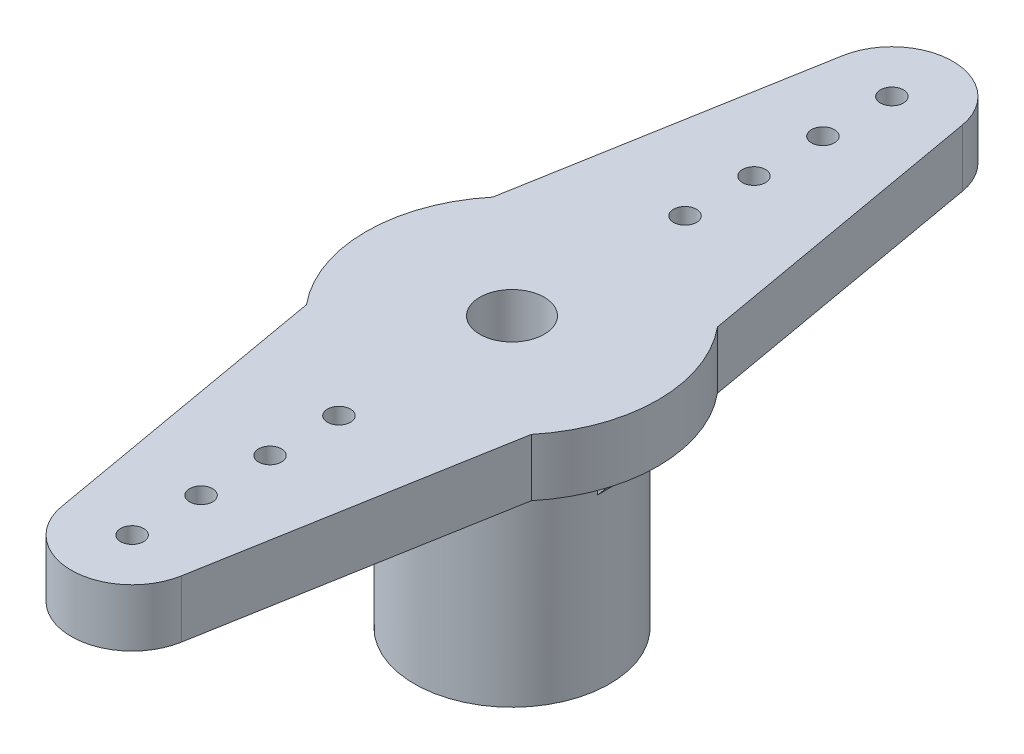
ISO-10303-21;
HEADER;
FILE_DESCRIPTION(('STEP AP214'),'2;1');
FILE_NAME('part.step','',(''),(''),'','','');
FILE_SCHEMA(('AUTOMOTIVE_DESIGN { 1 0 10303 214 1 1 1 1 }'));
ENDSEC;
DATA;
#1=APPLICATION_CONTEXT('core data for automotive mechanical design processes');
#2=APPLICATION_PROTOCOL_DEFINITION('international standard','automotive_design',2000,#1);
#3=PRODUCT_CONTEXT('',#1,'mechanical');
#4=PRODUCT('Part','Part','',(#3));
#5=PRODUCT_RELATED_PRODUCT_CATEGORY('part','',(#4));
#6=PRODUCT_DEFINITION_FORMATION('','',#4);
#7=PRODUCT_DEFINITION_CONTEXT('part definition',#1,'design');
#8=PRODUCT_DEFINITION('design','',#6,#7);
#9=PRODUCT_DEFINITION_SHAPE('','',#8);
#10=(LENGTH_UNIT() NAMED_UNIT(*) SI_UNIT(.MILLI.,.METRE.));
#11=(NAMED_UNIT(*) PLANE_ANGLE_UNIT() SI_UNIT($,.RADIAN.));
#12=(NAMED_UNIT(*) SI_UNIT($,.STERADIAN.) SOLID_ANGLE_UNIT());
#13=UNCERTAINTY_MEASURE_WITH_UNIT(LENGTH_MEASURE(1.E-05),#10,'distance_accuracy_value','');
#14=(GEOMETRIC_REPRESENTATION_CONTEXT(3) GLOBAL_UNCERTAINTY_ASSIGNED_CONTEXT((#13)) GLOBAL_UNIT_ASSIGNED_CONTEXT((#10,
#11,#12)) REPRESENTATION_CONTEXT('',''));
#15=CARTESIAN_POINT('',(0.,0.,0.));
#16=DIRECTION('',(0.,0.,1.));
#17=DIRECTION('',(1.,0.,0.));
#18=AXIS2_PLACEMENT_3D('',#15,#16,#17);
#19=CARTESIAN_POINT('',(0.,11.75,0.));
#20=DIRECTION('',(0.,-1.,0.));
#21=DIRECTION('',(0.,0.,-1.));
#22=AXIS2_PLACEMENT_3D('',#19,#20,#21);
#23=CYLINDRICAL_SURFACE('',#22,6.35);
#24=DIRECTION('',(0.,1.,0.));
#25=VECTOR('',#24,1.);
#26=CARTESIAN_POINT('',(4.89161268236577,9.25,4.04902770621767));
#27=LINE('',#26,#25);
#28=CARTESIAN_POINT('',(4.89161268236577,9.25,4.04902770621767));
#29=VERTEX_POINT('',#28);
#30=CARTESIAN_POINT('',(4.89161268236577,11.75,4.04902770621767));
#31=VERTEX_POINT('',#30);
#32=EDGE_CURVE('E1249',#29,#31,#27,.T.);
#33=ORIENTED_EDGE('',*,*,#32,.F.);
#34=CARTESIAN_POINT('',(0.,9.25,0.));
#35=DIRECTION('',(0.,1.,0.));
#36=DIRECTION('',(0.,0.,1.));
#37=AXIS2_PLACEMENT_3D('',#34,#35,#36);
#38=CIRCLE('',#37,6.35);
#39=CARTESIAN_POINT('',(4.89161268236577,9.25,-4.04902770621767));
#40=VERTEX_POINT('',#39);
#41=EDGE_CURVE('E694',#40,#29,#38,.F.);
#42=ORIENTED_EDGE('',*,*,#41,.F.);
#43=DIRECTION('',(0.,1.,0.));
#44=VECTOR('',#43,1.);
#45=CARTESIAN_POINT('',(4.89161268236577,9.25,-4.04902770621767));
#46=LINE('',#45,#44);
#47=CARTESIAN_POINT('',(4.89161268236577,11.75,-4.04902770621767));
#48=VERTEX_POINT('',#47);
#49=EDGE_CURVE('E1293',#40,#48,#46,.T.);
#50=ORIENTED_EDGE('',*,*,#49,.T.);
#51=CARTESIAN_POINT('',(0.,11.75,0.));
#52=DIRECTION('',(0.,1.,0.));
#53=DIRECTION('',(0.,0.,1.));
#54=AXIS2_PLACEMENT_3D('',#51,#52,#53);
#55=CIRCLE('',#54,6.35);
#56=EDGE_CURVE('E1292',#31,#48,#55,.T.);
#57=ORIENTED_EDGE('',*,*,#56,.F.);
#58=EDGE_LOOP('',(#33,#42,#50,#57));
#59=FACE_BOUND('',#58,.T.);
#60=ADVANCED_FACE('F33',(#59),#23,.T.);
#61=CARTESIAN_POINT('',(0.,0.,0.));
#62=DIRECTION('',(0.,1.,0.));
#63=DIRECTION('',(0.,0.,1.));
#64=AXIS2_PLACEMENT_3D('',#61,#62,#63);
#65=PLANE('',#64);
#66=DIRECTION('',(-0.64278760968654,0.,0.766044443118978));
#67=VECTOR('',#66,1.);
#68=CARTESIAN_POINT('',(0.,0.,2.9));
#69=LINE('',#68,#67);
#70=CARTESIAN_POINT('',(0.26291261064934,0.,2.58667295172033));
#71=VERTEX_POINT('',#70);
#72=CARTESIAN_POINT('',(0.,0.,2.9));
#73=VERTEX_POINT('',#72);
#74=EDGE_CURVE('E1187',#71,#73,#69,.T.);
#75=ORIENTED_EDGE('',*,*,#74,.F.);
#76=CARTESIAN_POINT('',(0.,0.,0.));
#77=DIRECTION('',(0.,-1.,0.));
#78=DIRECTION('',(0.,0.,-1.));
#79=AXIS2_PLACEMENT_3D('',#76,#77,#78);
#80=CIRCLE('',#79,2.6);
#81=CARTESIAN_POINT('',(0.363758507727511,0.,2.57442804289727));
#82=VERTEX_POINT('',#81);
#83=EDGE_CURVE('E2508',#82,#71,#80,.T.);
#84=ORIENTED_EDGE('',*,*,#83,.F.);
#85=DIRECTION('',(-0.807435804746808,0.,-0.589955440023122));
#86=VECTOR('',#85,1.);
#87=CARTESIAN_POINT('',(0.694015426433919,0.,2.81573127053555));
#88=LINE('',#87,#86);
#89=CARTESIAN_POINT('',(0.694015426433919,0.,2.81573127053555));
#90=VERTEX_POINT('',#89);
#91=EDGE_CURVE('E1177',#90,#82,#88,.T.);
#92=ORIENTED_EDGE('',*,*,#91,.F.);
#93=DIRECTION('',(-0.440782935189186,0.,0.897613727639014));
#94=VECTOR('',#93,1.);
#95=CARTESIAN_POINT('',(0.694015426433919,0.,2.81573127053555));
#96=LINE('',#95,#94);
#97=CARTESIAN_POINT('',(0.874304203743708,0.,2.44858983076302));
#98=VERTEX_POINT('',#97);
#99=EDGE_CURVE('E1168',#98,#90,#96,.T.);
#100=ORIENTED_EDGE('',*,*,#99,.F.);
#101=CARTESIAN_POINT('',(0.969289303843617,0.,2.41256673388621));
#102=VERTEX_POINT('',#101);
#103=EDGE_CURVE('E2695',#102,#98,#80,.T.);
#104=ORIENTED_EDGE('',*,*,#103,.F.);
#105=DIRECTION('',(-0.925158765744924,0.,-0.379580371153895));
#106=VECTOR('',#105,1.);
#107=CARTESIAN_POINT('',(1.34769719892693,0.,2.56782247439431));
#108=LINE('',#107,#106);
#109=CARTESIAN_POINT('',(1.34769719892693,0.,2.56782247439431));
#110=VERTEX_POINT('',#109);
#111=EDGE_CURVE('E1158',#110,#102,#108,.T.);
#112=ORIENTED_EDGE('',*,*,#111,.F.);
#113=DIRECTION('',(-0.213161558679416,0.,0.977016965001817));
#114=VECTOR('',#113,1.);
#115=CARTESIAN_POINT('',(1.34769719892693,0.,2.56782247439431));
#116=LINE('',#115,#114);
#117=CARTESIAN_POINT('',(1.43488441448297,0.,2.16820356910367));
#118=VERTEX_POINT('',#117);
#119=EDGE_CURVE('E1149',#118,#110,#116,.T.);
#120=ORIENTED_EDGE('',*,*,#119,.F.);
#121=CARTESIAN_POINT('',(1.5184885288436,0.,2.11049581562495));
#122=VERTEX_POINT('',#121);
#123=EDGE_CURVE('E2696',#122,#118,#80,.T.);
#124=ORIENTED_EDGE('',*,*,#123,.F.);
#125=DIRECTION('',(-0.989114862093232,0.,-0.147145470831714));
#126=VECTOR('',#125,1.);
#127=CARTESIAN_POINT('',(1.92305570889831,0.,2.17068116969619));
#128=LINE('',#127,#126);
#129=CARTESIAN_POINT('',(1.92305570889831,0.,2.17068116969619));
#130=VERTEX_POINT('',#129);
#131=EDGE_CURVE('E1139',#130,#122,#128,.T.);
#132=ORIENTED_EDGE('',*,*,#131,.F.);
#133=DIRECTION('',(0.0268479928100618,0.,0.999639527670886));
#134=VECTOR('',#133,1.);
#135=CARTESIAN_POINT('',(1.92305570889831,0.,2.17068116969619));
#136=LINE('',#135,#134);
#137=CARTESIAN_POINT('',(1.9120743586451,0.,1.76180919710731));
#138=VERTEX_POINT('',#137);
#139=EDGE_CURVE('E1130',#138,#130,#136,.T.);
#140=ORIENTED_EDGE('',*,*,#139,.F.);
#141=CARTESIAN_POINT('',(1.97943872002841,0.,1.68577055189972));
#142=VERTEX_POINT('',#141);
#143=EDGE_CURVE('E2698',#142,#138,#80,.T.);
#144=ORIENTED_EDGE('',*,*,#143,.F.);
#145=DIRECTION('',(-0.995587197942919,0.,0.0938409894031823));
#146=VECTOR('',#145,1.);
#147=CARTESIAN_POINT('',(2.38665321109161,0.,1.64738776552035));
#148=LINE('',#147,#146);
#149=CARTESIAN_POINT('',(2.38665321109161,0.,1.64738776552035));
#150=VERTEX_POINT('',#149);
#151=EDGE_CURVE('E1120',#150,#142,#148,.T.);
#152=ORIENTED_EDGE('',*,*,#151,.F.);
#153=DIRECTION('',(0.265297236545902,0.,0.964166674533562));
#154=VECTOR('',#153,1.);
#155=CARTESIAN_POINT('',(2.38665321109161,0.,1.64738776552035));
#156=LINE('',#155,#154);
#157=CARTESIAN_POINT('',(2.2781414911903,0.,1.25302487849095));
#158=VERTEX_POINT('',#157);
#159=EDGE_CURVE('E1111',#158,#150,#156,.T.);
#160=ORIENTED_EDGE('',*,*,#159,.F.);
#161=CARTESIAN_POINT('',(2.32535112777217,0.,1.16307443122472));
#162=VERTEX_POINT('',#161);
#163=EDGE_CURVE('E2700',#162,#158,#80,.T.);
#164=ORIENTED_EDGE('',*,*,#163,.F.);
#165=DIRECTION('',(-0.944199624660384,0.,0.329373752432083));
#166=VECTOR('',#165,1.);
#167=CARTESIAN_POINT('',(2.71154710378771,0.,1.02835417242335));
#168=LINE('',#167,#166);
#169=CARTESIAN_POINT('',(2.71154710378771,0.,1.02835417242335));
#170=VERTEX_POINT('',#169);
#171=EDGE_CURVE('E1101',#170,#162,#168,.T.);
#172=ORIENTED_EDGE('',*,*,#171,.F.);
#173=DIRECTION('',(0.488328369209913,0.,0.872659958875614));
#174=VECTOR('',#173,1.);
#175=CARTESIAN_POINT('',(2.71154710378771,0.,1.02835417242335));
#176=LINE('',#175,#174);
#177=CARTESIAN_POINT('',(2.5118113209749,0.,0.671419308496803));
#178=VERTEX_POINT('',#177);
#179=EDGE_CURVE('E1092',#178,#170,#176,.T.);
#180=ORIENTED_EDGE('',*,*,#179,.F.);
#181=CARTESIAN_POINT('',(2.53612258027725,0.,0.572784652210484));
#182=VERTEX_POINT('',#181);
#183=EDGE_CURVE('E2702',#182,#178,#80,.T.);
#184=ORIENTED_EDGE('',*,*,#183,.F.);
#185=DIRECTION('',(-0.837938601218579,0.,0.545764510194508));
#186=VECTOR('',#185,1.);
#187=CARTESIAN_POINT('',(2.87885573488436,0.,0.349556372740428));
#188=LINE('',#187,#186);
#189=CARTESIAN_POINT('',(2.87885573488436,0.,0.349556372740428));
#190=VERTEX_POINT('',#189);
#191=EDGE_CURVE('E1082',#190,#182,#188,.T.);
#192=ORIENTED_EDGE('',*,*,#191,.F.);
#193=DIRECTION('',(0.682979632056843,0.,0.730437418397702));
#194=VECTOR('',#193,1.);
#195=CARTESIAN_POINT('',(2.87885573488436,0.,0.349556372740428));
#196=LINE('',#195,#194);
#197=CARTESIAN_POINT('',(2.59950380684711,0.,0.0507932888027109));
#198=VERTEX_POINT('',#197);
#199=EDGE_CURVE('E1073',#198,#190,#196,.T.);
#200=ORIENTED_EDGE('',*,*,#199,.F.);
#201=CARTESIAN_POINT('',(2.59950380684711,0.,-0.0507932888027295));
#202=VERTEX_POINT('',#201);
#203=EDGE_CURVE('E2704',#202,#198,#80,.T.);
#204=ORIENTED_EDGE('',*,*,#203,.F.);
#205=DIRECTION('',(-0.682979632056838,0.,0.730437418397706));
#206=VECTOR('',#205,1.);
#207=CARTESIAN_POINT('',(2.87885573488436,0.,-0.349556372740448));
#208=LINE('',#207,#206);
#209=CARTESIAN_POINT('',(2.87885573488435,0.,-0.349556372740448));
#210=VERTEX_POINT('',#209);
#211=EDGE_CURVE('E1063',#210,#202,#208,.T.);
#212=ORIENTED_EDGE('',*,*,#211,.F.);
#213=DIRECTION('',(0.837938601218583,0.,0.545764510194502));
#214=VECTOR('',#213,1.);
#215=CARTESIAN_POINT('',(2.87885573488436,0.,-0.349556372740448));
#216=LINE('',#215,#214);
#217=CARTESIAN_POINT('',(2.53612258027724,0.,-0.572784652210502));
#218=VERTEX_POINT('',#217);
#219=EDGE_CURVE('E1054',#218,#210,#216,.T.);
#220=ORIENTED_EDGE('',*,*,#219,.F.);
#221=CARTESIAN_POINT('',(2.5118113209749,0.,-0.67141930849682));
#222=VERTEX_POINT('',#221);
#223=EDGE_CURVE('E2706',#222,#218,#80,.T.);
#224=ORIENTED_EDGE('',*,*,#223,.F.);
#225=DIRECTION('',(-0.488328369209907,0.,0.872659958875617));
#226=VECTOR('',#225,1.);
#227=CARTESIAN_POINT('',(2.7115471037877,0.,-1.02835417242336));
#228=LINE('',#227,#226);
#229=CARTESIAN_POINT('',(2.7115471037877,0.,-1.02835417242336));
#230=VERTEX_POINT('',#229);
#231=EDGE_CURVE('E1044',#230,#222,#228,.T.);
#232=ORIENTED_EDGE('',*,*,#231,.F.);
#233=DIRECTION('',(0.944199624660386,0.,0.329373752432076));
#234=VECTOR('',#233,1.);
#235=CARTESIAN_POINT('',(2.7115471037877,0.,-1.02835417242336));
#236=LINE('',#235,#234);
#237=CARTESIAN_POINT('',(2.32535112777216,0.,-1.16307443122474));
#238=VERTEX_POINT('',#237);
#239=EDGE_CURVE('E1035',#238,#230,#236,.T.);
#240=ORIENTED_EDGE('',*,*,#239,.F.);
#241=CARTESIAN_POINT('',(2.27814149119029,0.,-1.25302487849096));
#242=VERTEX_POINT('',#241);
#243=EDGE_CURVE('E2708',#242,#238,#80,.T.);
#244=ORIENTED_EDGE('',*,*,#243,.F.);
#245=DIRECTION('',(-0.265297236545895,0.,0.964166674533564));
#246=VECTOR('',#245,1.);
#247=CARTESIAN_POINT('',(2.3866532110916,0.,-1.64738776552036));
#248=LINE('',#247,#246);
#249=CARTESIAN_POINT('',(2.3866532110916,0.,-1.64738776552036));
#250=VERTEX_POINT('',#249);
#251=EDGE_CURVE('E1025',#250,#242,#248,.T.);
#252=ORIENTED_EDGE('',*,*,#251,.F.);
#253=DIRECTION('',(0.995587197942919,0.,0.0938409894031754));
#254=VECTOR('',#253,1.);
#255=CARTESIAN_POINT('',(2.3866532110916,0.,-1.64738776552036));
#256=LINE('',#255,#254);
#257=CARTESIAN_POINT('',(1.9794387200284,0.,-1.68577055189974));
#258=VERTEX_POINT('',#257);
#259=EDGE_CURVE('E1016',#258,#250,#256,.T.);
#260=ORIENTED_EDGE('',*,*,#259,.F.);
#261=CARTESIAN_POINT('',(1.91207435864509,0.,-1.76180919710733));
#262=VERTEX_POINT('',#261);
#263=EDGE_CURVE('E2710',#262,#258,#80,.T.);
#264=ORIENTED_EDGE('',*,*,#263,.F.);
#265=DIRECTION('',(-0.0268479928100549,0.,0.999639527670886));
#266=VECTOR('',#265,1.);
#267=CARTESIAN_POINT('',(1.92305570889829,0.,-2.1706811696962));
#268=LINE('',#267,#266);
#269=CARTESIAN_POINT('',(1.92305570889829,0.,-2.1706811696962));
#270=VERTEX_POINT('',#269);
#271=EDGE_CURVE('E1006',#270,#262,#268,.T.);
#272=ORIENTED_EDGE('',*,*,#271,.F.);
#273=DIRECTION('',(0.989114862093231,0.,-0.147145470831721));
#274=VECTOR('',#273,1.);
#275=CARTESIAN_POINT('',(1.92305570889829,0.,-2.1706811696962));
#276=LINE('',#275,#274);
#277=CARTESIAN_POINT('',(1.51848852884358,0.,-2.11049581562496));
#278=VERTEX_POINT('',#277);
#279=EDGE_CURVE('E997',#278,#270,#276,.T.);
#280=ORIENTED_EDGE('',*,*,#279,.F.);
#281=CARTESIAN_POINT('',(1.43488441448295,0.,-2.16820356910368));
#282=VERTEX_POINT('',#281);
#283=EDGE_CURVE('E2712',#282,#278,#80,.T.);
#284=ORIENTED_EDGE('',*,*,#283,.F.);
#285=DIRECTION('',(0.213161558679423,0.,0.977016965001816));
#286=VECTOR('',#285,1.);
#287=CARTESIAN_POINT('',(1.34769719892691,0.,-2.56782247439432));
#288=LINE('',#287,#286);
#289=CARTESIAN_POINT('',(1.34769719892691,0.,-2.56782247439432));
#290=VERTEX_POINT('',#289);
#291=EDGE_CURVE('E987',#290,#282,#288,.T.);
#292=ORIENTED_EDGE('',*,*,#291,.F.);
#293=DIRECTION('',(0.925158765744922,0.,-0.379580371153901));
#294=VECTOR('',#293,1.);
#295=CARTESIAN_POINT('',(1.34769719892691,0.,-2.56782247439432));
#296=LINE('',#295,#294);
#297=CARTESIAN_POINT('',(0.969289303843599,0.,-2.41256673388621));
#298=VERTEX_POINT('',#297);
#299=EDGE_CURVE('E978',#298,#290,#296,.T.);
#300=ORIENTED_EDGE('',*,*,#299,.F.);
#301=CARTESIAN_POINT('',(0.874304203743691,0.,-2.44858983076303));
#302=VERTEX_POINT('',#301);
#303=EDGE_CURVE('E713',#302,#298,#80,.T.);
#304=ORIENTED_EDGE('',*,*,#303,.F.);
#305=DIRECTION('',(0.440782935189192,0.,0.897613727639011));
#306=VECTOR('',#305,1.);
#307=CARTESIAN_POINT('',(0.6940154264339,0.,-2.81573127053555));
#308=LINE('',#307,#306);
#309=CARTESIAN_POINT('',(0.6940154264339,0.,-2.81573127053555));
#310=VERTEX_POINT('',#309);
#311=EDGE_CURVE('E968',#310,#302,#308,.T.);
#312=ORIENTED_EDGE('',*,*,#311,.F.);
#313=DIRECTION('',(0.807435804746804,0.,-0.589955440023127));
#314=VECTOR('',#313,1.);
#315=CARTESIAN_POINT('',(0.6940154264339,0.,-2.81573127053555));
#316=LINE('',#315,#314);
#317=CARTESIAN_POINT('',(0.363758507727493,0.,-2.57442804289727));
#318=VERTEX_POINT('',#317);
#319=EDGE_CURVE('E959',#318,#310,#316,.T.);
#320=ORIENTED_EDGE('',*,*,#319,.F.);
#321=CARTESIAN_POINT('',(0.26291261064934,0.,-2.58667295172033));
#322=VERTEX_POINT('',#321);
#323=EDGE_CURVE('E711',#322,#318,#80,.T.);
#324=ORIENTED_EDGE('',*,*,#323,.F.);
#325=DIRECTION('',(0.64278760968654,0.,0.766044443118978));
#326=VECTOR('',#325,1.);
#327=CARTESIAN_POINT('',(0.,0.,-2.9));
#328=LINE('',#327,#326);
#329=CARTESIAN_POINT('',(0.,0.,-2.9));
#330=VERTEX_POINT('',#329);
#331=EDGE_CURVE('E949',#330,#322,#328,.T.);
#332=ORIENTED_EDGE('',*,*,#331,.F.);
#333=DIRECTION('',(0.64278760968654,0.,-0.766044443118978));
#334=VECTOR('',#333,1.);
#335=CARTESIAN_POINT('',(0.,0.,-2.9));
#336=LINE('',#335,#334);
#337=CARTESIAN_POINT('',(-0.26291261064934,0.,-2.58667295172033));
#338=VERTEX_POINT('',#337);
#339=EDGE_CURVE('E940',#338,#330,#336,.T.);
#340=ORIENTED_EDGE('',*,*,#339,.F.);
#341=CARTESIAN_POINT('',(-0.363758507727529,0.,-2.57442804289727));
#342=VERTEX_POINT('',#341);
#343=EDGE_CURVE('E702',#342,#338,#80,.T.);
#344=ORIENTED_EDGE('',*,*,#343,.F.);
#345=DIRECTION('',(0.807435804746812,0.,0.589955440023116));
#346=VECTOR('',#345,1.);
#347=CARTESIAN_POINT('',(-0.694015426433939,0.,-2.81573127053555));
#348=LINE('',#347,#346);
#349=CARTESIAN_POINT('',(-0.694015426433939,0.,-2.81573127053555));
#350=VERTEX_POINT('',#349);
#351=EDGE_CURVE('E930',#350,#342,#348,.T.);
#352=ORIENTED_EDGE('',*,*,#351,.F.);
#353=DIRECTION('',(0.44078293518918,0.,-0.897613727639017));
#354=VECTOR('',#353,1.);
#355=CARTESIAN_POINT('',(-0.694015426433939,0.,-2.81573127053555));
#356=LINE('',#355,#354);
#357=CARTESIAN_POINT('',(-0.874304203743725,0.,-2.44858983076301));
#358=VERTEX_POINT('',#357);
#359=EDGE_CURVE('E921',#358,#350,#356,.T.);
#360=ORIENTED_EDGE('',*,*,#359,.F.);
#361=CARTESIAN_POINT('',(-0.969289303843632,0.,-2.4125667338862));
#362=VERTEX_POINT('',#361);
#363=EDGE_CURVE('E2525',#362,#358,#80,.T.);
#364=ORIENTED_EDGE('',*,*,#363,.F.);
#365=DIRECTION('',(0.925158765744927,0.,0.379580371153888));
#366=VECTOR('',#365,1.);
#367=CARTESIAN_POINT('',(-1.34769719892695,0.,-2.5678224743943));
#368=LINE('',#367,#366);
#369=CARTESIAN_POINT('',(-1.34769719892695,0.,-2.5678224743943));
#370=VERTEX_POINT('',#369);
#371=EDGE_CURVE('E911',#370,#362,#368,.T.);
#372=ORIENTED_EDGE('',*,*,#371,.F.);
#373=DIRECTION('',(0.213161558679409,0.,-0.977016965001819));
#374=VECTOR('',#373,1.);
#375=CARTESIAN_POINT('',(-1.34769719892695,0.,-2.5678224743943));
#376=LINE('',#375,#374);
#377=CARTESIAN_POINT('',(-1.43488441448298,0.,-2.16820356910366));
#378=VERTEX_POINT('',#377);
#379=EDGE_CURVE('E902',#378,#370,#376,.T.);
#380=ORIENTED_EDGE('',*,*,#379,.F.);
#381=CARTESIAN_POINT('',(-1.51848852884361,0.,-2.11049581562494));
#382=VERTEX_POINT('',#381);
#383=EDGE_CURVE('E2523',#382,#378,#80,.T.);
#384=ORIENTED_EDGE('',*,*,#383,.F.);
#385=DIRECTION('',(0.989114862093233,0.,0.147145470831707));
#386=VECTOR('',#385,1.);
#387=CARTESIAN_POINT('',(-1.92305570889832,0.,-2.17068116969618));
#388=LINE('',#387,#386);
#389=CARTESIAN_POINT('',(-1.92305570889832,0.,-2.17068116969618));
#390=VERTEX_POINT('',#389);
#391=EDGE_CURVE('E892',#390,#382,#388,.T.);
#392=ORIENTED_EDGE('',*,*,#391,.F.);
#393=DIRECTION('',(-0.0268479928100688,0.,-0.999639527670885));
#394=VECTOR('',#393,1.);
#395=CARTESIAN_POINT('',(-1.92305570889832,0.,-2.17068116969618));
#396=LINE('',#395,#394);
#397=CARTESIAN_POINT('',(-1.91207435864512,0.,-1.7618091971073));
#398=VERTEX_POINT('',#397);
#399=EDGE_CURVE('E883',#398,#390,#396,.T.);
#400=ORIENTED_EDGE('',*,*,#399,.F.);
#401=CARTESIAN_POINT('',(-1.97943872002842,0.,-1.68577055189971));
#402=VERTEX_POINT('',#401);
#403=EDGE_CURVE('E2521',#402,#398,#80,.T.);
#404=ORIENTED_EDGE('',*,*,#403,.F.);
#405=DIRECTION('',(0.995587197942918,0.,-0.0938409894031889));
#406=VECTOR('',#405,1.);
#407=CARTESIAN_POINT('',(-2.38665321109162,0.,-1.64738776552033));
#408=LINE('',#407,#406);
#409=CARTESIAN_POINT('',(-2.38665321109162,0.,-1.64738776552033));
#410=VERTEX_POINT('',#409);
#411=EDGE_CURVE('E873',#410,#402,#408,.T.);
#412=ORIENTED_EDGE('',*,*,#411,.F.);
#413=DIRECTION('',(-0.265297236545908,0.,-0.96416667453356));
#414=VECTOR('',#413,1.);
#415=CARTESIAN_POINT('',(-2.38665321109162,0.,-1.64738776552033));
#416=LINE('',#415,#414);
#417=CARTESIAN_POINT('',(-2.27814149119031,0.,-1.25302487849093));
#418=VERTEX_POINT('',#417);
#419=EDGE_CURVE('E864',#418,#410,#416,.T.);
#420=ORIENTED_EDGE('',*,*,#419,.F.);
#421=CARTESIAN_POINT('',(-2.32535112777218,0.,-1.16307443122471));
#422=VERTEX_POINT('',#421);
#423=EDGE_CURVE('E2519',#422,#418,#80,.T.);
#424=ORIENTED_EDGE('',*,*,#423,.F.);
#425=DIRECTION('',(0.944199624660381,0.,-0.329373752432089));
#426=VECTOR('',#425,1.);
#427=CARTESIAN_POINT('',(-2.71154710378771,0.,-1.02835417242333));
#428=LINE('',#427,#426);
#429=CARTESIAN_POINT('',(-2.71154710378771,0.,-1.02835417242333));
#430=VERTEX_POINT('',#429);
#431=EDGE_CURVE('E854',#430,#422,#428,.T.);
#432=ORIENTED_EDGE('',*,*,#431,.F.);
#433=DIRECTION('',(-0.488328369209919,0.,-0.87265995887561));
#434=VECTOR('',#433,1.);
#435=CARTESIAN_POINT('',(-2.71154710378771,0.,-1.02835417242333));
#436=LINE('',#435,#434);
#437=CARTESIAN_POINT('',(-2.51181132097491,0.,-0.671419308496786));
#438=VERTEX_POINT('',#437);
#439=EDGE_CURVE('E845',#438,#430,#436,.T.);
#440=ORIENTED_EDGE('',*,*,#439,.F.);
#441=CARTESIAN_POINT('',(-2.53612258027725,0.,-0.572784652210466));
#442=VERTEX_POINT('',#441);
#443=EDGE_CURVE('E2517',#442,#438,#80,.T.);
#444=ORIENTED_EDGE('',*,*,#443,.F.);
#445=DIRECTION('',(0.837938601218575,0.,-0.545764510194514));
#446=VECTOR('',#445,1.);
#447=CARTESIAN_POINT('',(-2.87885573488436,0.,-0.349556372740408));
#448=LINE('',#447,#446);
#449=CARTESIAN_POINT('',(-2.87885573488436,0.,-0.349556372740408));
#450=VERTEX_POINT('',#449);
#451=EDGE_CURVE('E835',#450,#442,#448,.T.);
#452=ORIENTED_EDGE('',*,*,#451,.F.);
#453=DIRECTION('',(-0.682979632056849,0.,-0.730437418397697));
#454=VECTOR('',#453,1.);
#455=CARTESIAN_POINT('',(-2.87885573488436,0.,-0.349556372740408));
#456=LINE('',#455,#454);
#457=CARTESIAN_POINT('',(-2.59950380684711,0.,-0.0507932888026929));
#458=VERTEX_POINT('',#457);
#459=EDGE_CURVE('E826',#458,#450,#456,.T.);
#460=ORIENTED_EDGE('',*,*,#459,.F.);
#461=CARTESIAN_POINT('',(-2.59950380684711,0.,0.0507932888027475));
#462=VERTEX_POINT('',#461);
#463=EDGE_CURVE('E2515',#462,#458,#80,.T.);
#464=ORIENTED_EDGE('',*,*,#463,.F.);
#465=DIRECTION('',(0.682979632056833,0.,-0.730437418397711));
#466=VECTOR('',#465,1.);
#467=CARTESIAN_POINT('',(-2.87885573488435,0.,0.349556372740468));
#468=LINE('',#467,#466);
#469=CARTESIAN_POINT('',(-2.87885573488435,0.,0.349556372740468));
#470=VERTEX_POINT('',#469);
#471=EDGE_CURVE('E816',#470,#462,#468,.T.);
#472=ORIENTED_EDGE('',*,*,#471,.F.);
#473=DIRECTION('',(-0.837938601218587,0.,-0.545764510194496));
#474=VECTOR('',#473,1.);
#475=CARTESIAN_POINT('',(-2.87885573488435,0.,0.349556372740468));
#476=LINE('',#475,#474);
#477=CARTESIAN_POINT('',(-2.53612258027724,0.,0.57278465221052));
#478=VERTEX_POINT('',#477);
#479=EDGE_CURVE('E807',#478,#470,#476,.T.);
#480=ORIENTED_EDGE('',*,*,#479,.F.);
#481=CARTESIAN_POINT('',(-2.51181132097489,0.,0.671419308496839));
#482=VERTEX_POINT('',#481);
#483=EDGE_CURVE('E2513',#482,#478,#80,.T.);
#484=ORIENTED_EDGE('',*,*,#483,.F.);
#485=DIRECTION('',(0.4883283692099,0.,-0.87265995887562));
#486=VECTOR('',#485,1.);
#487=CARTESIAN_POINT('',(-2.71154710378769,0.,1.02835417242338));
#488=LINE('',#487,#486);
#489=CARTESIAN_POINT('',(-2.71154710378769,0.,1.02835417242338));
#490=VERTEX_POINT('',#489);
#491=EDGE_CURVE('E797',#490,#482,#488,.T.);
#492=ORIENTED_EDGE('',*,*,#491,.F.);
#493=DIRECTION('',(-0.944199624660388,0.,-0.32937375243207));
#494=VECTOR('',#493,1.);
#495=CARTESIAN_POINT('',(-2.71154710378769,0.,1.02835417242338));
#496=LINE('',#495,#494);
#497=CARTESIAN_POINT('',(-2.32535112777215,0.,1.16307443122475));
#498=VERTEX_POINT('',#497);
#499=EDGE_CURVE('E788',#498,#490,#496,.T.);
#500=ORIENTED_EDGE('',*,*,#499,.F.);
#501=CARTESIAN_POINT('',(-2.27814149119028,0.,1.25302487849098));
#502=VERTEX_POINT('',#501);
#503=EDGE_CURVE('E2511',#502,#498,#80,.T.);
#504=ORIENTED_EDGE('',*,*,#503,.F.);
#505=DIRECTION('',(0.265297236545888,0.,-0.964166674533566));
#506=VECTOR('',#505,1.);
#507=CARTESIAN_POINT('',(-2.38665321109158,0.,1.64738776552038));
#508=LINE('',#507,#506);
#509=CARTESIAN_POINT('',(-2.38665321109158,0.,1.64738776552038));
#510=VERTEX_POINT('',#509);
#511=EDGE_CURVE('E778',#510,#502,#508,.T.);
#512=ORIENTED_EDGE('',*,*,#511,.F.);
#513=DIRECTION('',(-0.99558719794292,0.,-0.093840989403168));
#514=VECTOR('',#513,1.);
#515=CARTESIAN_POINT('',(-2.38665321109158,0.,1.64738776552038));
#516=LINE('',#515,#514);
#517=CARTESIAN_POINT('',(-1.97943872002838,0.,1.68577055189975));
#518=VERTEX_POINT('',#517);
#519=EDGE_CURVE('E769',#518,#510,#516,.T.);
#520=ORIENTED_EDGE('',*,*,#519,.F.);
#521=CARTESIAN_POINT('',(-1.91207435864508,0.,1.76180919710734));
#522=VERTEX_POINT('',#521);
#523=EDGE_CURVE('E2509',#522,#518,#80,.T.);
#524=ORIENTED_EDGE('',*,*,#523,.F.);
#525=DIRECTION('',(0.0268479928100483,0.,-0.999639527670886));
#526=VECTOR('',#525,1.);
#527=CARTESIAN_POINT('',(-1.92305570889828,0.,2.17068116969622));
#528=LINE('',#527,#526);
#529=CARTESIAN_POINT('',(-1.92305570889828,0.,2.17068116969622));
#530=VERTEX_POINT('',#529);
#531=EDGE_CURVE('E759',#530,#522,#528,.T.);
#532=ORIENTED_EDGE('',*,*,#531,.F.);
#533=DIRECTION('',(-0.98911486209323,0.,0.147145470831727));
#534=VECTOR('',#533,1.);
#535=CARTESIAN_POINT('',(-1.92305570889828,0.,2.17068116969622));
#536=LINE('',#535,#534);
#537=CARTESIAN_POINT('',(-1.51848852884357,0.,2.11049581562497));
#538=VERTEX_POINT('',#537);
#539=EDGE_CURVE('E750',#538,#530,#536,.T.);
#540=ORIENTED_EDGE('',*,*,#539,.F.);
#541=CARTESIAN_POINT('',(-1.43488441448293,0.,2.16820356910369));
#542=VERTEX_POINT('',#541);
#543=EDGE_CURVE('E2507',#542,#538,#80,.T.);
#544=ORIENTED_EDGE('',*,*,#543,.F.);
#545=DIRECTION('',(-0.213161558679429,0.,-0.977016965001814));
#546=VECTOR('',#545,1.);
#547=CARTESIAN_POINT('',(-1.3476971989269,0.,2.56782247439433));
#548=LINE('',#547,#546);
#549=CARTESIAN_POINT('',(-1.3476971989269,0.,2.56782247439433));
#550=VERTEX_POINT('',#549);
#551=EDGE_CURVE('E740',#550,#542,#548,.T.);
#552=ORIENTED_EDGE('',*,*,#551,.F.);
#553=DIRECTION('',(-0.925158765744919,0.,0.379580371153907));
#554=VECTOR('',#553,1.);
#555=CARTESIAN_POINT('',(-1.3476971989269,0.,2.56782247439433));
#556=LINE('',#555,#554);
#557=CARTESIAN_POINT('',(-0.969289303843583,0.,2.41256673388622));
#558=VERTEX_POINT('',#557);
#559=EDGE_CURVE('E731',#558,#550,#556,.T.);
#560=ORIENTED_EDGE('',*,*,#559,.F.);
#561=CARTESIAN_POINT('',(-0.874304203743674,0.,2.44858983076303));
#562=VERTEX_POINT('',#561);
#563=EDGE_CURVE('E2504',#562,#558,#80,.T.);
#564=ORIENTED_EDGE('',*,*,#563,.F.);
#565=DIRECTION('',(-0.440782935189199,0.,-0.897613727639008));
#566=VECTOR('',#565,1.);
#567=CARTESIAN_POINT('',(-0.69401542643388,0.,2.81573127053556));
#568=LINE('',#567,#566);
#569=CARTESIAN_POINT('',(-0.69401542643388,0.,2.81573127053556));
#570=VERTEX_POINT('',#569);
#571=EDGE_CURVE('E721',#570,#562,#568,.T.);
#572=ORIENTED_EDGE('',*,*,#571,.F.);
#573=DIRECTION('',(-0.8074358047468,0.,0.589955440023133));
#574=VECTOR('',#573,1.);
#575=CARTESIAN_POINT('',(-0.69401542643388,0.,2.81573127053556));
#576=LINE('',#575,#574);
#577=CARTESIAN_POINT('',(-0.363758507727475,0.,2.57442804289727));
#578=VERTEX_POINT('',#577);
#579=EDGE_CURVE('E716',#578,#570,#576,.T.);
#580=ORIENTED_EDGE('',*,*,#579,.F.);
#581=CARTESIAN_POINT('',(-0.26291261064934,0.,2.58667295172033));
#582=VERTEX_POINT('',#581);
#583=EDGE_CURVE('E2506',#582,#578,#80,.T.);
#584=ORIENTED_EDGE('',*,*,#583,.F.);
#585=DIRECTION('',(-0.64278760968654,0.,-0.766044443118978));
#586=VECTOR('',#585,1.);
#587=CARTESIAN_POINT('',(0.,0.,2.9));
#588=LINE('',#587,#586);
#589=EDGE_CURVE('E1196',#73,#582,#588,.T.);
#590=ORIENTED_EDGE('',*,*,#589,.F.);
#591=EDGE_LOOP('',(#75,#84,#92,#100,#104,#112,#120,#124,#132,#140,#144,#152,#160,#164,#172,#180,
#184,#192,#200,#204,#212,#220,#224,#232,#240,#244,#252,#260,#264,#272,#280,#284,#292,#300,#304,
#312,#320,#324,#332,#340,#344,#352,#360,#364,#372,#380,#384,#392,#400,#404,#412,#420,#424,#432,
#440,#444,#452,#460,#464,#472,#480,#484,#492,#500,#504,#512,#520,#524,#532,#540,#544,#552,#560,
#564,#572,#580,#584,#590));
#592=FACE_BOUND('',#591,.T.);
#593=CARTESIAN_POINT('',(0.,0.,0.));
#594=DIRECTION('',(0.,-1.,0.));
#595=DIRECTION('',(0.,0.,-1.));
#596=AXIS2_PLACEMENT_3D('',#593,#594,#595);
#597=CIRCLE('',#596,4.25);
#598=CARTESIAN_POINT('',(0.,0.,-4.25));
#599=VERTEX_POINT('',#598);
#600=EDGE_CURVE('E695',#599,#599,#597,.T.);
#601=ORIENTED_EDGE('',*,*,#600,.T.);
#602=EDGE_LOOP('',(#601));
#603=FACE_BOUND('',#602,.T.);
#604=ADVANCED_FACE('F1398',(#592,#603),#65,.F.);
#605=CARTESIAN_POINT('',(0.,0.,0.));
#606=DIRECTION('',(0.,1.,0.));
#607=DIRECTION('',(0.,0.,1.));
#608=AXIS2_PLACEMENT_3D('',#605,#606,#607);
#609=CYLINDRICAL_SURFACE('',#608,1.4);
#610=CARTESIAN_POINT('',(0.,11.75,0.));
#611=DIRECTION('',(0.,-1.,0.));
#612=DIRECTION('',(0.,0.,-1.));
#613=AXIS2_PLACEMENT_3D('',#610,#611,#612);
#614=CIRCLE('',#613,1.4);
#615=CARTESIAN_POINT('',(0.,11.75,-1.4));
#616=VERTEX_POINT('',#615);
#617=EDGE_CURVE('E1269',#616,#616,#614,.T.);
#618=ORIENTED_EDGE('',*,*,#617,.F.);
#619=EDGE_LOOP('',(#618));
#620=FACE_BOUND('',#619,.T.);
#621=CARTESIAN_POINT('',(0.,3.,0.));
#622=DIRECTION('',(0.,-1.,0.));
#623=DIRECTION('',(0.,0.,-1.));
#624=AXIS2_PLACEMENT_3D('',#621,#622,#623);
#625=CIRCLE('',#624,1.4);
#626=CARTESIAN_POINT('',(0.,3.,-1.4));
#627=VERTEX_POINT('',#626);
#628=EDGE_CURVE('E708',#627,#627,#625,.T.);
#629=ORIENTED_EDGE('',*,*,#628,.T.);
#630=EDGE_LOOP('',(#629));
#631=FACE_BOUND('',#630,.T.);
#632=ADVANCED_FACE('F1403',(#620,#631),#609,.F.);
#633=DIRECTION('',(0.,1.,0.));
#634=VECTOR('',#633,1.);
#635=CARTESIAN_POINT('',(-4.89161268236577,9.25,-4.04902770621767));
#636=LINE('',#635,#634);
#637=CARTESIAN_POINT('',(-4.89161268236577,9.25,-4.04902770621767));
#638=VERTEX_POINT('',#637);
#639=CARTESIAN_POINT('',(-4.89161268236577,11.75,-4.04902770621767));
#640=VERTEX_POINT('',#639);
#641=EDGE_CURVE('E1296',#638,#640,#636,.T.);
#642=ORIENTED_EDGE('',*,*,#641,.F.);
#643=CARTESIAN_POINT('',(-4.89161268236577,9.25,4.04902770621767));
#644=VERTEX_POINT('',#643);
#645=EDGE_CURVE('E698',#644,#638,#38,.F.);
#646=ORIENTED_EDGE('',*,*,#645,.F.);
#647=DIRECTION('',(0.,1.,0.));
#648=VECTOR('',#647,1.);
#649=CARTESIAN_POINT('',(-4.89161268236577,9.25,4.04902770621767));
#650=LINE('',#649,#648);
#651=CARTESIAN_POINT('',(-4.89161268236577,11.75,4.04902770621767));
#652=VERTEX_POINT('',#651);
#653=EDGE_CURVE('E1246',#644,#652,#650,.T.);
#654=ORIENTED_EDGE('',*,*,#653,.T.);
#655=EDGE_CURVE('E1300',#640,#652,#55,.T.);
#656=ORIENTED_EDGE('',*,*,#655,.F.);
#657=EDGE_LOOP('',(#642,#646,#654,#656));
#658=FACE_BOUND('',#657,.T.);
#659=ADVANCED_FACE('F35',(#658),#23,.T.);
#660=CARTESIAN_POINT('',(0.,11.75,0.));
#661=DIRECTION('',(0.,1.,0.));
#662=DIRECTION('',(0.,0.,1.));
#663=AXIS2_PLACEMENT_3D('',#660,#661,#662);
#664=PLANE('',#663);
#665=CARTESIAN_POINT('',(0.,11.75,7.53));
#666=DIRECTION('',(0.,1.,0.));
#667=DIRECTION('',(0.,0.,1.));
#668=AXIS2_PLACEMENT_3D('',#665,#666,#667);
#669=CIRCLE('',#668,0.5);
#670=CARTESIAN_POINT('',(0.,11.75,8.03));
#671=VERTEX_POINT('',#670);
#672=EDGE_CURVE('E1206',#671,#671,#669,.T.);
#673=ORIENTED_EDGE('',*,*,#672,.F.);
#674=EDGE_LOOP('',(#673));
#675=FACE_BOUND('',#674,.T.);
#676=CARTESIAN_POINT('',(0.,11.75,10.53));
#677=DIRECTION('',(0.,1.,0.));
#678=DIRECTION('',(0.,0.,1.));
#679=AXIS2_PLACEMENT_3D('',#676,#677,#678);
#680=CIRCLE('',#679,0.5);
#681=CARTESIAN_POINT('',(0.,11.75,11.03));
#682=VERTEX_POINT('',#681);
#683=EDGE_CURVE('E1214',#682,#682,#680,.T.);
#684=ORIENTED_EDGE('',*,*,#683,.F.);
#685=EDGE_LOOP('',(#684));
#686=FACE_BOUND('',#685,.T.);
#687=CARTESIAN_POINT('',(0.,11.75,13.53));
#688=DIRECTION('',(0.,1.,0.));
#689=DIRECTION('',(0.,0.,1.));
#690=AXIS2_PLACEMENT_3D('',#687,#688,#689);
#691=CIRCLE('',#690,0.5);
#692=CARTESIAN_POINT('',(0.,11.75,14.03));
#693=VERTEX_POINT('',#692);
#694=EDGE_CURVE('E1218',#693,#693,#691,.T.);
#695=ORIENTED_EDGE('',*,*,#694,.F.);
#696=EDGE_LOOP('',(#695));
#697=FACE_BOUND('',#696,.T.);
#698=CARTESIAN_POINT('',(0.,11.75,16.53));
#699=DIRECTION('',(0.,1.,0.));
#700=DIRECTION('',(0.,0.,1.));
#701=AXIS2_PLACEMENT_3D('',#698,#699,#700);
#702=CIRCLE('',#701,0.5);
#703=CARTESIAN_POINT('',(0.,11.75,17.03));
#704=VERTEX_POINT('',#703);
#705=EDGE_CURVE('E1222',#704,#704,#702,.T.);
#706=ORIENTED_EDGE('',*,*,#705,.F.);
#707=EDGE_LOOP('',(#706));
#708=FACE_BOUND('',#707,.T.);
#709=CARTESIAN_POINT('',(0.,11.75,-7.53));
#710=DIRECTION('',(0.,-1.,0.));
#711=DIRECTION('',(0.,0.,-1.));
#712=AXIS2_PLACEMENT_3D('',#709,#710,#711);
#713=CIRCLE('',#712,0.5);
#714=CARTESIAN_POINT('',(0.,11.75,-8.03));
#715=VERTEX_POINT('',#714);
#716=EDGE_CURVE('E1245',#715,#715,#713,.T.);
#717=ORIENTED_EDGE('',*,*,#716,.T.);
#718=EDGE_LOOP('',(#717));
#719=FACE_BOUND('',#718,.T.);
#720=CARTESIAN_POINT('',(0.,11.75,-10.53));
#721=DIRECTION('',(0.,-1.,0.));
#722=DIRECTION('',(0.,0.,-1.));
#723=AXIS2_PLACEMENT_3D('',#720,#721,#722);
#724=CIRCLE('',#723,0.5);
#725=CARTESIAN_POINT('',(0.,11.75,-11.03));
#726=VERTEX_POINT('',#725);
#727=EDGE_CURVE('E1257',#726,#726,#724,.T.);
#728=ORIENTED_EDGE('',*,*,#727,.T.);
#729=EDGE_LOOP('',(#728));
#730=FACE_BOUND('',#729,.T.);
#731=CARTESIAN_POINT('',(0.,11.75,-13.53));
#732=DIRECTION('',(0.,-1.,0.));
#733=DIRECTION('',(0.,0.,-1.));
#734=AXIS2_PLACEMENT_3D('',#731,#732,#733);
#735=CIRCLE('',#734,0.5);
#736=CARTESIAN_POINT('',(0.,11.75,-14.03));
#737=VERTEX_POINT('',#736);
#738=EDGE_CURVE('E1261',#737,#737,#735,.T.);
#739=ORIENTED_EDGE('',*,*,#738,.T.);
#740=EDGE_LOOP('',(#739));
#741=FACE_BOUND('',#740,.T.);
#742=CARTESIAN_POINT('',(0.,11.75,-16.53));
#743=DIRECTION('',(0.,-1.,0.));
#744=DIRECTION('',(0.,0.,-1.));
#745=AXIS2_PLACEMENT_3D('',#742,#743,#744);
#746=CIRCLE('',#745,0.5);
#747=CARTESIAN_POINT('',(0.,11.75,-17.03));
#748=VERTEX_POINT('',#747);
#749=EDGE_CURVE('E1265',#748,#748,#746,.T.);
#750=ORIENTED_EDGE('',*,*,#749,.T.);
#751=EDGE_LOOP('',(#750));
#752=FACE_BOUND('',#751,.T.);
#753=ORIENTED_EDGE('',*,*,#617,.T.);
#754=EDGE_LOOP('',(#753));
#755=FACE_BOUND('',#754,.T.);
#756=ORIENTED_EDGE('',*,*,#655,.T.);
#757=DIRECTION('',(-0.173648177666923,0.,-0.984807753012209));
#758=VECTOR('',#757,1.);
#759=CARTESIAN_POINT('',(-2.60974054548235,11.75,16.9901676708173));
#760=LINE('',#759,#758);
#761=CARTESIAN_POINT('',(-2.60974054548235,11.75,16.9901676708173));
#762=VERTEX_POINT('',#761);
#763=EDGE_CURVE('E1230',#762,#652,#760,.T.);
#764=ORIENTED_EDGE('',*,*,#763,.F.);
#765=CARTESIAN_POINT('',(0.,11.75,16.53));
#766=DIRECTION('',(0.,-1.,0.));
#767=DIRECTION('',(0.,0.,-1.));
#768=AXIS2_PLACEMENT_3D('',#765,#766,#767);
#769=CIRCLE('',#768,2.65);
#770=CARTESIAN_POINT('',(2.60974054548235,11.75,16.9901676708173));
#771=VERTEX_POINT('',#770);
#772=EDGE_CURVE('E1236',#771,#762,#769,.T.);
#773=ORIENTED_EDGE('',*,*,#772,.F.);
#774=DIRECTION('',(-0.173648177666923,0.,0.984807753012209));
#775=VECTOR('',#774,1.);
#776=CARTESIAN_POINT('',(2.60974054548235,11.75,16.9901676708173));
#777=LINE('',#776,#775);
#778=EDGE_CURVE('E1239',#31,#771,#777,.T.);
#779=ORIENTED_EDGE('',*,*,#778,.F.);
#780=ORIENTED_EDGE('',*,*,#56,.T.);
#781=DIRECTION('',(-0.173648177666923,0.,-0.984807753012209));
#782=VECTOR('',#781,1.);
#783=CARTESIAN_POINT('',(2.60974054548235,11.75,-16.9901676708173));
#784=LINE('',#783,#782);
#785=CARTESIAN_POINT('',(2.60974054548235,11.75,-16.9901676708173));
#786=VERTEX_POINT('',#785);
#787=EDGE_CURVE('E1277',#48,#786,#784,.T.);
#788=ORIENTED_EDGE('',*,*,#787,.T.);
#789=CARTESIAN_POINT('',(0.,11.75,-16.53));
#790=DIRECTION('',(0.,1.,0.));
#791=DIRECTION('',(0.,0.,1.));
#792=AXIS2_PLACEMENT_3D('',#789,#790,#791);
#793=CIRCLE('',#792,2.65);
#794=CARTESIAN_POINT('',(-2.60974054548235,11.75,-16.9901676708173));
#795=VERTEX_POINT('',#794);
#796=EDGE_CURVE('E1272',#786,#795,#793,.T.);
#797=ORIENTED_EDGE('',*,*,#796,.T.);
#798=DIRECTION('',(-0.173648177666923,0.,0.984807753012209));
#799=VECTOR('',#798,1.);
#800=CARTESIAN_POINT('',(-2.60974054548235,11.75,-16.9901676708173));
#801=LINE('',#800,#799);
#802=EDGE_CURVE('E1286',#795,#640,#801,.T.);
#803=ORIENTED_EDGE('',*,*,#802,.T.);
#804=EDGE_LOOP('',(#756,#764,#773,#779,#780,#788,#797,#803));
#805=FACE_BOUND('',#804,.T.);
#806=ADVANCED_FACE('F1407',(#675,#686,#697,#708,#719,#730,#741,#752,#755,#805),#664,.T.);
#807=CARTESIAN_POINT('',(0.,9.25,-16.53));
#808=DIRECTION('',(0.,1.,0.));
#809=DIRECTION('',(0.,0.,1.));
#810=AXIS2_PLACEMENT_3D('',#807,#808,#809);
#811=CYLINDRICAL_SURFACE('',#810,2.65);
#812=ORIENTED_EDGE('',*,*,#796,.F.);
#813=DIRECTION('',(0.,1.,0.));
#814=VECTOR('',#813,1.);
#815=CARTESIAN_POINT('',(2.60974054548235,9.25,-16.9901676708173));
#816=LINE('',#815,#814);
#817=CARTESIAN_POINT('',(2.60974054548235,9.25,-16.9901676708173));
#818=VERTEX_POINT('',#817);
#819=EDGE_CURVE('E1290',#818,#786,#816,.T.);
#820=ORIENTED_EDGE('',*,*,#819,.F.);
#821=CARTESIAN_POINT('',(0.,9.25,-16.53));
#822=DIRECTION('',(0.,1.,0.));
#823=DIRECTION('',(0.,0.,1.));
#824=AXIS2_PLACEMENT_3D('',#821,#822,#823);
#825=CIRCLE('',#824,2.65);
#826=CARTESIAN_POINT('',(-2.60974054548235,9.25,-16.9901676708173));
#827=VERTEX_POINT('',#826);
#828=EDGE_CURVE('E1273',#818,#827,#825,.T.);
#829=ORIENTED_EDGE('',*,*,#828,.T.);
#830=DIRECTION('',(0.,1.,0.));
#831=VECTOR('',#830,1.);
#832=CARTESIAN_POINT('',(-2.60974054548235,9.25,-16.9901676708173));
#833=LINE('',#832,#831);
#834=EDGE_CURVE('E1283',#827,#795,#833,.T.);
#835=ORIENTED_EDGE('',*,*,#834,.T.);
#836=EDGE_LOOP('',(#812,#820,#829,#835));
#837=FACE_BOUND('',#836,.T.);
#838=ADVANCED_FACE('F1413',(#837),#811,.T.);
#839=CARTESIAN_POINT('',(2.60974054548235,9.25,-16.9901676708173));
#840=DIRECTION('',(0.984807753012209,0.,-0.173648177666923));
#841=DIRECTION('',(-0.173648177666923,0.,-0.984807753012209));
#842=AXIS2_PLACEMENT_3D('',#839,#840,#841);
#843=PLANE('',#842);
#844=ORIENTED_EDGE('',*,*,#787,.F.);
#845=ORIENTED_EDGE('',*,*,#49,.F.);
#846=DIRECTION('',(-0.173648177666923,0.,-0.984807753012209));
#847=VECTOR('',#846,1.);
#848=CARTESIAN_POINT('',(2.60974054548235,9.25,-16.9901676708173));
#849=LINE('',#848,#847);
#850=EDGE_CURVE('E1280',#40,#818,#849,.T.);
#851=ORIENTED_EDGE('',*,*,#850,.T.);
#852=ORIENTED_EDGE('',*,*,#819,.T.);
#853=EDGE_LOOP('',(#844,#845,#851,#852));
#854=FACE_BOUND('',#853,.T.);
#855=ADVANCED_FACE('F1432',(#854),#843,.T.);
#856=CARTESIAN_POINT('',(-2.60974054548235,9.25,-16.9901676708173));
#857=DIRECTION('',(-0.984807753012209,0.,-0.173648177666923));
#858=DIRECTION('',(-0.173648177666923,0.,0.984807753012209));
#859=AXIS2_PLACEMENT_3D('',#856,#857,#858);
#860=PLANE('',#859);
#861=ORIENTED_EDGE('',*,*,#802,.F.);
#862=ORIENTED_EDGE('',*,*,#834,.F.);
#863=DIRECTION('',(-0.173648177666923,0.,0.984807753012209));
#864=VECTOR('',#863,1.);
#865=CARTESIAN_POINT('',(-2.60974054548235,9.25,-16.9901676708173));
#866=LINE('',#865,#864);
#867=EDGE_CURVE('E1276',#827,#638,#866,.T.);
#868=ORIENTED_EDGE('',*,*,#867,.T.);
#869=ORIENTED_EDGE('',*,*,#641,.T.);
#870=EDGE_LOOP('',(#861,#862,#868,#869));
#871=FACE_BOUND('',#870,.T.);
#872=ADVANCED_FACE('F1422',(#871),#860,.T.);
#873=CARTESIAN_POINT('',(0.,9.25,-16.53));
#874=DIRECTION('',(0.,1.,0.));
#875=DIRECTION('',(0.,0.,1.));
#876=AXIS2_PLACEMENT_3D('',#873,#874,#875);
#877=PLANE('',#876);
#878=CARTESIAN_POINT('',(0.,9.25,-7.53));
#879=DIRECTION('',(0.,1.,0.));
#880=DIRECTION('',(0.,0.,1.));
#881=AXIS2_PLACEMENT_3D('',#878,#879,#880);
#882=CIRCLE('',#881,0.5);
#883=CARTESIAN_POINT('',(0.,9.25,-7.03));
#884=VERTEX_POINT('',#883);
#885=EDGE_CURVE('E1256',#884,#884,#882,.T.);
#886=ORIENTED_EDGE('',*,*,#885,.T.);
#887=EDGE_LOOP('',(#886));
#888=FACE_BOUND('',#887,.T.);
#889=CARTESIAN_POINT('',(0.,9.25,-10.53));
#890=DIRECTION('',(0.,1.,0.));
#891=DIRECTION('',(0.,0.,1.));
#892=AXIS2_PLACEMENT_3D('',#889,#890,#891);
#893=CIRCLE('',#892,0.5);
#894=CARTESIAN_POINT('',(0.,9.25,-10.03));
#895=VERTEX_POINT('',#894);
#896=EDGE_CURVE('E1260',#895,#895,#893,.T.);
#897=ORIENTED_EDGE('',*,*,#896,.T.);
#898=EDGE_LOOP('',(#897));
#899=FACE_BOUND('',#898,.T.);
#900=CARTESIAN_POINT('',(0.,9.25,-13.53));
#901=DIRECTION('',(0.,1.,0.));
#902=DIRECTION('',(0.,0.,1.));
#903=AXIS2_PLACEMENT_3D('',#900,#901,#902);
#904=CIRCLE('',#903,0.5);
#905=CARTESIAN_POINT('',(0.,9.25,-13.03));
#906=VERTEX_POINT('',#905);
#907=EDGE_CURVE('E1264',#906,#906,#904,.T.);
#908=ORIENTED_EDGE('',*,*,#907,.T.);
#909=EDGE_LOOP('',(#908));
#910=FACE_BOUND('',#909,.T.);
#911=CARTESIAN_POINT('',(0.,9.25,-16.53));
#912=DIRECTION('',(0.,1.,0.));
#913=DIRECTION('',(0.,0.,1.));
#914=AXIS2_PLACEMENT_3D('',#911,#912,#913);
#915=CIRCLE('',#914,0.5);
#916=CARTESIAN_POINT('',(0.,9.25,-16.03));
#917=VERTEX_POINT('',#916);
#918=EDGE_CURVE('E1268',#917,#917,#915,.T.);
#919=ORIENTED_EDGE('',*,*,#918,.T.);
#920=EDGE_LOOP('',(#919));
#921=FACE_BOUND('',#920,.T.);
#922=ORIENTED_EDGE('',*,*,#828,.F.);
#923=ORIENTED_EDGE('',*,*,#850,.F.);
#924=ORIENTED_EDGE('',*,*,#41,.T.);
#925=DIRECTION('',(-0.173648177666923,0.,0.984807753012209));
#926=VECTOR('',#925,1.);
#927=CARTESIAN_POINT('',(2.60974054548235,9.25,16.9901676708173));
#928=LINE('',#927,#926);
#929=CARTESIAN_POINT('',(2.60974054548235,9.25,16.9901676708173));
#930=VERTEX_POINT('',#929);
#931=EDGE_CURVE('E1229',#29,#930,#928,.T.);
#932=ORIENTED_EDGE('',*,*,#931,.T.);
#933=CARTESIAN_POINT('',(0.,9.25,16.53));
#934=DIRECTION('',(0.,-1.,0.));
#935=DIRECTION('',(0.,0.,-1.));
#936=AXIS2_PLACEMENT_3D('',#933,#934,#935);
#937=CIRCLE('',#936,2.65);
#938=CARTESIAN_POINT('',(-2.60974054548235,9.25,16.9901676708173));
#939=VERTEX_POINT('',#938);
#940=EDGE_CURVE('E1226',#930,#939,#937,.T.);
#941=ORIENTED_EDGE('',*,*,#940,.T.);
#942=DIRECTION('',(-0.173648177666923,0.,-0.984807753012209));
#943=VECTOR('',#942,1.);
#944=CARTESIAN_POINT('',(-2.60974054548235,9.25,16.9901676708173));
#945=LINE('',#944,#943);
#946=EDGE_CURVE('E1232',#939,#644,#945,.T.);
#947=ORIENTED_EDGE('',*,*,#946,.T.);
#948=ORIENTED_EDGE('',*,*,#645,.T.);
#949=ORIENTED_EDGE('',*,*,#867,.F.);
#950=EDGE_LOOP('',(#922,#923,#924,#932,#941,#947,#948,#949));
#951=FACE_BOUND('',#950,.T.);
#952=CARTESIAN_POINT('',(0.,9.25,7.53));
#953=DIRECTION('',(0.,1.,0.));
#954=DIRECTION('',(0.,0.,1.));
#955=AXIS2_PLACEMENT_3D('',#952,#953,#954);
#956=CIRCLE('',#955,0.5);
#957=CARTESIAN_POINT('',(0.,9.25,8.03));
#958=VERTEX_POINT('',#957);
#959=EDGE_CURVE('E1213',#958,#958,#956,.F.);
#960=ORIENTED_EDGE('',*,*,#959,.F.);
#961=EDGE_LOOP('',(#960));
#962=FACE_BOUND('',#961,.T.);
#963=CARTESIAN_POINT('',(0.,9.25,10.53));
#964=DIRECTION('',(0.,1.,0.));
#965=DIRECTION('',(0.,0.,1.));
#966=AXIS2_PLACEMENT_3D('',#963,#964,#965);
#967=CIRCLE('',#966,0.5);
#968=CARTESIAN_POINT('',(0.,9.25,11.03));
#969=VERTEX_POINT('',#968);
#970=EDGE_CURVE('E1217',#969,#969,#967,.F.);
#971=ORIENTED_EDGE('',*,*,#970,.F.);
#972=EDGE_LOOP('',(#971));
#973=FACE_BOUND('',#972,.T.);
#974=CARTESIAN_POINT('',(0.,9.25,13.53));
#975=DIRECTION('',(0.,1.,0.));
#976=DIRECTION('',(0.,0.,1.));
#977=AXIS2_PLACEMENT_3D('',#974,#975,#976);
#978=CIRCLE('',#977,0.5);
#979=CARTESIAN_POINT('',(0.,9.25,14.03));
#980=VERTEX_POINT('',#979);
#981=EDGE_CURVE('E1221',#980,#980,#978,.F.);
#982=ORIENTED_EDGE('',*,*,#981,.F.);
#983=EDGE_LOOP('',(#982));
#984=FACE_BOUND('',#983,.T.);
#985=CARTESIAN_POINT('',(0.,9.25,16.53));
#986=DIRECTION('',(0.,1.,0.));
#987=DIRECTION('',(0.,0.,1.));
#988=AXIS2_PLACEMENT_3D('',#985,#986,#987);
#989=CIRCLE('',#988,0.5);
#990=CARTESIAN_POINT('',(0.,9.25,17.03));
#991=VERTEX_POINT('',#990);
#992=EDGE_CURVE('E1225',#991,#991,#989,.F.);
#993=ORIENTED_EDGE('',*,*,#992,.F.);
#994=EDGE_LOOP('',(#993));
#995=FACE_BOUND('',#994,.T.);
#996=CARTESIAN_POINT('',(0.,9.25,0.));
#997=DIRECTION('',(0.,1.,0.));
#998=DIRECTION('',(0.,0.,1.));
#999=AXIS2_PLACEMENT_3D('',#996,#997,#998);
#1000=CIRCLE('',#999,4.25);
#1001=CARTESIAN_POINT('',(0.500000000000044,9.25,-4.22048575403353));
#1002=VERTEX_POINT('',#1001);
#1003=CARTESIAN_POINT('',(4.22048575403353,9.25,-0.5));
#1004=VERTEX_POINT('',#1003);
#1005=EDGE_CURVE('E654',#1002,#1004,#1000,.F.);
#1006=ORIENTED_EDGE('',*,*,#1005,.F.);
#1007=DIRECTION('',(0.,0.,1.));
#1008=VECTOR('',#1007,1.);
#1009=CARTESIAN_POINT('',(0.500000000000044,9.25,-4.16));
#1010=LINE('',#1009,#1008);
#1011=CARTESIAN_POINT('',(0.500000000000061,9.25,-5.8126802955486));
#1012=VERTEX_POINT('',#1011);
#1013=EDGE_CURVE('E640',#1012,#1002,#1010,.T.);
#1014=ORIENTED_EDGE('',*,*,#1013,.F.);
#1015=DIRECTION('',(-1.,0.,0.));
#1016=VECTOR('',#1015,1.);
#1017=CARTESIAN_POINT('',(0.500000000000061,9.25,-5.8126802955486));
#1018=LINE('',#1017,#1016);
#1019=CARTESIAN_POINT('',(-0.499999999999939,9.25,-5.81268029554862));
#1020=VERTEX_POINT('',#1019);
#1021=EDGE_CURVE('E644',#1012,#1020,#1018,.T.);
#1022=ORIENTED_EDGE('',*,*,#1021,.T.);
#1023=DIRECTION('',(0.,0.,1.));
#1024=VECTOR('',#1023,1.);
#1025=CARTESIAN_POINT('',(-0.499999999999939,9.25,-5.81268029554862));
#1026=LINE('',#1025,#1024);
#1027=CARTESIAN_POINT('',(-0.499999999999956,9.25,-4.22048575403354));
#1028=VERTEX_POINT('',#1027);
#1029=EDGE_CURVE('E655',#1020,#1028,#1026,.T.);
#1030=ORIENTED_EDGE('',*,*,#1029,.T.);
#1031=CARTESIAN_POINT('',(-4.22048575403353,9.25,-0.5));
#1032=VERTEX_POINT('',#1031);
#1033=EDGE_CURVE('E1351',#1032,#1028,#1000,.F.);
#1034=ORIENTED_EDGE('',*,*,#1033,.F.);
#1035=DIRECTION('',(1.,0.,0.));
#1036=VECTOR('',#1035,1.);
#1037=CARTESIAN_POINT('',(-4.16,9.25,-0.5));
#1038=LINE('',#1037,#1036);
#1039=CARTESIAN_POINT('',(-5.81268029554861,9.25,-0.5));
#1040=VERTEX_POINT('',#1039);
#1041=EDGE_CURVE('E660',#1040,#1032,#1038,.T.);
#1042=ORIENTED_EDGE('',*,*,#1041,.F.);
#1043=DIRECTION('',(0.,0.,1.));
#1044=VECTOR('',#1043,1.);
#1045=CARTESIAN_POINT('',(-5.81268029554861,9.25,-0.5));
#1046=LINE('',#1045,#1044);
#1047=CARTESIAN_POINT('',(-5.81268029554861,9.25,0.5));
#1048=VERTEX_POINT('',#1047);
#1049=EDGE_CURVE('E665',#1040,#1048,#1046,.T.);
#1050=ORIENTED_EDGE('',*,*,#1049,.T.);
#1051=DIRECTION('',(1.,0.,0.));
#1052=VECTOR('',#1051,1.);
#1053=CARTESIAN_POINT('',(-5.81268029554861,9.25,0.5));
#1054=LINE('',#1053,#1052);
#1055=CARTESIAN_POINT('',(-4.22048575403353,9.25,0.5));
#1056=VERTEX_POINT('',#1055);
#1057=EDGE_CURVE('E663',#1048,#1056,#1054,.T.);
#1058=ORIENTED_EDGE('',*,*,#1057,.T.);
#1059=CARTESIAN_POINT('',(-0.500000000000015,9.25,4.22048575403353));
#1060=VERTEX_POINT('',#1059);
#1061=EDGE_CURVE('E703',#1060,#1056,#1000,.F.);
#1062=ORIENTED_EDGE('',*,*,#1061,.F.);
#1063=DIRECTION('',(0.,0.,-1.));
#1064=VECTOR('',#1063,1.);
#1065=CARTESIAN_POINT('',(-0.500000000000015,9.25,4.16));
#1066=LINE('',#1065,#1064);
#1067=CARTESIAN_POINT('',(-0.50000000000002,9.25,5.81268029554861));
#1068=VERTEX_POINT('',#1067);
#1069=EDGE_CURVE('E672',#1068,#1060,#1066,.T.);
#1070=ORIENTED_EDGE('',*,*,#1069,.F.);
#1071=DIRECTION('',(1.,0.,0.));
#1072=VECTOR('',#1071,1.);
#1073=CARTESIAN_POINT('',(-0.50000000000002,9.25,5.81268029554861));
#1074=LINE('',#1073,#1072);
#1075=CARTESIAN_POINT('',(0.49999999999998,9.25,5.81268029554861));
#1076=VERTEX_POINT('',#1075);
#1077=EDGE_CURVE('E677',#1068,#1076,#1074,.T.);
#1078=ORIENTED_EDGE('',*,*,#1077,.T.);
#1079=DIRECTION('',(0.,0.,-1.));
#1080=VECTOR('',#1079,1.);
#1081=CARTESIAN_POINT('',(0.49999999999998,9.25,5.81268029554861));
#1082=LINE('',#1081,#1080);
#1083=CARTESIAN_POINT('',(0.499999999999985,9.25,4.22048575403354));
#1084=VERTEX_POINT('',#1083);
#1085=EDGE_CURVE('E675',#1076,#1084,#1082,.T.);
#1086=ORIENTED_EDGE('',*,*,#1085,.T.);
#1087=CARTESIAN_POINT('',(4.22048575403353,9.25,0.5));
#1088=VERTEX_POINT('',#1087);
#1089=EDGE_CURVE('E699',#1088,#1084,#1000,.F.);
#1090=ORIENTED_EDGE('',*,*,#1089,.F.);
#1091=DIRECTION('',(-1.,0.,0.));
#1092=VECTOR('',#1091,1.);
#1093=CARTESIAN_POINT('',(4.16,9.25,0.5));
#1094=LINE('',#1093,#1092);
#1095=CARTESIAN_POINT('',(5.81268029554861,9.25,0.5));
#1096=VERTEX_POINT('',#1095);
#1097=EDGE_CURVE('E684',#1096,#1088,#1094,.T.);
#1098=ORIENTED_EDGE('',*,*,#1097,.F.);
#1099=DIRECTION('',(0.,0.,-1.));
#1100=VECTOR('',#1099,1.);
#1101=CARTESIAN_POINT('',(5.81268029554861,9.25,0.5));
#1102=LINE('',#1101,#1100);
#1103=CARTESIAN_POINT('',(5.81268029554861,9.25,-0.5));
#1104=VERTEX_POINT('',#1103);
#1105=EDGE_CURVE('E689',#1096,#1104,#1102,.T.);
#1106=ORIENTED_EDGE('',*,*,#1105,.T.);
#1107=DIRECTION('',(-1.,0.,0.));
#1108=VECTOR('',#1107,1.);
#1109=CARTESIAN_POINT('',(5.81268029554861,9.25,-0.5));
#1110=LINE('',#1109,#1108);
#1111=EDGE_CURVE('E687',#1104,#1004,#1110,.T.);
#1112=ORIENTED_EDGE('',*,*,#1111,.T.);
#1113=EDGE_LOOP('',(#1006,#1014,#1022,#1030,#1034,#1042,#1050,#1058,#1062,#1070,#1078,#1086,
#1090,#1098,#1106,#1112));
#1114=FACE_BOUND('',#1113,.T.);
#1115=ADVANCED_FACE('F652',(#888,#899,#910,#921,#951,#962,#973,#984,#995,#1114),#877,.F.);
#1116=CARTESIAN_POINT('',(0.,11.75,-16.53));
#1117=DIRECTION('',(0.,-1.,0.));
#1118=DIRECTION('',(0.,0.,-1.));
#1119=AXIS2_PLACEMENT_3D('',#1116,#1117,#1118);
#1120=CYLINDRICAL_SURFACE('',#1119,0.5);
#1121=ORIENTED_EDGE('',*,*,#749,.F.);
#1122=EDGE_LOOP('',(#1121));
#1123=FACE_BOUND('',#1122,.T.);
#1124=ORIENTED_EDGE('',*,*,#918,.F.);
#1125=EDGE_LOOP('',(#1124));
#1126=FACE_BOUND('',#1125,.T.);
#1127=ADVANCED_FACE('F1471',(#1123,#1126),#1120,.F.);
#1128=CARTESIAN_POINT('',(0.,11.75,-13.53));
#1129=DIRECTION('',(0.,-1.,0.));
#1130=DIRECTION('',(0.,0.,-1.));
#1131=AXIS2_PLACEMENT_3D('',#1128,#1129,#1130);
#1132=CYLINDRICAL_SURFACE('',#1131,0.5);
#1133=ORIENTED_EDGE('',*,*,#738,.F.);
#1134=EDGE_LOOP('',(#1133));
#1135=FACE_BOUND('',#1134,.T.);
#1136=ORIENTED_EDGE('',*,*,#907,.F.);
#1137=EDGE_LOOP('',(#1136));
#1138=FACE_BOUND('',#1137,.T.);
#1139=ADVANCED_FACE('F1467',(#1135,#1138),#1132,.F.);
#1140=CARTESIAN_POINT('',(0.,11.75,-10.53));
#1141=DIRECTION('',(0.,-1.,0.));
#1142=DIRECTION('',(0.,0.,-1.));
#1143=AXIS2_PLACEMENT_3D('',#1140,#1141,#1142);
#1144=CYLINDRICAL_SURFACE('',#1143,0.5);
#1145=ORIENTED_EDGE('',*,*,#727,.F.);
#1146=EDGE_LOOP('',(#1145));
#1147=FACE_BOUND('',#1146,.T.);
#1148=ORIENTED_EDGE('',*,*,#896,.F.);
#1149=EDGE_LOOP('',(#1148));
#1150=FACE_BOUND('',#1149,.T.);
#1151=ADVANCED_FACE('F1463',(#1147,#1150),#1144,.F.);
#1152=CARTESIAN_POINT('',(0.,11.75,-7.53));
#1153=DIRECTION('',(0.,-1.,0.));
#1154=DIRECTION('',(0.,0.,-1.));
#1155=AXIS2_PLACEMENT_3D('',#1152,#1153,#1154);
#1156=CYLINDRICAL_SURFACE('',#1155,0.5);
#1157=ORIENTED_EDGE('',*,*,#716,.F.);
#1158=EDGE_LOOP('',(#1157));
#1159=FACE_BOUND('',#1158,.T.);
#1160=ORIENTED_EDGE('',*,*,#885,.F.);
#1161=EDGE_LOOP('',(#1160));
#1162=FACE_BOUND('',#1161,.T.);
#1163=ADVANCED_FACE('F1456',(#1159,#1162),#1156,.F.);
#1164=CARTESIAN_POINT('',(0.,9.25,16.53));
#1165=DIRECTION('',(0.,1.,0.));
#1166=DIRECTION('',(0.,0.,1.));
#1167=AXIS2_PLACEMENT_3D('',#1164,#1165,#1166);
#1168=CYLINDRICAL_SURFACE('',#1167,2.65);
#1169=ORIENTED_EDGE('',*,*,#772,.T.);
#1170=DIRECTION('',(0.,1.,0.));
#1171=VECTOR('',#1170,1.);
#1172=CARTESIAN_POINT('',(-2.60974054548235,9.25,16.9901676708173));
#1173=LINE('',#1172,#1171);
#1174=EDGE_CURVE('E1242',#939,#762,#1173,.T.);
#1175=ORIENTED_EDGE('',*,*,#1174,.F.);
#1176=ORIENTED_EDGE('',*,*,#940,.F.);
#1177=DIRECTION('',(0.,1.,0.));
#1178=VECTOR('',#1177,1.);
#1179=CARTESIAN_POINT('',(2.60974054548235,9.25,16.9901676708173));
#1180=LINE('',#1179,#1178);
#1181=EDGE_CURVE('E1235',#930,#771,#1180,.T.);
#1182=ORIENTED_EDGE('',*,*,#1181,.T.);
#1183=EDGE_LOOP('',(#1169,#1175,#1176,#1182));
#1184=FACE_BOUND('',#1183,.T.);
#1185=ADVANCED_FACE('F1443',(#1184),#1168,.T.);
#1186=CARTESIAN_POINT('',(-2.60974054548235,9.25,16.9901676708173));
#1187=DIRECTION('',(0.984807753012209,0.,-0.173648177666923));
#1188=DIRECTION('',(-0.173648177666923,0.,-0.984807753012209));
#1189=AXIS2_PLACEMENT_3D('',#1186,#1187,#1188);
#1190=PLANE('',#1189);
#1191=ORIENTED_EDGE('',*,*,#763,.T.);
#1192=ORIENTED_EDGE('',*,*,#653,.F.);
#1193=ORIENTED_EDGE('',*,*,#946,.F.);
#1194=ORIENTED_EDGE('',*,*,#1174,.T.);
#1195=EDGE_LOOP('',(#1191,#1192,#1193,#1194));
#1196=FACE_BOUND('',#1195,.T.);
#1197=ADVANCED_FACE('F1447',(#1196),#1190,.F.);
#1198=CARTESIAN_POINT('',(2.60974054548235,9.25,16.9901676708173));
#1199=DIRECTION('',(-0.984807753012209,0.,-0.173648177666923));
#1200=DIRECTION('',(-0.173648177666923,0.,0.984807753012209));
#1201=AXIS2_PLACEMENT_3D('',#1198,#1199,#1200);
#1202=PLANE('',#1201);
#1203=ORIENTED_EDGE('',*,*,#778,.T.);
#1204=ORIENTED_EDGE('',*,*,#1181,.F.);
#1205=ORIENTED_EDGE('',*,*,#931,.F.);
#1206=ORIENTED_EDGE('',*,*,#32,.T.);
#1207=EDGE_LOOP('',(#1203,#1204,#1205,#1206));
#1208=FACE_BOUND('',#1207,.T.);
#1209=ADVANCED_FACE('F1437',(#1208),#1202,.F.);
#1210=CARTESIAN_POINT('',(0.,11.75,16.53));
#1211=DIRECTION('',(0.,-1.,0.));
#1212=DIRECTION('',(0.,0.,-1.));
#1213=AXIS2_PLACEMENT_3D('',#1210,#1211,#1212);
#1214=CYLINDRICAL_SURFACE('',#1213,0.5);
#1215=ORIENTED_EDGE('',*,*,#705,.T.);
#1216=EDGE_LOOP('',(#1215));
#1217=FACE_BOUND('',#1216,.T.);
#1218=ORIENTED_EDGE('',*,*,#992,.T.);
#1219=EDGE_LOOP('',(#1218));
#1220=FACE_BOUND('',#1219,.T.);
#1221=ADVANCED_FACE('F1454',(#1217,#1220),#1214,.F.);
#1222=CARTESIAN_POINT('',(0.,11.75,13.53));
#1223=DIRECTION('',(0.,-1.,0.));
#1224=DIRECTION('',(0.,0.,-1.));
#1225=AXIS2_PLACEMENT_3D('',#1222,#1223,#1224);
#1226=CYLINDRICAL_SURFACE('',#1225,0.5);
#1227=ORIENTED_EDGE('',*,*,#694,.T.);
#1228=EDGE_LOOP('',(#1227));
#1229=FACE_BOUND('',#1228,.T.);
#1230=ORIENTED_EDGE('',*,*,#981,.T.);
#1231=EDGE_LOOP('',(#1230));
#1232=FACE_BOUND('',#1231,.T.);
#1233=ADVANCED_FACE('F1534',(#1229,#1232),#1226,.F.);
#1234=CARTESIAN_POINT('',(0.,11.75,10.53));
#1235=DIRECTION('',(0.,-1.,0.));
#1236=DIRECTION('',(0.,0.,-1.));
#1237=AXIS2_PLACEMENT_3D('',#1234,#1235,#1236);
#1238=CYLINDRICAL_SURFACE('',#1237,0.5);
#1239=ORIENTED_EDGE('',*,*,#683,.T.);
#1240=EDGE_LOOP('',(#1239));
#1241=FACE_BOUND('',#1240,.T.);
#1242=ORIENTED_EDGE('',*,*,#970,.T.);
#1243=EDGE_LOOP('',(#1242));
#1244=FACE_BOUND('',#1243,.T.);
#1245=ADVANCED_FACE('F1544',(#1241,#1244),#1238,.F.);
#1246=CARTESIAN_POINT('',(0.,11.75,7.53));
#1247=DIRECTION('',(0.,-1.,0.));
#1248=DIRECTION('',(0.,0.,-1.));
#1249=AXIS2_PLACEMENT_3D('',#1246,#1247,#1248);
#1250=CYLINDRICAL_SURFACE('',#1249,0.5);
#1251=ORIENTED_EDGE('',*,*,#672,.T.);
#1252=EDGE_LOOP('',(#1251));
#1253=FACE_BOUND('',#1252,.T.);
#1254=ORIENTED_EDGE('',*,*,#959,.T.);
#1255=EDGE_LOOP('',(#1254));
#1256=FACE_BOUND('',#1255,.T.);
#1257=ADVANCED_FACE('F1553',(#1253,#1256),#1250,.F.);
#1258=CARTESIAN_POINT('',(0.,3.,2.9));
#1259=DIRECTION('',(0.766044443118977,0.,0.64278760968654));
#1260=DIRECTION('',(0.64278760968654,0.,-0.766044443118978));
#1261=AXIS2_PLACEMENT_3D('',#1258,#1259,#1260);
#1262=PLANE('',#1261);
#1263=ORIENTED_EDGE('',*,*,#74,.T.);
#1264=DIRECTION('',(0.,-1.,0.));
#1265=VECTOR('',#1264,1.);
#1266=CARTESIAN_POINT('',(0.,3.,2.9));
#1267=LINE('',#1266,#1265);
#1268=CARTESIAN_POINT('',(0.,3.,2.9));
#1269=VERTEX_POINT('',#1268);
#1270=EDGE_CURVE('E1199',#1269,#73,#1267,.T.);
#1271=ORIENTED_EDGE('',*,*,#1270,.F.);
#1272=DIRECTION('',(-0.64278760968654,0.,0.766044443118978));
#1273=VECTOR('',#1272,1.);
#1274=CARTESIAN_POINT('',(0.,3.,2.9));
#1275=LINE('',#1274,#1273);
#1276=CARTESIAN_POINT('',(0.26291261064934,3.,2.58667295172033));
#1277=VERTEX_POINT('',#1276);
#1278=EDGE_CURVE('E1192',#1277,#1269,#1275,.T.);
#1279=ORIENTED_EDGE('',*,*,#1278,.F.);
#1280=DIRECTION('',(0.,-1.,0.));
#1281=VECTOR('',#1280,1.);
#1282=CARTESIAN_POINT('',(0.26291261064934,3.,2.58667295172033));
#1283=LINE('',#1282,#1281);
#1284=EDGE_CURVE('E1203',#1277,#71,#1283,.T.);
#1285=ORIENTED_EDGE('',*,*,#1284,.T.);
#1286=EDGE_LOOP('',(#1263,#1271,#1279,#1285));
#1287=FACE_BOUND('',#1286,.T.);
#1288=ADVANCED_FACE('F1563',(#1287),#1262,.F.);
#1289=CARTESIAN_POINT('',(0.,3.,2.9));
#1290=DIRECTION('',(-0.766044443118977,0.,0.64278760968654));
#1291=DIRECTION('',(0.64278760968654,0.,0.766044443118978));
#1292=AXIS2_PLACEMENT_3D('',#1289,#1290,#1291);
#1293=PLANE('',#1292);
#1294=ORIENTED_EDGE('',*,*,#589,.T.);
#1295=DIRECTION('',(0.,-1.,0.));
#1296=VECTOR('',#1295,1.);
#1297=CARTESIAN_POINT('',(-0.26291261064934,3.,2.58667295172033));
#1298=LINE('',#1297,#1296);
#1299=CARTESIAN_POINT('',(-0.26291261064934,3.,2.58667295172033));
#1300=VERTEX_POINT('',#1299);
#1301=EDGE_CURVE('E1207',#1300,#582,#1298,.T.);
#1302=ORIENTED_EDGE('',*,*,#1301,.F.);
#1303=DIRECTION('',(-0.64278760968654,0.,-0.766044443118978));
#1304=VECTOR('',#1303,1.);
#1305=CARTESIAN_POINT('',(0.,3.,2.9));
#1306=LINE('',#1305,#1304);
#1307=EDGE_CURVE('E1195',#1269,#1300,#1306,.T.);
#1308=ORIENTED_EDGE('',*,*,#1307,.F.);
#1309=ORIENTED_EDGE('',*,*,#1270,.T.);
#1310=EDGE_LOOP('',(#1294,#1302,#1308,#1309));
#1311=FACE_BOUND('',#1310,.T.);
#1312=ADVANCED_FACE('F1581',(#1311),#1293,.F.);
#1313=CARTESIAN_POINT('',(0.,3.,0.));
#1314=DIRECTION('',(0.,-1.,0.));
#1315=DIRECTION('',(0.,0.,-1.));
#1316=AXIS2_PLACEMENT_3D('',#1313,#1314,#1315);
#1317=PLANE('',#1316);
#1318=ORIENTED_EDGE('',*,*,#1278,.T.);
#1319=ORIENTED_EDGE('',*,*,#1307,.T.);
#1320=CARTESIAN_POINT('',(0.,3.,0.));
#1321=DIRECTION('',(0.,-1.,0.));
#1322=DIRECTION('',(0.,0.,-1.));
#1323=AXIS2_PLACEMENT_3D('',#1320,#1321,#1322);
#1324=CIRCLE('',#1323,2.6);
#1325=CARTESIAN_POINT('',(-0.363758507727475,3.,2.57442804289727));
#1326=VERTEX_POINT('',#1325);
#1327=EDGE_CURVE('E2492',#1300,#1326,#1324,.T.);
#1328=ORIENTED_EDGE('',*,*,#1327,.T.);
#1329=DIRECTION('',(-0.8074358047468,0.,0.589955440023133));
#1330=VECTOR('',#1329,1.);
#1331=CARTESIAN_POINT('',(-0.69401542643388,3.,2.81573127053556));
#1332=LINE('',#1331,#1330);
#1333=CARTESIAN_POINT('',(-0.69401542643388,3.,2.81573127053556));
#1334=VERTEX_POINT('',#1333);
#1335=EDGE_CURVE('E717',#1326,#1334,#1332,.T.);
#1336=ORIENTED_EDGE('',*,*,#1335,.T.);
#1337=DIRECTION('',(-0.440782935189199,0.,-0.897613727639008));
#1338=VECTOR('',#1337,1.);
#1339=CARTESIAN_POINT('',(-0.69401542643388,3.,2.81573127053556));
#1340=LINE('',#1339,#1338);
#1341=CARTESIAN_POINT('',(-0.874304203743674,3.,2.44858983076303));
#1342=VERTEX_POINT('',#1341);
#1343=EDGE_CURVE('E720',#1334,#1342,#1340,.T.);
#1344=ORIENTED_EDGE('',*,*,#1343,.T.);
#1345=CARTESIAN_POINT('',(-0.969289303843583,3.,2.41256673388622));
#1346=VERTEX_POINT('',#1345);
#1347=EDGE_CURVE('E2488',#1342,#1346,#1324,.T.);
#1348=ORIENTED_EDGE('',*,*,#1347,.T.);
#1349=DIRECTION('',(-0.925158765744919,0.,0.379580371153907));
#1350=VECTOR('',#1349,1.);
#1351=CARTESIAN_POINT('',(-1.3476971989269,3.,2.56782247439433));
#1352=LINE('',#1351,#1350);
#1353=CARTESIAN_POINT('',(-1.3476971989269,3.,2.56782247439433));
#1354=VERTEX_POINT('',#1353);
#1355=EDGE_CURVE('E736',#1346,#1354,#1352,.T.);
#1356=ORIENTED_EDGE('',*,*,#1355,.T.);
#1357=DIRECTION('',(-0.213161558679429,0.,-0.977016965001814));
#1358=VECTOR('',#1357,1.);
#1359=CARTESIAN_POINT('',(-1.3476971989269,3.,2.56782247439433));
#1360=LINE('',#1359,#1358);
#1361=CARTESIAN_POINT('',(-1.43488441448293,3.,2.16820356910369));
#1362=VERTEX_POINT('',#1361);
#1363=EDGE_CURVE('E739',#1354,#1362,#1360,.T.);
#1364=ORIENTED_EDGE('',*,*,#1363,.T.);
#1365=CARTESIAN_POINT('',(-1.51848852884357,3.,2.11049581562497));
#1366=VERTEX_POINT('',#1365);
#1367=EDGE_CURVE('E2493',#1362,#1366,#1324,.T.);
#1368=ORIENTED_EDGE('',*,*,#1367,.T.);
#1369=DIRECTION('',(-0.98911486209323,0.,0.147145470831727));
#1370=VECTOR('',#1369,1.);
#1371=CARTESIAN_POINT('',(-1.92305570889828,3.,2.17068116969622));
#1372=LINE('',#1371,#1370);
#1373=CARTESIAN_POINT('',(-1.92305570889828,3.,2.17068116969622));
#1374=VERTEX_POINT('',#1373);
#1375=EDGE_CURVE('E755',#1366,#1374,#1372,.T.);
#1376=ORIENTED_EDGE('',*,*,#1375,.T.);
#1377=DIRECTION('',(0.0268479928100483,0.,-0.999639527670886));
#1378=VECTOR('',#1377,1.);
#1379=CARTESIAN_POINT('',(-1.92305570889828,3.,2.17068116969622));
#1380=LINE('',#1379,#1378);
#1381=CARTESIAN_POINT('',(-1.91207435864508,3.,1.76180919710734));
#1382=VERTEX_POINT('',#1381);
#1383=EDGE_CURVE('E758',#1374,#1382,#1380,.T.);
#1384=ORIENTED_EDGE('',*,*,#1383,.T.);
#1385=CARTESIAN_POINT('',(-1.97943872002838,3.,1.68577055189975));
#1386=VERTEX_POINT('',#1385);
#1387=EDGE_CURVE('E2563',#1382,#1386,#1324,.T.);
#1388=ORIENTED_EDGE('',*,*,#1387,.T.);
#1389=DIRECTION('',(-0.99558719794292,0.,-0.093840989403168));
#1390=VECTOR('',#1389,1.);
#1391=CARTESIAN_POINT('',(-2.38665321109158,3.,1.64738776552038));
#1392=LINE('',#1391,#1390);
#1393=CARTESIAN_POINT('',(-2.38665321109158,3.,1.64738776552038));
#1394=VERTEX_POINT('',#1393);
#1395=EDGE_CURVE('E774',#1386,#1394,#1392,.T.);
#1396=ORIENTED_EDGE('',*,*,#1395,.T.);
#1397=DIRECTION('',(0.265297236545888,0.,-0.964166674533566));
#1398=VECTOR('',#1397,1.);
#1399=CARTESIAN_POINT('',(-2.38665321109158,3.,1.64738776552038));
#1400=LINE('',#1399,#1398);
#1401=CARTESIAN_POINT('',(-2.27814149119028,3.,1.25302487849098));
#1402=VERTEX_POINT('',#1401);
#1403=EDGE_CURVE('E777',#1394,#1402,#1400,.T.);
#1404=ORIENTED_EDGE('',*,*,#1403,.T.);
#1405=CARTESIAN_POINT('',(-2.32535112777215,3.,1.16307443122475));
#1406=VERTEX_POINT('',#1405);
#1407=EDGE_CURVE('E2560',#1402,#1406,#1324,.T.);
#1408=ORIENTED_EDGE('',*,*,#1407,.T.);
#1409=DIRECTION('',(-0.944199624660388,0.,-0.32937375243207));
#1410=VECTOR('',#1409,1.);
#1411=CARTESIAN_POINT('',(-2.71154710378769,3.,1.02835417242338));
#1412=LINE('',#1411,#1410);
#1413=CARTESIAN_POINT('',(-2.71154710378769,3.,1.02835417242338));
#1414=VERTEX_POINT('',#1413);
#1415=EDGE_CURVE('E793',#1406,#1414,#1412,.T.);
#1416=ORIENTED_EDGE('',*,*,#1415,.T.);
#1417=DIRECTION('',(0.4883283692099,0.,-0.87265995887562));
#1418=VECTOR('',#1417,1.);
#1419=CARTESIAN_POINT('',(-2.71154710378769,3.,1.02835417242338));
#1420=LINE('',#1419,#1418);
#1421=CARTESIAN_POINT('',(-2.51181132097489,3.,0.671419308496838));
#1422=VERTEX_POINT('',#1421);
#1423=EDGE_CURVE('E796',#1414,#1422,#1420,.T.);
#1424=ORIENTED_EDGE('',*,*,#1423,.T.);
#1425=CARTESIAN_POINT('',(-2.53612258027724,3.,0.57278465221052));
#1426=VERTEX_POINT('',#1425);
#1427=EDGE_CURVE('E2557',#1422,#1426,#1324,.T.);
#1428=ORIENTED_EDGE('',*,*,#1427,.T.);
#1429=DIRECTION('',(-0.837938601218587,0.,-0.545764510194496));
#1430=VECTOR('',#1429,1.);
#1431=CARTESIAN_POINT('',(-2.87885573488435,3.,0.349556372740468));
#1432=LINE('',#1431,#1430);
#1433=CARTESIAN_POINT('',(-2.87885573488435,3.,0.349556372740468));
#1434=VERTEX_POINT('',#1433);
#1435=EDGE_CURVE('E812',#1426,#1434,#1432,.T.);
#1436=ORIENTED_EDGE('',*,*,#1435,.T.);
#1437=DIRECTION('',(0.682979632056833,0.,-0.730437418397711));
#1438=VECTOR('',#1437,1.);
#1439=CARTESIAN_POINT('',(-2.87885573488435,3.,0.349556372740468));
#1440=LINE('',#1439,#1438);
#1441=CARTESIAN_POINT('',(-2.59950380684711,3.,0.0507932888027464));
#1442=VERTEX_POINT('',#1441);
#1443=EDGE_CURVE('E815',#1434,#1442,#1440,.T.);
#1444=ORIENTED_EDGE('',*,*,#1443,.T.);
#1445=CARTESIAN_POINT('',(-2.59950380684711,3.,-0.0507932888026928));
#1446=VERTEX_POINT('',#1445);
#1447=EDGE_CURVE('E2554',#1442,#1446,#1324,.T.);
#1448=ORIENTED_EDGE('',*,*,#1447,.T.);
#1449=DIRECTION('',(-0.682979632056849,0.,-0.730437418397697));
#1450=VECTOR('',#1449,1.);
#1451=CARTESIAN_POINT('',(-2.87885573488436,3.,-0.349556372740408));
#1452=LINE('',#1451,#1450);
#1453=CARTESIAN_POINT('',(-2.87885573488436,3.,-0.349556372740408));
#1454=VERTEX_POINT('',#1453);
#1455=EDGE_CURVE('E831',#1446,#1454,#1452,.T.);
#1456=ORIENTED_EDGE('',*,*,#1455,.T.);
#1457=DIRECTION('',(0.837938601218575,0.,-0.545764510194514));
#1458=VECTOR('',#1457,1.);
#1459=CARTESIAN_POINT('',(-2.87885573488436,3.,-0.349556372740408));
#1460=LINE('',#1459,#1458);
#1461=CARTESIAN_POINT('',(-2.53612258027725,3.,-0.572784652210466));
#1462=VERTEX_POINT('',#1461);
#1463=EDGE_CURVE('E834',#1454,#1462,#1460,.T.);
#1464=ORIENTED_EDGE('',*,*,#1463,.T.);
#1465=CARTESIAN_POINT('',(-2.51181132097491,3.,-0.671419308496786));
#1466=VERTEX_POINT('',#1465);
#1467=EDGE_CURVE('E2551',#1462,#1466,#1324,.T.);
#1468=ORIENTED_EDGE('',*,*,#1467,.T.);
#1469=DIRECTION('',(-0.488328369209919,0.,-0.87265995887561));
#1470=VECTOR('',#1469,1.);
#1471=CARTESIAN_POINT('',(-2.71154710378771,3.,-1.02835417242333));
#1472=LINE('',#1471,#1470);
#1473=CARTESIAN_POINT('',(-2.71154710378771,3.,-1.02835417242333));
#1474=VERTEX_POINT('',#1473);
#1475=EDGE_CURVE('E850',#1466,#1474,#1472,.T.);
#1476=ORIENTED_EDGE('',*,*,#1475,.T.);
#1477=DIRECTION('',(0.944199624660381,0.,-0.329373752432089));
#1478=VECTOR('',#1477,1.);
#1479=CARTESIAN_POINT('',(-2.71154710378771,3.,-1.02835417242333));
#1480=LINE('',#1479,#1478);
#1481=CARTESIAN_POINT('',(-2.32535112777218,3.,-1.16307443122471));
#1482=VERTEX_POINT('',#1481);
#1483=EDGE_CURVE('E853',#1474,#1482,#1480,.T.);
#1484=ORIENTED_EDGE('',*,*,#1483,.T.);
#1485=CARTESIAN_POINT('',(-2.27814149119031,3.,-1.25302487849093));
#1486=VERTEX_POINT('',#1485);
#1487=EDGE_CURVE('E2548',#1482,#1486,#1324,.T.);
#1488=ORIENTED_EDGE('',*,*,#1487,.T.);
#1489=DIRECTION('',(-0.265297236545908,0.,-0.96416667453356));
#1490=VECTOR('',#1489,1.);
#1491=CARTESIAN_POINT('',(-2.38665321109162,3.,-1.64738776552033));
#1492=LINE('',#1491,#1490);
#1493=CARTESIAN_POINT('',(-2.38665321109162,3.,-1.64738776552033));
#1494=VERTEX_POINT('',#1493);
#1495=EDGE_CURVE('E869',#1486,#1494,#1492,.T.);
#1496=ORIENTED_EDGE('',*,*,#1495,.T.);
#1497=DIRECTION('',(0.995587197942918,0.,-0.0938409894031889));
#1498=VECTOR('',#1497,1.);
#1499=CARTESIAN_POINT('',(-2.38665321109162,3.,-1.64738776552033));
#1500=LINE('',#1499,#1498);
#1501=CARTESIAN_POINT('',(-1.97943872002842,3.,-1.68577055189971));
#1502=VERTEX_POINT('',#1501);
#1503=EDGE_CURVE('E872',#1494,#1502,#1500,.T.);
#1504=ORIENTED_EDGE('',*,*,#1503,.T.);
#1505=CARTESIAN_POINT('',(-1.91207435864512,3.,-1.7618091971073));
#1506=VERTEX_POINT('',#1505);
#1507=EDGE_CURVE('E2545',#1502,#1506,#1324,.T.);
#1508=ORIENTED_EDGE('',*,*,#1507,.T.);
#1509=DIRECTION('',(-0.0268479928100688,0.,-0.999639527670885));
#1510=VECTOR('',#1509,1.);
#1511=CARTESIAN_POINT('',(-1.92305570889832,3.,-2.17068116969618));
#1512=LINE('',#1511,#1510);
#1513=CARTESIAN_POINT('',(-1.92305570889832,3.,-2.17068116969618));
#1514=VERTEX_POINT('',#1513);
#1515=EDGE_CURVE('E888',#1506,#1514,#1512,.T.);
#1516=ORIENTED_EDGE('',*,*,#1515,.T.);
#1517=DIRECTION('',(0.989114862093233,0.,0.147145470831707));
#1518=VECTOR('',#1517,1.);
#1519=CARTESIAN_POINT('',(-1.92305570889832,3.,-2.17068116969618));
#1520=LINE('',#1519,#1518);
#1521=CARTESIAN_POINT('',(-1.51848852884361,3.,-2.11049581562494));
#1522=VERTEX_POINT('',#1521);
#1523=EDGE_CURVE('E891',#1514,#1522,#1520,.T.);
#1524=ORIENTED_EDGE('',*,*,#1523,.T.);
#1525=CARTESIAN_POINT('',(-1.43488441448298,3.,-2.16820356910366));
#1526=VERTEX_POINT('',#1525);
#1527=EDGE_CURVE('E2542',#1522,#1526,#1324,.T.);
#1528=ORIENTED_EDGE('',*,*,#1527,.T.);
#1529=DIRECTION('',(0.213161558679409,0.,-0.977016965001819));
#1530=VECTOR('',#1529,1.);
#1531=CARTESIAN_POINT('',(-1.34769719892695,3.,-2.5678224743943));
#1532=LINE('',#1531,#1530);
#1533=CARTESIAN_POINT('',(-1.34769719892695,3.,-2.5678224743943));
#1534=VERTEX_POINT('',#1533);
#1535=EDGE_CURVE('E907',#1526,#1534,#1532,.T.);
#1536=ORIENTED_EDGE('',*,*,#1535,.T.);
#1537=DIRECTION('',(0.925158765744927,0.,0.379580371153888));
#1538=VECTOR('',#1537,1.);
#1539=CARTESIAN_POINT('',(-1.34769719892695,3.,-2.5678224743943));
#1540=LINE('',#1539,#1538);
#1541=CARTESIAN_POINT('',(-0.969289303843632,3.,-2.4125667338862));
#1542=VERTEX_POINT('',#1541);
#1543=EDGE_CURVE('E910',#1534,#1542,#1540,.T.);
#1544=ORIENTED_EDGE('',*,*,#1543,.T.);
#1545=CARTESIAN_POINT('',(-0.874304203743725,3.,-2.44858983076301));
#1546=VERTEX_POINT('',#1545);
#1547=EDGE_CURVE('E2540',#1542,#1546,#1324,.T.);
#1548=ORIENTED_EDGE('',*,*,#1547,.T.);
#1549=DIRECTION('',(0.44078293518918,0.,-0.897613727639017));
#1550=VECTOR('',#1549,1.);
#1551=CARTESIAN_POINT('',(-0.694015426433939,3.,-2.81573127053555));
#1552=LINE('',#1551,#1550);
#1553=CARTESIAN_POINT('',(-0.694015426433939,3.,-2.81573127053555));
#1554=VERTEX_POINT('',#1553);
#1555=EDGE_CURVE('E926',#1546,#1554,#1552,.T.);
#1556=ORIENTED_EDGE('',*,*,#1555,.T.);
#1557=DIRECTION('',(0.807435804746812,0.,0.589955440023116));
#1558=VECTOR('',#1557,1.);
#1559=CARTESIAN_POINT('',(-0.694015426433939,3.,-2.81573127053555));
#1560=LINE('',#1559,#1558);
#1561=CARTESIAN_POINT('',(-0.363758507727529,3.,-2.57442804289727));
#1562=VERTEX_POINT('',#1561);
#1563=EDGE_CURVE('E929',#1554,#1562,#1560,.T.);
#1564=ORIENTED_EDGE('',*,*,#1563,.T.);
#1565=CARTESIAN_POINT('',(-0.26291261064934,3.,-2.58667295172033));
#1566=VERTEX_POINT('',#1565);
#1567=EDGE_CURVE('E710',#1562,#1566,#1324,.T.);
#1568=ORIENTED_EDGE('',*,*,#1567,.T.);
#1569=DIRECTION('',(0.64278760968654,0.,-0.766044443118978));
#1570=VECTOR('',#1569,1.);
#1571=CARTESIAN_POINT('',(0.,3.,-2.9));
#1572=LINE('',#1571,#1570);
#1573=CARTESIAN_POINT('',(0.,3.,-2.9));
#1574=VERTEX_POINT('',#1573);
#1575=EDGE_CURVE('E945',#1566,#1574,#1572,.T.);
#1576=ORIENTED_EDGE('',*,*,#1575,.T.);
#1577=DIRECTION('',(0.64278760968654,0.,0.766044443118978));
#1578=VECTOR('',#1577,1.);
#1579=CARTESIAN_POINT('',(0.,3.,-2.9));
#1580=LINE('',#1579,#1578);
#1581=CARTESIAN_POINT('',(0.26291261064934,3.,-2.58667295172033));
#1582=VERTEX_POINT('',#1581);
#1583=EDGE_CURVE('E948',#1574,#1582,#1580,.T.);
#1584=ORIENTED_EDGE('',*,*,#1583,.T.);
#1585=CARTESIAN_POINT('',(0.363758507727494,3.,-2.57442804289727));
#1586=VERTEX_POINT('',#1585);
#1587=EDGE_CURVE('E705',#1582,#1586,#1324,.T.);
#1588=ORIENTED_EDGE('',*,*,#1587,.T.);
#1589=DIRECTION('',(0.807435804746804,0.,-0.589955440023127));
#1590=VECTOR('',#1589,1.);
#1591=CARTESIAN_POINT('',(0.6940154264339,3.,-2.81573127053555));
#1592=LINE('',#1591,#1590);
#1593=CARTESIAN_POINT('',(0.6940154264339,3.,-2.81573127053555));
#1594=VERTEX_POINT('',#1593);
#1595=EDGE_CURVE('E964',#1586,#1594,#1592,.T.);
#1596=ORIENTED_EDGE('',*,*,#1595,.T.);
#1597=DIRECTION('',(0.440782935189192,0.,0.897613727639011));
#1598=VECTOR('',#1597,1.);
#1599=CARTESIAN_POINT('',(0.6940154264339,3.,-2.81573127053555));
#1600=LINE('',#1599,#1598);
#1601=CARTESIAN_POINT('',(0.874304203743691,3.,-2.44858983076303));
#1602=VERTEX_POINT('',#1601);
#1603=EDGE_CURVE('E967',#1594,#1602,#1600,.T.);
#1604=ORIENTED_EDGE('',*,*,#1603,.T.);
#1605=CARTESIAN_POINT('',(0.969289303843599,3.,-2.41256673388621));
#1606=VERTEX_POINT('',#1605);
#1607=EDGE_CURVE('E709',#1602,#1606,#1324,.T.);
#1608=ORIENTED_EDGE('',*,*,#1607,.T.);
#1609=DIRECTION('',(0.925158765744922,0.,-0.379580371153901));
#1610=VECTOR('',#1609,1.);
#1611=CARTESIAN_POINT('',(1.34769719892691,3.,-2.56782247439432));
#1612=LINE('',#1611,#1610);
#1613=CARTESIAN_POINT('',(1.34769719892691,3.,-2.56782247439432));
#1614=VERTEX_POINT('',#1613);
#1615=EDGE_CURVE('E983',#1606,#1614,#1612,.T.);
#1616=ORIENTED_EDGE('',*,*,#1615,.T.);
#1617=DIRECTION('',(0.213161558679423,0.,0.977016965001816));
#1618=VECTOR('',#1617,1.);
#1619=CARTESIAN_POINT('',(1.34769719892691,3.,-2.56782247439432));
#1620=LINE('',#1619,#1618);
#1621=CARTESIAN_POINT('',(1.43488441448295,3.,-2.16820356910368));
#1622=VERTEX_POINT('',#1621);
#1623=EDGE_CURVE('E986',#1614,#1622,#1620,.T.);
#1624=ORIENTED_EDGE('',*,*,#1623,.T.);
#1625=CARTESIAN_POINT('',(1.51848852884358,3.,-2.11049581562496));
#1626=VERTEX_POINT('',#1625);
#1627=EDGE_CURVE('E2614',#1622,#1626,#1324,.T.);
#1628=ORIENTED_EDGE('',*,*,#1627,.T.);
#1629=DIRECTION('',(0.989114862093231,0.,-0.147145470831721));
#1630=VECTOR('',#1629,1.);
#1631=CARTESIAN_POINT('',(1.92305570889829,3.,-2.1706811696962));
#1632=LINE('',#1631,#1630);
#1633=CARTESIAN_POINT('',(1.92305570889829,3.,-2.1706811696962));
#1634=VERTEX_POINT('',#1633);
#1635=EDGE_CURVE('E1002',#1626,#1634,#1632,.T.);
#1636=ORIENTED_EDGE('',*,*,#1635,.T.);
#1637=DIRECTION('',(-0.0268479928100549,0.,0.999639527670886));
#1638=VECTOR('',#1637,1.);
#1639=CARTESIAN_POINT('',(1.92305570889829,3.,-2.1706811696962));
#1640=LINE('',#1639,#1638);
#1641=CARTESIAN_POINT('',(1.91207435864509,3.,-1.76180919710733));
#1642=VERTEX_POINT('',#1641);
#1643=EDGE_CURVE('E1005',#1634,#1642,#1640,.T.);
#1644=ORIENTED_EDGE('',*,*,#1643,.T.);
#1645=CARTESIAN_POINT('',(1.9794387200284,3.,-1.68577055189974));
#1646=VERTEX_POINT('',#1645);
#1647=EDGE_CURVE('E2621',#1642,#1646,#1324,.T.);
#1648=ORIENTED_EDGE('',*,*,#1647,.T.);
#1649=DIRECTION('',(0.995587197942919,0.,0.0938409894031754));
#1650=VECTOR('',#1649,1.);
#1651=CARTESIAN_POINT('',(2.3866532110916,3.,-1.64738776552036));
#1652=LINE('',#1651,#1650);
#1653=CARTESIAN_POINT('',(2.3866532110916,3.,-1.64738776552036));
#1654=VERTEX_POINT('',#1653);
#1655=EDGE_CURVE('E1021',#1646,#1654,#1652,.T.);
#1656=ORIENTED_EDGE('',*,*,#1655,.T.);
#1657=DIRECTION('',(-0.265297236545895,0.,0.964166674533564));
#1658=VECTOR('',#1657,1.);
#1659=CARTESIAN_POINT('',(2.3866532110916,3.,-1.64738776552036));
#1660=LINE('',#1659,#1658);
#1661=CARTESIAN_POINT('',(2.27814149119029,3.,-1.25302487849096));
#1662=VERTEX_POINT('',#1661);
#1663=EDGE_CURVE('E1024',#1654,#1662,#1660,.T.);
#1664=ORIENTED_EDGE('',*,*,#1663,.T.);
#1665=CARTESIAN_POINT('',(2.32535112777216,3.,-1.16307443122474));
#1666=VERTEX_POINT('',#1665);
#1667=EDGE_CURVE('E2628',#1662,#1666,#1324,.T.);
#1668=ORIENTED_EDGE('',*,*,#1667,.T.);
#1669=DIRECTION('',(0.944199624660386,0.,0.329373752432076));
#1670=VECTOR('',#1669,1.);
#1671=CARTESIAN_POINT('',(2.7115471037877,3.,-1.02835417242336));
#1672=LINE('',#1671,#1670);
#1673=CARTESIAN_POINT('',(2.7115471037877,3.,-1.02835417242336));
#1674=VERTEX_POINT('',#1673);
#1675=EDGE_CURVE('E1040',#1666,#1674,#1672,.T.);
#1676=ORIENTED_EDGE('',*,*,#1675,.T.);
#1677=DIRECTION('',(-0.488328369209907,0.,0.872659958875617));
#1678=VECTOR('',#1677,1.);
#1679=CARTESIAN_POINT('',(2.7115471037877,3.,-1.02835417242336));
#1680=LINE('',#1679,#1678);
#1681=CARTESIAN_POINT('',(2.5118113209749,3.,-0.67141930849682));
#1682=VERTEX_POINT('',#1681);
#1683=EDGE_CURVE('E1043',#1674,#1682,#1680,.T.);
#1684=ORIENTED_EDGE('',*,*,#1683,.T.);
#1685=CARTESIAN_POINT('',(2.53612258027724,3.,-0.572784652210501));
#1686=VERTEX_POINT('',#1685);
#1687=EDGE_CURVE('E2635',#1682,#1686,#1324,.T.);
#1688=ORIENTED_EDGE('',*,*,#1687,.T.);
#1689=DIRECTION('',(0.837938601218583,0.,0.545764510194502));
#1690=VECTOR('',#1689,1.);
#1691=CARTESIAN_POINT('',(2.87885573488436,3.,-0.349556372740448));
#1692=LINE('',#1691,#1690);
#1693=CARTESIAN_POINT('',(2.87885573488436,3.,-0.349556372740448));
#1694=VERTEX_POINT('',#1693);
#1695=EDGE_CURVE('E1059',#1686,#1694,#1692,.T.);
#1696=ORIENTED_EDGE('',*,*,#1695,.T.);
#1697=DIRECTION('',(-0.682979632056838,0.,0.730437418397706));
#1698=VECTOR('',#1697,1.);
#1699=CARTESIAN_POINT('',(2.87885573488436,3.,-0.349556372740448));
#1700=LINE('',#1699,#1698);
#1701=CARTESIAN_POINT('',(2.59950380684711,3.,-0.0507932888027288));
#1702=VERTEX_POINT('',#1701);
#1703=EDGE_CURVE('E1062',#1694,#1702,#1700,.T.);
#1704=ORIENTED_EDGE('',*,*,#1703,.T.);
#1705=CARTESIAN_POINT('',(2.59950380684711,3.,0.0507932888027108));
#1706=VERTEX_POINT('',#1705);
#1707=EDGE_CURVE('E2642',#1702,#1706,#1324,.T.);
#1708=ORIENTED_EDGE('',*,*,#1707,.T.);
#1709=DIRECTION('',(0.682979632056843,0.,0.730437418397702));
#1710=VECTOR('',#1709,1.);
#1711=CARTESIAN_POINT('',(2.87885573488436,3.,0.349556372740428));
#1712=LINE('',#1711,#1710);
#1713=CARTESIAN_POINT('',(2.87885573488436,3.,0.349556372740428));
#1714=VERTEX_POINT('',#1713);
#1715=EDGE_CURVE('E1078',#1706,#1714,#1712,.T.);
#1716=ORIENTED_EDGE('',*,*,#1715,.T.);
#1717=DIRECTION('',(-0.837938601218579,0.,0.545764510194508));
#1718=VECTOR('',#1717,1.);
#1719=CARTESIAN_POINT('',(2.87885573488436,3.,0.349556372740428));
#1720=LINE('',#1719,#1718);
#1721=CARTESIAN_POINT('',(2.53612258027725,3.,0.572784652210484));
#1722=VERTEX_POINT('',#1721);
#1723=EDGE_CURVE('E1081',#1714,#1722,#1720,.T.);
#1724=ORIENTED_EDGE('',*,*,#1723,.T.);
#1725=CARTESIAN_POINT('',(2.5118113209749,3.,0.671419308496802));
#1726=VERTEX_POINT('',#1725);
#1727=EDGE_CURVE('E2649',#1722,#1726,#1324,.T.);
#1728=ORIENTED_EDGE('',*,*,#1727,.T.);
#1729=DIRECTION('',(0.488328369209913,0.,0.872659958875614));
#1730=VECTOR('',#1729,1.);
#1731=CARTESIAN_POINT('',(2.71154710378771,3.,1.02835417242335));
#1732=LINE('',#1731,#1730);
#1733=CARTESIAN_POINT('',(2.71154710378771,3.,1.02835417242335));
#1734=VERTEX_POINT('',#1733);
#1735=EDGE_CURVE('E1097',#1726,#1734,#1732,.T.);
#1736=ORIENTED_EDGE('',*,*,#1735,.T.);
#1737=DIRECTION('',(-0.944199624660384,0.,0.329373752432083));
#1738=VECTOR('',#1737,1.);
#1739=CARTESIAN_POINT('',(2.71154710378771,3.,1.02835417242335));
#1740=LINE('',#1739,#1738);
#1741=CARTESIAN_POINT('',(2.32535112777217,3.,1.16307443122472));
#1742=VERTEX_POINT('',#1741);
#1743=EDGE_CURVE('E1100',#1734,#1742,#1740,.T.);
#1744=ORIENTED_EDGE('',*,*,#1743,.T.);
#1745=CARTESIAN_POINT('',(2.2781414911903,3.,1.25302487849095));
#1746=VERTEX_POINT('',#1745);
#1747=EDGE_CURVE('E2656',#1742,#1746,#1324,.T.);
#1748=ORIENTED_EDGE('',*,*,#1747,.T.);
#1749=DIRECTION('',(0.265297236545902,0.,0.964166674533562));
#1750=VECTOR('',#1749,1.);
#1751=CARTESIAN_POINT('',(2.38665321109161,3.,1.64738776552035));
#1752=LINE('',#1751,#1750);
#1753=CARTESIAN_POINT('',(2.38665321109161,3.,1.64738776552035));
#1754=VERTEX_POINT('',#1753);
#1755=EDGE_CURVE('E1116',#1746,#1754,#1752,.T.);
#1756=ORIENTED_EDGE('',*,*,#1755,.T.);
#1757=DIRECTION('',(-0.995587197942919,0.,0.0938409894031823));
#1758=VECTOR('',#1757,1.);
#1759=CARTESIAN_POINT('',(2.38665321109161,3.,1.64738776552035));
#1760=LINE('',#1759,#1758);
#1761=CARTESIAN_POINT('',(1.97943872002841,3.,1.68577055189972));
#1762=VERTEX_POINT('',#1761);
#1763=EDGE_CURVE('E1119',#1754,#1762,#1760,.T.);
#1764=ORIENTED_EDGE('',*,*,#1763,.T.);
#1765=CARTESIAN_POINT('',(1.91207435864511,3.,1.76180919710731));
#1766=VERTEX_POINT('',#1765);
#1767=EDGE_CURVE('E2663',#1762,#1766,#1324,.T.);
#1768=ORIENTED_EDGE('',*,*,#1767,.T.);
#1769=DIRECTION('',(0.0268479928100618,0.,0.999639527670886));
#1770=VECTOR('',#1769,1.);
#1771=CARTESIAN_POINT('',(1.92305570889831,3.,2.17068116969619));
#1772=LINE('',#1771,#1770);
#1773=CARTESIAN_POINT('',(1.92305570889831,3.,2.17068116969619));
#1774=VERTEX_POINT('',#1773);
#1775=EDGE_CURVE('E1135',#1766,#1774,#1772,.T.);
#1776=ORIENTED_EDGE('',*,*,#1775,.T.);
#1777=DIRECTION('',(-0.989114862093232,0.,-0.147145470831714));
#1778=VECTOR('',#1777,1.);
#1779=CARTESIAN_POINT('',(1.92305570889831,3.,2.17068116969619));
#1780=LINE('',#1779,#1778);
#1781=CARTESIAN_POINT('',(1.5184885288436,3.,2.11049581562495));
#1782=VERTEX_POINT('',#1781);
#1783=EDGE_CURVE('E1138',#1774,#1782,#1780,.T.);
#1784=ORIENTED_EDGE('',*,*,#1783,.T.);
#1785=CARTESIAN_POINT('',(1.43488441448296,3.,2.16820356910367));
#1786=VERTEX_POINT('',#1785);
#1787=EDGE_CURVE('E2670',#1782,#1786,#1324,.T.);
#1788=ORIENTED_EDGE('',*,*,#1787,.T.);
#1789=DIRECTION('',(-0.213161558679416,0.,0.977016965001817));
#1790=VECTOR('',#1789,1.);
#1791=CARTESIAN_POINT('',(1.34769719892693,3.,2.56782247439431));
#1792=LINE('',#1791,#1790);
#1793=CARTESIAN_POINT('',(1.34769719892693,3.,2.56782247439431));
#1794=VERTEX_POINT('',#1793);
#1795=EDGE_CURVE('E1154',#1786,#1794,#1792,.T.);
#1796=ORIENTED_EDGE('',*,*,#1795,.T.);
#1797=DIRECTION('',(-0.925158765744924,0.,-0.379580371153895));
#1798=VECTOR('',#1797,1.);
#1799=CARTESIAN_POINT('',(1.34769719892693,3.,2.56782247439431));
#1800=LINE('',#1799,#1798);
#1801=CARTESIAN_POINT('',(0.969289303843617,3.,2.41256673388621));
#1802=VERTEX_POINT('',#1801);
#1803=EDGE_CURVE('E1157',#1794,#1802,#1800,.T.);
#1804=ORIENTED_EDGE('',*,*,#1803,.T.);
#1805=CARTESIAN_POINT('',(0.874304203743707,3.,2.44858983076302));
#1806=VERTEX_POINT('',#1805);
#1807=EDGE_CURVE('E2677',#1802,#1806,#1324,.T.);
#1808=ORIENTED_EDGE('',*,*,#1807,.T.);
#1809=DIRECTION('',(-0.440782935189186,0.,0.897613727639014));
#1810=VECTOR('',#1809,1.);
#1811=CARTESIAN_POINT('',(0.694015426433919,3.,2.81573127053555));
#1812=LINE('',#1811,#1810);
#1813=CARTESIAN_POINT('',(0.694015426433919,3.,2.81573127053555));
#1814=VERTEX_POINT('',#1813);
#1815=EDGE_CURVE('E1173',#1806,#1814,#1812,.T.);
#1816=ORIENTED_EDGE('',*,*,#1815,.T.);
#1817=DIRECTION('',(-0.807435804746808,0.,-0.589955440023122));
#1818=VECTOR('',#1817,1.);
#1819=CARTESIAN_POINT('',(0.694015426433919,3.,2.81573127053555));
#1820=LINE('',#1819,#1818);
#1821=CARTESIAN_POINT('',(0.363758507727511,3.,2.57442804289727));
#1822=VERTEX_POINT('',#1821);
#1823=EDGE_CURVE('E1176',#1814,#1822,#1820,.T.);
#1824=ORIENTED_EDGE('',*,*,#1823,.T.);
#1825=EDGE_CURVE('E2684',#1822,#1277,#1324,.T.);
#1826=ORIENTED_EDGE('',*,*,#1825,.T.);
#1827=EDGE_LOOP('',(#1318,#1319,#1328,#1336,#1344,#1348,#1356,#1364,#1368,#1376,#1384,#1388,
#1396,#1404,#1408,#1416,#1424,#1428,#1436,#1444,#1448,#1456,#1464,#1468,#1476,#1484,#1488,#1496,
#1504,#1508,#1516,#1524,#1528,#1536,#1544,#1548,#1556,#1564,#1568,#1576,#1584,#1588,#1596,#1604,
#1608,#1616,#1624,#1628,#1636,#1644,#1648,#1656,#1664,#1668,#1676,#1684,#1688,#1696,#1704,#1708,
#1716,#1724,#1728,#1736,#1744,#1748,#1756,#1764,#1768,#1776,#1784,#1788,#1796,#1804,#1808,#1816,
#1824,#1826));
#1828=FACE_BOUND('',#1827,.T.);
#1829=ORIENTED_EDGE('',*,*,#628,.F.);
#1830=EDGE_LOOP('',(#1829));
#1831=FACE_BOUND('',#1830,.T.);
#1832=ADVANCED_FACE('F1591',(#1828,#1831),#1317,.T.);
#1833=CARTESIAN_POINT('',(0.694015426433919,3.,2.81573127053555));
#1834=DIRECTION('',(0.897613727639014,0.,0.440782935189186));
#1835=DIRECTION('',(0.440782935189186,0.,-0.897613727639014));
#1836=AXIS2_PLACEMENT_3D('',#1833,#1834,#1835);
#1837=PLANE('',#1836);
#1838=ORIENTED_EDGE('',*,*,#99,.T.);
#1839=DIRECTION('',(0.,-1.,0.));
#1840=VECTOR('',#1839,1.);
#1841=CARTESIAN_POINT('',(0.694015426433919,3.,2.81573127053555));
#1842=LINE('',#1841,#1840);
#1843=EDGE_CURVE('E1180',#1814,#90,#1842,.T.);
#1844=ORIENTED_EDGE('',*,*,#1843,.F.);
#1845=ORIENTED_EDGE('',*,*,#1815,.F.);
#1846=DIRECTION('',(0.,-1.,0.));
#1847=VECTOR('',#1846,1.);
#1848=CARTESIAN_POINT('',(0.874304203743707,3.,2.44858983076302));
#1849=LINE('',#1848,#1847);
#1850=EDGE_CURVE('E1184',#1806,#98,#1849,.T.);
#1851=ORIENTED_EDGE('',*,*,#1850,.T.);
#1852=EDGE_LOOP('',(#1838,#1844,#1845,#1851));
#1853=FACE_BOUND('',#1852,.T.);
#1854=ADVANCED_FACE('F1602',(#1853),#1837,.F.);
#1855=CARTESIAN_POINT('',(0.694015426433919,3.,2.81573127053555));
#1856=DIRECTION('',(-0.589955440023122,0.,0.807435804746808));
#1857=DIRECTION('',(0.807435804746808,0.,0.589955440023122));
#1858=AXIS2_PLACEMENT_3D('',#1855,#1856,#1857);
#1859=PLANE('',#1858);
#1860=ORIENTED_EDGE('',*,*,#91,.T.);
#1861=DIRECTION('',(0.,-1.,0.));
#1862=VECTOR('',#1861,1.);
#1863=CARTESIAN_POINT('',(0.363758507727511,3.,2.57442804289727));
#1864=LINE('',#1863,#1862);
#1865=EDGE_CURVE('E1188',#1822,#82,#1864,.T.);
#1866=ORIENTED_EDGE('',*,*,#1865,.F.);
#1867=ORIENTED_EDGE('',*,*,#1823,.F.);
#1868=ORIENTED_EDGE('',*,*,#1843,.T.);
#1869=EDGE_LOOP('',(#1860,#1866,#1867,#1868));
#1870=FACE_BOUND('',#1869,.T.);
#1871=ADVANCED_FACE('F1614',(#1870),#1859,.F.);
#1872=CARTESIAN_POINT('',(1.34769719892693,3.,2.56782247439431));
#1873=DIRECTION('',(0.977016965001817,0.,0.213161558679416));
#1874=DIRECTION('',(0.213161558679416,0.,-0.977016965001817));
#1875=AXIS2_PLACEMENT_3D('',#1872,#1873,#1874);
#1876=PLANE('',#1875);
#1877=ORIENTED_EDGE('',*,*,#119,.T.);
#1878=DIRECTION('',(0.,-1.,0.));
#1879=VECTOR('',#1878,1.);
#1880=CARTESIAN_POINT('',(1.34769719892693,3.,2.56782247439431));
#1881=LINE('',#1880,#1879);
#1882=EDGE_CURVE('E1161',#1794,#110,#1881,.T.);
#1883=ORIENTED_EDGE('',*,*,#1882,.F.);
#1884=ORIENTED_EDGE('',*,*,#1795,.F.);
#1885=DIRECTION('',(0.,-1.,0.));
#1886=VECTOR('',#1885,1.);
#1887=CARTESIAN_POINT('',(1.43488441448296,3.,2.16820356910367));
#1888=LINE('',#1887,#1886);
#1889=EDGE_CURVE('E1165',#1786,#118,#1888,.T.);
#1890=ORIENTED_EDGE('',*,*,#1889,.T.);
#1891=EDGE_LOOP('',(#1877,#1883,#1884,#1890));
#1892=FACE_BOUND('',#1891,.T.);
#1893=ADVANCED_FACE('F1624',(#1892),#1876,.F.);
#1894=CARTESIAN_POINT('',(1.34769719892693,3.,2.56782247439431));
#1895=DIRECTION('',(-0.379580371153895,0.,0.925158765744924));
#1896=DIRECTION('',(0.925158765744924,0.,0.379580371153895));
#1897=AXIS2_PLACEMENT_3D('',#1894,#1895,#1896);
#1898=PLANE('',#1897);
#1899=ORIENTED_EDGE('',*,*,#111,.T.);
#1900=DIRECTION('',(0.,-1.,0.));
#1901=VECTOR('',#1900,1.);
#1902=CARTESIAN_POINT('',(0.969289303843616,3.,2.41256673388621));
#1903=LINE('',#1902,#1901);
#1904=EDGE_CURVE('E1169',#1802,#102,#1903,.T.);
#1905=ORIENTED_EDGE('',*,*,#1904,.F.);
#1906=ORIENTED_EDGE('',*,*,#1803,.F.);
#1907=ORIENTED_EDGE('',*,*,#1882,.T.);
#1908=EDGE_LOOP('',(#1899,#1905,#1906,#1907));
#1909=FACE_BOUND('',#1908,.T.);
#1910=ADVANCED_FACE('F1634',(#1909),#1898,.F.);
#1911=CARTESIAN_POINT('',(1.92305570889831,3.,2.17068116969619));
#1912=DIRECTION('',(0.999639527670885,0.,-0.0268479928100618));
#1913=DIRECTION('',(-0.0268479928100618,0.,-0.999639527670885));
#1914=AXIS2_PLACEMENT_3D('',#1911,#1912,#1913);
#1915=PLANE('',#1914);
#1916=ORIENTED_EDGE('',*,*,#139,.T.);
#1917=DIRECTION('',(0.,-1.,0.));
#1918=VECTOR('',#1917,1.);
#1919=CARTESIAN_POINT('',(1.92305570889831,3.,2.17068116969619));
#1920=LINE('',#1919,#1918);
#1921=EDGE_CURVE('E1142',#1774,#130,#1920,.T.);
#1922=ORIENTED_EDGE('',*,*,#1921,.F.);
#1923=ORIENTED_EDGE('',*,*,#1775,.F.);
#1924=DIRECTION('',(0.,-1.,0.));
#1925=VECTOR('',#1924,1.);
#1926=CARTESIAN_POINT('',(1.9120743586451,3.,1.76180919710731));
#1927=LINE('',#1926,#1925);
#1928=EDGE_CURVE('E1146',#1766,#138,#1927,.T.);
#1929=ORIENTED_EDGE('',*,*,#1928,.T.);
#1930=EDGE_LOOP('',(#1916,#1922,#1923,#1929));
#1931=FACE_BOUND('',#1930,.T.);
#1932=ADVANCED_FACE('F1644',(#1931),#1915,.F.);
#1933=CARTESIAN_POINT('',(1.92305570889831,3.,2.17068116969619));
#1934=DIRECTION('',(-0.147145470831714,0.,0.989114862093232));
#1935=DIRECTION('',(0.989114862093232,0.,0.147145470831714));
#1936=AXIS2_PLACEMENT_3D('',#1933,#1934,#1935);
#1937=PLANE('',#1936);
#1938=ORIENTED_EDGE('',*,*,#131,.T.);
#1939=DIRECTION('',(0.,-1.,0.));
#1940=VECTOR('',#1939,1.);
#1941=CARTESIAN_POINT('',(1.5184885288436,3.,2.11049581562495));
#1942=LINE('',#1941,#1940);
#1943=EDGE_CURVE('E1150',#1782,#122,#1942,.T.);
#1944=ORIENTED_EDGE('',*,*,#1943,.F.);
#1945=ORIENTED_EDGE('',*,*,#1783,.F.);
#1946=ORIENTED_EDGE('',*,*,#1921,.T.);
#1947=EDGE_LOOP('',(#1938,#1944,#1945,#1946));
#1948=FACE_BOUND('',#1947,.T.);
#1949=ADVANCED_FACE('F1654',(#1948),#1937,.F.);
#1950=CARTESIAN_POINT('',(2.38665321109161,3.,1.64738776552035));
#1951=DIRECTION('',(0.964166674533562,0.,-0.265297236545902));
#1952=DIRECTION('',(-0.265297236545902,0.,-0.964166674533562));
#1953=AXIS2_PLACEMENT_3D('',#1950,#1951,#1952);
#1954=PLANE('',#1953);
#1955=ORIENTED_EDGE('',*,*,#159,.T.);
#1956=DIRECTION('',(0.,-1.,0.));
#1957=VECTOR('',#1956,1.);
#1958=CARTESIAN_POINT('',(2.38665321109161,3.,1.64738776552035));
#1959=LINE('',#1958,#1957);
#1960=EDGE_CURVE('E1123',#1754,#150,#1959,.T.);
#1961=ORIENTED_EDGE('',*,*,#1960,.F.);
#1962=ORIENTED_EDGE('',*,*,#1755,.F.);
#1963=DIRECTION('',(0.,-1.,0.));
#1964=VECTOR('',#1963,1.);
#1965=CARTESIAN_POINT('',(2.2781414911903,3.,1.25302487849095));
#1966=LINE('',#1965,#1964);
#1967=EDGE_CURVE('E1127',#1746,#158,#1966,.T.);
#1968=ORIENTED_EDGE('',*,*,#1967,.T.);
#1969=EDGE_LOOP('',(#1955,#1961,#1962,#1968));
#1970=FACE_BOUND('',#1969,.T.);
#1971=ADVANCED_FACE('F1664',(#1970),#1954,.F.);
#1972=CARTESIAN_POINT('',(2.38665321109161,3.,1.64738776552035));
#1973=DIRECTION('',(0.0938409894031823,0.,0.995587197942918));
#1974=DIRECTION('',(0.995587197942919,0.,-0.0938409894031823));
#1975=AXIS2_PLACEMENT_3D('',#1972,#1973,#1974);
#1976=PLANE('',#1975);
#1977=ORIENTED_EDGE('',*,*,#151,.T.);
#1978=DIRECTION('',(0.,-1.,0.));
#1979=VECTOR('',#1978,1.);
#1980=CARTESIAN_POINT('',(1.97943872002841,3.,1.68577055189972));
#1981=LINE('',#1980,#1979);
#1982=EDGE_CURVE('E1131',#1762,#142,#1981,.T.);
#1983=ORIENTED_EDGE('',*,*,#1982,.F.);
#1984=ORIENTED_EDGE('',*,*,#1763,.F.);
#1985=ORIENTED_EDGE('',*,*,#1960,.T.);
#1986=EDGE_LOOP('',(#1977,#1983,#1984,#1985));
#1987=FACE_BOUND('',#1986,.T.);
#1988=ADVANCED_FACE('F1674',(#1987),#1976,.F.);
#1989=CARTESIAN_POINT('',(2.71154710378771,3.,1.02835417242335));
#1990=DIRECTION('',(0.872659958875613,0.,-0.488328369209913));
#1991=DIRECTION('',(-0.488328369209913,0.,-0.872659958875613));
#1992=AXIS2_PLACEMENT_3D('',#1989,#1990,#1991);
#1993=PLANE('',#1992);
#1994=ORIENTED_EDGE('',*,*,#179,.T.);
#1995=DIRECTION('',(0.,-1.,0.));
#1996=VECTOR('',#1995,1.);
#1997=CARTESIAN_POINT('',(2.71154710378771,3.,1.02835417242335));
#1998=LINE('',#1997,#1996);
#1999=EDGE_CURVE('E1104',#1734,#170,#1998,.T.);
#2000=ORIENTED_EDGE('',*,*,#1999,.F.);
#2001=ORIENTED_EDGE('',*,*,#1735,.F.);
#2002=DIRECTION('',(0.,-1.,0.));
#2003=VECTOR('',#2002,1.);
#2004=CARTESIAN_POINT('',(2.5118113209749,3.,0.671419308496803));
#2005=LINE('',#2004,#2003);
#2006=EDGE_CURVE('E1108',#1726,#178,#2005,.T.);
#2007=ORIENTED_EDGE('',*,*,#2006,.T.);
#2008=EDGE_LOOP('',(#1994,#2000,#2001,#2007));
#2009=FACE_BOUND('',#2008,.T.);
#2010=ADVANCED_FACE('F1684',(#2009),#1993,.F.);
#2011=CARTESIAN_POINT('',(2.71154710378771,3.,1.02835417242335));
#2012=DIRECTION('',(0.329373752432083,0.,0.944199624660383));
#2013=DIRECTION('',(0.944199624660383,0.,-0.329373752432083));
#2014=AXIS2_PLACEMENT_3D('',#2011,#2012,#2013);
#2015=PLANE('',#2014);
#2016=ORIENTED_EDGE('',*,*,#171,.T.);
#2017=DIRECTION('',(0.,-1.,0.));
#2018=VECTOR('',#2017,1.);
#2019=CARTESIAN_POINT('',(2.32535112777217,3.,1.16307443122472));
#2020=LINE('',#2019,#2018);
#2021=EDGE_CURVE('E1112',#1742,#162,#2020,.T.);
#2022=ORIENTED_EDGE('',*,*,#2021,.F.);
#2023=ORIENTED_EDGE('',*,*,#1743,.F.);
#2024=ORIENTED_EDGE('',*,*,#1999,.T.);
#2025=EDGE_LOOP('',(#2016,#2022,#2023,#2024));
#2026=FACE_BOUND('',#2025,.T.);
#2027=ADVANCED_FACE('F1694',(#2026),#2015,.F.);
#2028=CARTESIAN_POINT('',(2.87885573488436,3.,0.349556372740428));
#2029=DIRECTION('',(0.730437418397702,0.,-0.682979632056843));
#2030=DIRECTION('',(-0.682979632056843,0.,-0.730437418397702));
#2031=AXIS2_PLACEMENT_3D('',#2028,#2029,#2030);
#2032=PLANE('',#2031);
#2033=ORIENTED_EDGE('',*,*,#199,.T.);
#2034=DIRECTION('',(0.,-1.,0.));
#2035=VECTOR('',#2034,1.);
#2036=CARTESIAN_POINT('',(2.87885573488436,3.,0.349556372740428));
#2037=LINE('',#2036,#2035);
#2038=EDGE_CURVE('E1085',#1714,#190,#2037,.T.);
#2039=ORIENTED_EDGE('',*,*,#2038,.F.);
#2040=ORIENTED_EDGE('',*,*,#1715,.F.);
#2041=DIRECTION('',(0.,-1.,0.));
#2042=VECTOR('',#2041,1.);
#2043=CARTESIAN_POINT('',(2.59950380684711,3.,0.050793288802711));
#2044=LINE('',#2043,#2042);
#2045=EDGE_CURVE('E1089',#1706,#198,#2044,.T.);
#2046=ORIENTED_EDGE('',*,*,#2045,.T.);
#2047=EDGE_LOOP('',(#2033,#2039,#2040,#2046));
#2048=FACE_BOUND('',#2047,.T.);
#2049=ADVANCED_FACE('F1704',(#2048),#2032,.F.);
#2050=CARTESIAN_POINT('',(2.87885573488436,3.,0.349556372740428));
#2051=DIRECTION('',(0.545764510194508,0.,0.837938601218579));
#2052=DIRECTION('',(0.837938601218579,0.,-0.545764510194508));
#2053=AXIS2_PLACEMENT_3D('',#2050,#2051,#2052);
#2054=PLANE('',#2053);
#2055=ORIENTED_EDGE('',*,*,#191,.T.);
#2056=DIRECTION('',(0.,-1.,0.));
#2057=VECTOR('',#2056,1.);
#2058=CARTESIAN_POINT('',(2.53612258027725,3.,0.572784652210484));
#2059=LINE('',#2058,#2057);
#2060=EDGE_CURVE('E1093',#1722,#182,#2059,.T.);
#2061=ORIENTED_EDGE('',*,*,#2060,.F.);
#2062=ORIENTED_EDGE('',*,*,#1723,.F.);
#2063=ORIENTED_EDGE('',*,*,#2038,.T.);
#2064=EDGE_LOOP('',(#2055,#2061,#2062,#2063));
#2065=FACE_BOUND('',#2064,.T.);
#2066=ADVANCED_FACE('F1714',(#2065),#2054,.F.);
#2067=CARTESIAN_POINT('',(2.87885573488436,3.,-0.349556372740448));
#2068=DIRECTION('',(0.545764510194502,0.,-0.837938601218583));
#2069=DIRECTION('',(-0.837938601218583,0.,-0.545764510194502));
#2070=AXIS2_PLACEMENT_3D('',#2067,#2068,#2069);
#2071=PLANE('',#2070);
#2072=ORIENTED_EDGE('',*,*,#219,.T.);
#2073=DIRECTION('',(0.,-1.,0.));
#2074=VECTOR('',#2073,1.);
#2075=CARTESIAN_POINT('',(2.87885573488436,3.,-0.349556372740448));
#2076=LINE('',#2075,#2074);
#2077=EDGE_CURVE('E1066',#1694,#210,#2076,.T.);
#2078=ORIENTED_EDGE('',*,*,#2077,.F.);
#2079=ORIENTED_EDGE('',*,*,#1695,.F.);
#2080=DIRECTION('',(0.,-1.,0.));
#2081=VECTOR('',#2080,1.);
#2082=CARTESIAN_POINT('',(2.53612258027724,3.,-0.572784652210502));
#2083=LINE('',#2082,#2081);
#2084=EDGE_CURVE('E1070',#1686,#218,#2083,.T.);
#2085=ORIENTED_EDGE('',*,*,#2084,.T.);
#2086=EDGE_LOOP('',(#2072,#2078,#2079,#2085));
#2087=FACE_BOUND('',#2086,.T.);
#2088=ADVANCED_FACE('F1724',(#2087),#2071,.F.);
#2089=CARTESIAN_POINT('',(2.87885573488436,3.,-0.349556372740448));
#2090=DIRECTION('',(0.730437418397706,0.,0.682979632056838));
#2091=DIRECTION('',(0.682979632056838,0.,-0.730437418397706));
#2092=AXIS2_PLACEMENT_3D('',#2089,#2090,#2091);
#2093=PLANE('',#2092);
#2094=ORIENTED_EDGE('',*,*,#211,.T.);
#2095=DIRECTION('',(0.,-1.,0.));
#2096=VECTOR('',#2095,1.);
#2097=CARTESIAN_POINT('',(2.59950380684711,3.,-0.0507932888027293));
#2098=LINE('',#2097,#2096);
#2099=EDGE_CURVE('E1074',#1702,#202,#2098,.T.);
#2100=ORIENTED_EDGE('',*,*,#2099,.F.);
#2101=ORIENTED_EDGE('',*,*,#1703,.F.);
#2102=ORIENTED_EDGE('',*,*,#2077,.T.);
#2103=EDGE_LOOP('',(#2094,#2100,#2101,#2102));
#2104=FACE_BOUND('',#2103,.T.);
#2105=ADVANCED_FACE('F1734',(#2104),#2093,.F.);
#2106=CARTESIAN_POINT('',(2.7115471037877,3.,-1.02835417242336));
#2107=DIRECTION('',(0.329373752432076,0.,-0.944199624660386));
#2108=DIRECTION('',(-0.944199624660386,0.,-0.329373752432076));
#2109=AXIS2_PLACEMENT_3D('',#2106,#2107,#2108);
#2110=PLANE('',#2109);
#2111=ORIENTED_EDGE('',*,*,#239,.T.);
#2112=DIRECTION('',(0.,-1.,0.));
#2113=VECTOR('',#2112,1.);
#2114=CARTESIAN_POINT('',(2.7115471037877,3.,-1.02835417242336));
#2115=LINE('',#2114,#2113);
#2116=EDGE_CURVE('E1047',#1674,#230,#2115,.T.);
#2117=ORIENTED_EDGE('',*,*,#2116,.F.);
#2118=ORIENTED_EDGE('',*,*,#1675,.F.);
#2119=DIRECTION('',(0.,-1.,0.));
#2120=VECTOR('',#2119,1.);
#2121=CARTESIAN_POINT('',(2.32535112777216,3.,-1.16307443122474));
#2122=LINE('',#2121,#2120);
#2123=EDGE_CURVE('E1051',#1666,#238,#2122,.T.);
#2124=ORIENTED_EDGE('',*,*,#2123,.T.);
#2125=EDGE_LOOP('',(#2111,#2117,#2118,#2124));
#2126=FACE_BOUND('',#2125,.T.);
#2127=ADVANCED_FACE('F1744',(#2126),#2110,.F.);
#2128=CARTESIAN_POINT('',(2.7115471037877,3.,-1.02835417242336));
#2129=DIRECTION('',(0.872659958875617,0.,0.488328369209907));
#2130=DIRECTION('',(0.488328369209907,0.,-0.872659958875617));
#2131=AXIS2_PLACEMENT_3D('',#2128,#2129,#2130);
#2132=PLANE('',#2131);
#2133=ORIENTED_EDGE('',*,*,#231,.T.);
#2134=DIRECTION('',(0.,-1.,0.));
#2135=VECTOR('',#2134,1.);
#2136=CARTESIAN_POINT('',(2.5118113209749,3.,-0.67141930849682));
#2137=LINE('',#2136,#2135);
#2138=EDGE_CURVE('E1055',#1682,#222,#2137,.T.);
#2139=ORIENTED_EDGE('',*,*,#2138,.F.);
#2140=ORIENTED_EDGE('',*,*,#1683,.F.);
#2141=ORIENTED_EDGE('',*,*,#2116,.T.);
#2142=EDGE_LOOP('',(#2133,#2139,#2140,#2141));
#2143=FACE_BOUND('',#2142,.T.);
#2144=ADVANCED_FACE('F1754',(#2143),#2132,.F.);
#2145=CARTESIAN_POINT('',(2.3866532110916,3.,-1.64738776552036));
#2146=DIRECTION('',(0.0938409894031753,0.,-0.995587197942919));
#2147=DIRECTION('',(-0.995587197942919,0.,-0.0938409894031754));
#2148=AXIS2_PLACEMENT_3D('',#2145,#2146,#2147);
#2149=PLANE('',#2148);
#2150=ORIENTED_EDGE('',*,*,#259,.T.);
#2151=DIRECTION('',(0.,-1.,0.));
#2152=VECTOR('',#2151,1.);
#2153=CARTESIAN_POINT('',(2.3866532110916,3.,-1.64738776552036));
#2154=LINE('',#2153,#2152);
#2155=EDGE_CURVE('E1028',#1654,#250,#2154,.T.);
#2156=ORIENTED_EDGE('',*,*,#2155,.F.);
#2157=ORIENTED_EDGE('',*,*,#1655,.F.);
#2158=DIRECTION('',(0.,-1.,0.));
#2159=VECTOR('',#2158,1.);
#2160=CARTESIAN_POINT('',(1.9794387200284,3.,-1.68577055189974));
#2161=LINE('',#2160,#2159);
#2162=EDGE_CURVE('E1032',#1646,#258,#2161,.T.);
#2163=ORIENTED_EDGE('',*,*,#2162,.T.);
#2164=EDGE_LOOP('',(#2150,#2156,#2157,#2163));
#2165=FACE_BOUND('',#2164,.T.);
#2166=ADVANCED_FACE('F1764',(#2165),#2149,.F.);
#2167=CARTESIAN_POINT('',(2.3866532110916,3.,-1.64738776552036));
#2168=DIRECTION('',(0.964166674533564,0.,0.265297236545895));
#2169=DIRECTION('',(0.265297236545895,0.,-0.964166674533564));
#2170=AXIS2_PLACEMENT_3D('',#2167,#2168,#2169);
#2171=PLANE('',#2170);
#2172=ORIENTED_EDGE('',*,*,#251,.T.);
#2173=DIRECTION('',(0.,-1.,0.));
#2174=VECTOR('',#2173,1.);
#2175=CARTESIAN_POINT('',(2.27814149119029,3.,-1.25302487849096));
#2176=LINE('',#2175,#2174);
#2177=EDGE_CURVE('E1036',#1662,#242,#2176,.T.);
#2178=ORIENTED_EDGE('',*,*,#2177,.F.);
#2179=ORIENTED_EDGE('',*,*,#1663,.F.);
#2180=ORIENTED_EDGE('',*,*,#2155,.T.);
#2181=EDGE_LOOP('',(#2172,#2178,#2179,#2180));
#2182=FACE_BOUND('',#2181,.T.);
#2183=ADVANCED_FACE('F1774',(#2182),#2171,.F.);
#2184=CARTESIAN_POINT('',(1.92305570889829,3.,-2.1706811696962));
#2185=DIRECTION('',(-0.14714547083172,0.,-0.989114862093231));
#2186=DIRECTION('',(-0.989114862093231,0.,0.14714547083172));
#2187=AXIS2_PLACEMENT_3D('',#2184,#2185,#2186);
#2188=PLANE('',#2187);
#2189=ORIENTED_EDGE('',*,*,#279,.T.);
#2190=DIRECTION('',(0.,-1.,0.));
#2191=VECTOR('',#2190,1.);
#2192=CARTESIAN_POINT('',(1.92305570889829,3.,-2.1706811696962));
#2193=LINE('',#2192,#2191);
#2194=EDGE_CURVE('E1009',#1634,#270,#2193,.T.);
#2195=ORIENTED_EDGE('',*,*,#2194,.F.);
#2196=ORIENTED_EDGE('',*,*,#1635,.F.);
#2197=DIRECTION('',(0.,-1.,0.));
#2198=VECTOR('',#2197,1.);
#2199=CARTESIAN_POINT('',(1.51848852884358,3.,-2.11049581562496));
#2200=LINE('',#2199,#2198);
#2201=EDGE_CURVE('E1013',#1626,#278,#2200,.T.);
#2202=ORIENTED_EDGE('',*,*,#2201,.T.);
#2203=EDGE_LOOP('',(#2189,#2195,#2196,#2202));
#2204=FACE_BOUND('',#2203,.T.);
#2205=ADVANCED_FACE('F1784',(#2204),#2188,.F.);
#2206=CARTESIAN_POINT('',(1.92305570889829,3.,-2.1706811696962));
#2207=DIRECTION('',(0.999639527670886,0.,0.0268479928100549));
#2208=DIRECTION('',(0.0268479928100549,0.,-0.999639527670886));
#2209=AXIS2_PLACEMENT_3D('',#2206,#2207,#2208);
#2210=PLANE('',#2209);
#2211=ORIENTED_EDGE('',*,*,#271,.T.);
#2212=DIRECTION('',(0.,-1.,0.));
#2213=VECTOR('',#2212,1.);
#2214=CARTESIAN_POINT('',(1.91207435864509,3.,-1.76180919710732));
#2215=LINE('',#2214,#2213);
#2216=EDGE_CURVE('E1017',#1642,#262,#2215,.T.);
#2217=ORIENTED_EDGE('',*,*,#2216,.F.);
#2218=ORIENTED_EDGE('',*,*,#1643,.F.);
#2219=ORIENTED_EDGE('',*,*,#2194,.T.);
#2220=EDGE_LOOP('',(#2211,#2217,#2218,#2219));
#2221=FACE_BOUND('',#2220,.T.);
#2222=ADVANCED_FACE('F1794',(#2221),#2210,.F.);
#2223=CARTESIAN_POINT('',(1.34769719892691,3.,-2.56782247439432));
#2224=DIRECTION('',(-0.379580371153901,0.,-0.925158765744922));
#2225=DIRECTION('',(-0.925158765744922,0.,0.379580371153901));
#2226=AXIS2_PLACEMENT_3D('',#2223,#2224,#2225);
#2227=PLANE('',#2226);
#2228=ORIENTED_EDGE('',*,*,#299,.T.);
#2229=DIRECTION('',(0.,-1.,0.));
#2230=VECTOR('',#2229,1.);
#2231=CARTESIAN_POINT('',(1.34769719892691,3.,-2.56782247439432));
#2232=LINE('',#2231,#2230);
#2233=EDGE_CURVE('E990',#1614,#290,#2232,.T.);
#2234=ORIENTED_EDGE('',*,*,#2233,.F.);
#2235=ORIENTED_EDGE('',*,*,#1615,.F.);
#2236=DIRECTION('',(0.,-1.,0.));
#2237=VECTOR('',#2236,1.);
#2238=CARTESIAN_POINT('',(0.969289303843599,3.,-2.41256673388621));
#2239=LINE('',#2238,#2237);
#2240=EDGE_CURVE('E994',#1606,#298,#2239,.T.);
#2241=ORIENTED_EDGE('',*,*,#2240,.T.);
#2242=EDGE_LOOP('',(#2228,#2234,#2235,#2241));
#2243=FACE_BOUND('',#2242,.T.);
#2244=ADVANCED_FACE('F1804',(#2243),#2227,.F.);
#2245=CARTESIAN_POINT('',(1.34769719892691,3.,-2.56782247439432));
#2246=DIRECTION('',(0.977016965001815,0.,-0.213161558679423));
#2247=DIRECTION('',(-0.213161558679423,0.,-0.977016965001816));
#2248=AXIS2_PLACEMENT_3D('',#2245,#2246,#2247);
#2249=PLANE('',#2248);
#2250=ORIENTED_EDGE('',*,*,#291,.T.);
#2251=DIRECTION('',(0.,-1.,0.));
#2252=VECTOR('',#2251,1.);
#2253=CARTESIAN_POINT('',(1.43488441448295,3.,-2.16820356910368));
#2254=LINE('',#2253,#2252);
#2255=EDGE_CURVE('E998',#1622,#282,#2254,.T.);
#2256=ORIENTED_EDGE('',*,*,#2255,.F.);
#2257=ORIENTED_EDGE('',*,*,#1623,.F.);
#2258=ORIENTED_EDGE('',*,*,#2233,.T.);
#2259=EDGE_LOOP('',(#2250,#2256,#2257,#2258));
#2260=FACE_BOUND('',#2259,.T.);
#2261=ADVANCED_FACE('F1814',(#2260),#2249,.F.);
#2262=CARTESIAN_POINT('',(0.6940154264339,3.,-2.81573127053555));
#2263=DIRECTION('',(-0.589955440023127,0.,-0.807435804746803));
#2264=DIRECTION('',(-0.807435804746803,0.,0.589955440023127));
#2265=AXIS2_PLACEMENT_3D('',#2262,#2263,#2264);
#2266=PLANE('',#2265);
#2267=ORIENTED_EDGE('',*,*,#319,.T.);
#2268=DIRECTION('',(0.,-1.,0.));
#2269=VECTOR('',#2268,1.);
#2270=CARTESIAN_POINT('',(0.6940154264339,3.,-2.81573127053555));
#2271=LINE('',#2270,#2269);
#2272=EDGE_CURVE('E971',#1594,#310,#2271,.T.);
#2273=ORIENTED_EDGE('',*,*,#2272,.F.);
#2274=ORIENTED_EDGE('',*,*,#1595,.F.);
#2275=DIRECTION('',(0.,-1.,0.));
#2276=VECTOR('',#2275,1.);
#2277=CARTESIAN_POINT('',(0.363758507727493,3.,-2.57442804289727));
#2278=LINE('',#2277,#2276);
#2279=EDGE_CURVE('E975',#1586,#318,#2278,.T.);
#2280=ORIENTED_EDGE('',*,*,#2279,.T.);
#2281=EDGE_LOOP('',(#2267,#2273,#2274,#2280));
#2282=FACE_BOUND('',#2281,.T.);
#2283=ADVANCED_FACE('F1824',(#2282),#2266,.F.);
#2284=CARTESIAN_POINT('',(0.6940154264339,3.,-2.81573127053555));
#2285=DIRECTION('',(0.897613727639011,0.,-0.440782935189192));
#2286=DIRECTION('',(-0.440782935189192,0.,-0.897613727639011));
#2287=AXIS2_PLACEMENT_3D('',#2284,#2285,#2286);
#2288=PLANE('',#2287);
#2289=ORIENTED_EDGE('',*,*,#311,.T.);
#2290=DIRECTION('',(0.,-1.,0.));
#2291=VECTOR('',#2290,1.);
#2292=CARTESIAN_POINT('',(0.874304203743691,3.,-2.44858983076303));
#2293=LINE('',#2292,#2291);
#2294=EDGE_CURVE('E979',#1602,#302,#2293,.T.);
#2295=ORIENTED_EDGE('',*,*,#2294,.F.);
#2296=ORIENTED_EDGE('',*,*,#1603,.F.);
#2297=ORIENTED_EDGE('',*,*,#2272,.T.);
#2298=EDGE_LOOP('',(#2289,#2295,#2296,#2297));
#2299=FACE_BOUND('',#2298,.T.);
#2300=ADVANCED_FACE('F1834',(#2299),#2288,.F.);
#2301=CARTESIAN_POINT('',(0.,3.,-2.9));
#2302=DIRECTION('',(-0.766044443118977,0.,-0.64278760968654));
#2303=DIRECTION('',(-0.64278760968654,0.,0.766044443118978));
#2304=AXIS2_PLACEMENT_3D('',#2301,#2302,#2303);
#2305=PLANE('',#2304);
#2306=ORIENTED_EDGE('',*,*,#339,.T.);
#2307=DIRECTION('',(0.,-1.,0.));
#2308=VECTOR('',#2307,1.);
#2309=CARTESIAN_POINT('',(0.,3.,-2.9));
#2310=LINE('',#2309,#2308);
#2311=EDGE_CURVE('E952',#1574,#330,#2310,.T.);
#2312=ORIENTED_EDGE('',*,*,#2311,.F.);
#2313=ORIENTED_EDGE('',*,*,#1575,.F.);
#2314=DIRECTION('',(0.,-1.,0.));
#2315=VECTOR('',#2314,1.);
#2316=CARTESIAN_POINT('',(-0.26291261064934,3.,-2.58667295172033));
#2317=LINE('',#2316,#2315);
#2318=EDGE_CURVE('E956',#1566,#338,#2317,.T.);
#2319=ORIENTED_EDGE('',*,*,#2318,.T.);
#2320=EDGE_LOOP('',(#2306,#2312,#2313,#2319));
#2321=FACE_BOUND('',#2320,.T.);
#2322=ADVANCED_FACE('F1844',(#2321),#2305,.F.);
#2323=CARTESIAN_POINT('',(0.,3.,-2.9));
#2324=DIRECTION('',(0.766044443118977,0.,-0.64278760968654));
#2325=DIRECTION('',(-0.64278760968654,0.,-0.766044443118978));
#2326=AXIS2_PLACEMENT_3D('',#2323,#2324,#2325);
#2327=PLANE('',#2326);
#2328=ORIENTED_EDGE('',*,*,#331,.T.);
#2329=DIRECTION('',(0.,-1.,0.));
#2330=VECTOR('',#2329,1.);
#2331=CARTESIAN_POINT('',(0.26291261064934,3.,-2.58667295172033));
#2332=LINE('',#2331,#2330);
#2333=EDGE_CURVE('E960',#1582,#322,#2332,.T.);
#2334=ORIENTED_EDGE('',*,*,#2333,.F.);
#2335=ORIENTED_EDGE('',*,*,#1583,.F.);
#2336=ORIENTED_EDGE('',*,*,#2311,.T.);
#2337=EDGE_LOOP('',(#2328,#2334,#2335,#2336));
#2338=FACE_BOUND('',#2337,.T.);
#2339=ADVANCED_FACE('F1854',(#2338),#2327,.F.);
#2340=CARTESIAN_POINT('',(-0.694015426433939,3.,-2.81573127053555));
#2341=DIRECTION('',(-0.897613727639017,0.,-0.44078293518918));
#2342=DIRECTION('',(-0.44078293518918,0.,0.897613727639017));
#2343=AXIS2_PLACEMENT_3D('',#2340,#2341,#2342);
#2344=PLANE('',#2343);
#2345=ORIENTED_EDGE('',*,*,#359,.T.);
#2346=DIRECTION('',(0.,-1.,0.));
#2347=VECTOR('',#2346,1.);
#2348=CARTESIAN_POINT('',(-0.694015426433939,3.,-2.81573127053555));
#2349=LINE('',#2348,#2347);
#2350=EDGE_CURVE('E933',#1554,#350,#2349,.T.);
#2351=ORIENTED_EDGE('',*,*,#2350,.F.);
#2352=ORIENTED_EDGE('',*,*,#1555,.F.);
#2353=DIRECTION('',(0.,-1.,0.));
#2354=VECTOR('',#2353,1.);
#2355=CARTESIAN_POINT('',(-0.874304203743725,3.,-2.44858983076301));
#2356=LINE('',#2355,#2354);
#2357=EDGE_CURVE('E937',#1546,#358,#2356,.T.);
#2358=ORIENTED_EDGE('',*,*,#2357,.T.);
#2359=EDGE_LOOP('',(#2345,#2351,#2352,#2358));
#2360=FACE_BOUND('',#2359,.T.);
#2361=ADVANCED_FACE('F1864',(#2360),#2344,.F.);
#2362=CARTESIAN_POINT('',(-0.694015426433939,3.,-2.81573127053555));
#2363=DIRECTION('',(0.589955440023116,0.,-0.807435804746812));
#2364=DIRECTION('',(-0.807435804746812,0.,-0.589955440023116));
#2365=AXIS2_PLACEMENT_3D('',#2362,#2363,#2364);
#2366=PLANE('',#2365);
#2367=ORIENTED_EDGE('',*,*,#351,.T.);
#2368=DIRECTION('',(0.,-1.,0.));
#2369=VECTOR('',#2368,1.);
#2370=CARTESIAN_POINT('',(-0.363758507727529,3.,-2.57442804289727));
#2371=LINE('',#2370,#2369);
#2372=EDGE_CURVE('E941',#1562,#342,#2371,.T.);
#2373=ORIENTED_EDGE('',*,*,#2372,.F.);
#2374=ORIENTED_EDGE('',*,*,#1563,.F.);
#2375=ORIENTED_EDGE('',*,*,#2350,.T.);
#2376=EDGE_LOOP('',(#2367,#2373,#2374,#2375));
#2377=FACE_BOUND('',#2376,.T.);
#2378=ADVANCED_FACE('F1874',(#2377),#2366,.F.);
#2379=CARTESIAN_POINT('',(-1.34769719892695,3.,-2.5678224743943));
#2380=DIRECTION('',(-0.977016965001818,0.,-0.213161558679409));
#2381=DIRECTION('',(-0.213161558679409,0.,0.977016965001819));
#2382=AXIS2_PLACEMENT_3D('',#2379,#2380,#2381);
#2383=PLANE('',#2382);
#2384=ORIENTED_EDGE('',*,*,#379,.T.);
#2385=DIRECTION('',(0.,-1.,0.));
#2386=VECTOR('',#2385,1.);
#2387=CARTESIAN_POINT('',(-1.34769719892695,3.,-2.5678224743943));
#2388=LINE('',#2387,#2386);
#2389=EDGE_CURVE('E914',#1534,#370,#2388,.T.);
#2390=ORIENTED_EDGE('',*,*,#2389,.F.);
#2391=ORIENTED_EDGE('',*,*,#1535,.F.);
#2392=DIRECTION('',(0.,-1.,0.));
#2393=VECTOR('',#2392,1.);
#2394=CARTESIAN_POINT('',(-1.43488441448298,3.,-2.16820356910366));
#2395=LINE('',#2394,#2393);
#2396=EDGE_CURVE('E918',#1526,#378,#2395,.T.);
#2397=ORIENTED_EDGE('',*,*,#2396,.T.);
#2398=EDGE_LOOP('',(#2384,#2390,#2391,#2397));
#2399=FACE_BOUND('',#2398,.T.);
#2400=ADVANCED_FACE('F1884',(#2399),#2383,.F.);
#2401=CARTESIAN_POINT('',(-1.34769719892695,3.,-2.5678224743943));
#2402=DIRECTION('',(0.379580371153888,0.,-0.925158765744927));
#2403=DIRECTION('',(-0.925158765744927,0.,-0.379580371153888));
#2404=AXIS2_PLACEMENT_3D('',#2401,#2402,#2403);
#2405=PLANE('',#2404);
#2406=ORIENTED_EDGE('',*,*,#371,.T.);
#2407=DIRECTION('',(0.,-1.,0.));
#2408=VECTOR('',#2407,1.);
#2409=CARTESIAN_POINT('',(-0.969289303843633,3.,-2.4125667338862));
#2410=LINE('',#2409,#2408);
#2411=EDGE_CURVE('E922',#1542,#362,#2410,.T.);
#2412=ORIENTED_EDGE('',*,*,#2411,.F.);
#2413=ORIENTED_EDGE('',*,*,#1543,.F.);
#2414=ORIENTED_EDGE('',*,*,#2389,.T.);
#2415=EDGE_LOOP('',(#2406,#2412,#2413,#2414));
#2416=FACE_BOUND('',#2415,.T.);
#2417=ADVANCED_FACE('F1894',(#2416),#2405,.F.);
#2418=CARTESIAN_POINT('',(-1.92305570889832,3.,-2.17068116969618));
#2419=DIRECTION('',(-0.999639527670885,0.,0.0268479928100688));
#2420=DIRECTION('',(0.0268479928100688,0.,0.999639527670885));
#2421=AXIS2_PLACEMENT_3D('',#2418,#2419,#2420);
#2422=PLANE('',#2421);
#2423=ORIENTED_EDGE('',*,*,#399,.T.);
#2424=DIRECTION('',(0.,-1.,0.));
#2425=VECTOR('',#2424,1.);
#2426=CARTESIAN_POINT('',(-1.92305570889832,3.,-2.17068116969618));
#2427=LINE('',#2426,#2425);
#2428=EDGE_CURVE('E895',#1514,#390,#2427,.T.);
#2429=ORIENTED_EDGE('',*,*,#2428,.F.);
#2430=ORIENTED_EDGE('',*,*,#1515,.F.);
#2431=DIRECTION('',(0.,-1.,0.));
#2432=VECTOR('',#2431,1.);
#2433=CARTESIAN_POINT('',(-1.91207435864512,3.,-1.7618091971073));
#2434=LINE('',#2433,#2432);
#2435=EDGE_CURVE('E899',#1506,#398,#2434,.T.);
#2436=ORIENTED_EDGE('',*,*,#2435,.T.);
#2437=EDGE_LOOP('',(#2423,#2429,#2430,#2436));
#2438=FACE_BOUND('',#2437,.T.);
#2439=ADVANCED_FACE('F1904',(#2438),#2422,.F.);
#2440=CARTESIAN_POINT('',(-1.92305570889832,3.,-2.17068116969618));
#2441=DIRECTION('',(0.147145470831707,0.,-0.989114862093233));
#2442=DIRECTION('',(-0.989114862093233,0.,-0.147145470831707));
#2443=AXIS2_PLACEMENT_3D('',#2440,#2441,#2442);
#2444=PLANE('',#2443);
#2445=ORIENTED_EDGE('',*,*,#391,.T.);
#2446=DIRECTION('',(0.,-1.,0.));
#2447=VECTOR('',#2446,1.);
#2448=CARTESIAN_POINT('',(-1.51848852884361,3.,-2.11049581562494));
#2449=LINE('',#2448,#2447);
#2450=EDGE_CURVE('E903',#1522,#382,#2449,.T.);
#2451=ORIENTED_EDGE('',*,*,#2450,.F.);
#2452=ORIENTED_EDGE('',*,*,#1523,.F.);
#2453=ORIENTED_EDGE('',*,*,#2428,.T.);
#2454=EDGE_LOOP('',(#2445,#2451,#2452,#2453));
#2455=FACE_BOUND('',#2454,.T.);
#2456=ADVANCED_FACE('F1914',(#2455),#2444,.F.);
#2457=CARTESIAN_POINT('',(-2.38665321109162,3.,-1.64738776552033));
#2458=DIRECTION('',(-0.96416667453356,0.,0.265297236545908));
#2459=DIRECTION('',(0.265297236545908,0.,0.96416667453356));
#2460=AXIS2_PLACEMENT_3D('',#2457,#2458,#2459);
#2461=PLANE('',#2460);
#2462=ORIENTED_EDGE('',*,*,#419,.T.);
#2463=DIRECTION('',(0.,-1.,0.));
#2464=VECTOR('',#2463,1.);
#2465=CARTESIAN_POINT('',(-2.38665321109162,3.,-1.64738776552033));
#2466=LINE('',#2465,#2464);
#2467=EDGE_CURVE('E876',#1494,#410,#2466,.T.);
#2468=ORIENTED_EDGE('',*,*,#2467,.F.);
#2469=ORIENTED_EDGE('',*,*,#1495,.F.);
#2470=DIRECTION('',(0.,-1.,0.));
#2471=VECTOR('',#2470,1.);
#2472=CARTESIAN_POINT('',(-2.27814149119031,3.,-1.25302487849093));
#2473=LINE('',#2472,#2471);
#2474=EDGE_CURVE('E880',#1486,#418,#2473,.T.);
#2475=ORIENTED_EDGE('',*,*,#2474,.T.);
#2476=EDGE_LOOP('',(#2462,#2468,#2469,#2475));
#2477=FACE_BOUND('',#2476,.T.);
#2478=ADVANCED_FACE('F1924',(#2477),#2461,.F.);
#2479=CARTESIAN_POINT('',(-2.38665321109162,3.,-1.64738776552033));
#2480=DIRECTION('',(-0.0938409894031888,0.,-0.995587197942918));
#2481=DIRECTION('',(-0.995587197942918,0.,0.0938409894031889));
#2482=AXIS2_PLACEMENT_3D('',#2479,#2480,#2481);
#2483=PLANE('',#2482);
#2484=ORIENTED_EDGE('',*,*,#411,.T.);
#2485=DIRECTION('',(0.,-1.,0.));
#2486=VECTOR('',#2485,1.);
#2487=CARTESIAN_POINT('',(-1.97943872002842,3.,-1.68577055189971));
#2488=LINE('',#2487,#2486);
#2489=EDGE_CURVE('E884',#1502,#402,#2488,.T.);
#2490=ORIENTED_EDGE('',*,*,#2489,.F.);
#2491=ORIENTED_EDGE('',*,*,#1503,.F.);
#2492=ORIENTED_EDGE('',*,*,#2467,.T.);
#2493=EDGE_LOOP('',(#2484,#2490,#2491,#2492));
#2494=FACE_BOUND('',#2493,.T.);
#2495=ADVANCED_FACE('F1934',(#2494),#2483,.F.);
#2496=CARTESIAN_POINT('',(-2.71154710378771,3.,-1.02835417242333));
#2497=DIRECTION('',(-0.87265995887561,0.,0.488328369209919));
#2498=DIRECTION('',(0.488328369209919,0.,0.87265995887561));
#2499=AXIS2_PLACEMENT_3D('',#2496,#2497,#2498);
#2500=PLANE('',#2499);
#2501=ORIENTED_EDGE('',*,*,#439,.T.);
#2502=DIRECTION('',(0.,-1.,0.));
#2503=VECTOR('',#2502,1.);
#2504=CARTESIAN_POINT('',(-2.71154710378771,3.,-1.02835417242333));
#2505=LINE('',#2504,#2503);
#2506=EDGE_CURVE('E857',#1474,#430,#2505,.T.);
#2507=ORIENTED_EDGE('',*,*,#2506,.F.);
#2508=ORIENTED_EDGE('',*,*,#1475,.F.);
#2509=DIRECTION('',(0.,-1.,0.));
#2510=VECTOR('',#2509,1.);
#2511=CARTESIAN_POINT('',(-2.5118113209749,3.,-0.671419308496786));
#2512=LINE('',#2511,#2510);
#2513=EDGE_CURVE('E861',#1466,#438,#2512,.T.);
#2514=ORIENTED_EDGE('',*,*,#2513,.T.);
#2515=EDGE_LOOP('',(#2501,#2507,#2508,#2514));
#2516=FACE_BOUND('',#2515,.T.);
#2517=ADVANCED_FACE('F1944',(#2516),#2500,.F.);
#2518=CARTESIAN_POINT('',(-2.71154710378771,3.,-1.02835417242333));
#2519=DIRECTION('',(-0.329373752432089,0.,-0.944199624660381));
#2520=DIRECTION('',(-0.944199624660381,0.,0.329373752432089));
#2521=AXIS2_PLACEMENT_3D('',#2518,#2519,#2520);
#2522=PLANE('',#2521);
#2523=ORIENTED_EDGE('',*,*,#431,.T.);
#2524=DIRECTION('',(0.,-1.,0.));
#2525=VECTOR('',#2524,1.);
#2526=CARTESIAN_POINT('',(-2.32535112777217,3.,-1.16307443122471));
#2527=LINE('',#2526,#2525);
#2528=EDGE_CURVE('E865',#1482,#422,#2527,.T.);
#2529=ORIENTED_EDGE('',*,*,#2528,.F.);
#2530=ORIENTED_EDGE('',*,*,#1483,.F.);
#2531=ORIENTED_EDGE('',*,*,#2506,.T.);
#2532=EDGE_LOOP('',(#2523,#2529,#2530,#2531));
#2533=FACE_BOUND('',#2532,.T.);
#2534=ADVANCED_FACE('F1954',(#2533),#2522,.F.);
#2535=CARTESIAN_POINT('',(-2.87885573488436,3.,-0.349556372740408));
#2536=DIRECTION('',(-0.730437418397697,0.,0.682979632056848));
#2537=DIRECTION('',(0.682979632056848,0.,0.730437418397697));
#2538=AXIS2_PLACEMENT_3D('',#2535,#2536,#2537);
#2539=PLANE('',#2538);
#2540=ORIENTED_EDGE('',*,*,#459,.T.);
#2541=DIRECTION('',(0.,-1.,0.));
#2542=VECTOR('',#2541,1.);
#2543=CARTESIAN_POINT('',(-2.87885573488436,3.,-0.349556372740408));
#2544=LINE('',#2543,#2542);
#2545=EDGE_CURVE('E838',#1454,#450,#2544,.T.);
#2546=ORIENTED_EDGE('',*,*,#2545,.F.);
#2547=ORIENTED_EDGE('',*,*,#1455,.F.);
#2548=DIRECTION('',(0.,-1.,0.));
#2549=VECTOR('',#2548,1.);
#2550=CARTESIAN_POINT('',(-2.59950380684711,3.,-0.0507932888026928));
#2551=LINE('',#2550,#2549);
#2552=EDGE_CURVE('E842',#1446,#458,#2551,.T.);
#2553=ORIENTED_EDGE('',*,*,#2552,.T.);
#2554=EDGE_LOOP('',(#2540,#2546,#2547,#2553));
#2555=FACE_BOUND('',#2554,.T.);
#2556=ADVANCED_FACE('F1964',(#2555),#2539,.F.);
#2557=CARTESIAN_POINT('',(-2.87885573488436,3.,-0.349556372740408));
#2558=DIRECTION('',(-0.545764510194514,0.,-0.837938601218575));
#2559=DIRECTION('',(-0.837938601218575,0.,0.545764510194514));
#2560=AXIS2_PLACEMENT_3D('',#2557,#2558,#2559);
#2561=PLANE('',#2560);
#2562=ORIENTED_EDGE('',*,*,#451,.T.);
#2563=DIRECTION('',(0.,-1.,0.));
#2564=VECTOR('',#2563,1.);
#2565=CARTESIAN_POINT('',(-2.53612258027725,3.,-0.572784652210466));
#2566=LINE('',#2565,#2564);
#2567=EDGE_CURVE('E846',#1462,#442,#2566,.T.);
#2568=ORIENTED_EDGE('',*,*,#2567,.F.);
#2569=ORIENTED_EDGE('',*,*,#1463,.F.);
#2570=ORIENTED_EDGE('',*,*,#2545,.T.);
#2571=EDGE_LOOP('',(#2562,#2568,#2569,#2570));
#2572=FACE_BOUND('',#2571,.T.);
#2573=ADVANCED_FACE('F1974',(#2572),#2561,.F.);
#2574=CARTESIAN_POINT('',(-2.87885573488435,3.,0.349556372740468));
#2575=DIRECTION('',(-0.545764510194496,0.,0.837938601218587));
#2576=DIRECTION('',(0.837938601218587,0.,0.545764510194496));
#2577=AXIS2_PLACEMENT_3D('',#2574,#2575,#2576);
#2578=PLANE('',#2577);
#2579=ORIENTED_EDGE('',*,*,#479,.T.);
#2580=DIRECTION('',(0.,-1.,0.));
#2581=VECTOR('',#2580,1.);
#2582=CARTESIAN_POINT('',(-2.87885573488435,3.,0.349556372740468));
#2583=LINE('',#2582,#2581);
#2584=EDGE_CURVE('E819',#1434,#470,#2583,.T.);
#2585=ORIENTED_EDGE('',*,*,#2584,.F.);
#2586=ORIENTED_EDGE('',*,*,#1435,.F.);
#2587=DIRECTION('',(0.,-1.,0.));
#2588=VECTOR('',#2587,1.);
#2589=CARTESIAN_POINT('',(-2.53612258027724,3.,0.57278465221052));
#2590=LINE('',#2589,#2588);
#2591=EDGE_CURVE('E823',#1426,#478,#2590,.T.);
#2592=ORIENTED_EDGE('',*,*,#2591,.T.);
#2593=EDGE_LOOP('',(#2579,#2585,#2586,#2592));
#2594=FACE_BOUND('',#2593,.T.);
#2595=ADVANCED_FACE('F1984',(#2594),#2578,.F.);
#2596=CARTESIAN_POINT('',(-2.87885573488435,3.,0.349556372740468));
#2597=DIRECTION('',(-0.730437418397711,0.,-0.682979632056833));
#2598=DIRECTION('',(-0.682979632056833,0.,0.730437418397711));
#2599=AXIS2_PLACEMENT_3D('',#2596,#2597,#2598);
#2600=PLANE('',#2599);
#2601=ORIENTED_EDGE('',*,*,#471,.T.);
#2602=DIRECTION('',(0.,-1.,0.));
#2603=VECTOR('',#2602,1.);
#2604=CARTESIAN_POINT('',(-2.59950380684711,3.,0.0507932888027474));
#2605=LINE('',#2604,#2603);
#2606=EDGE_CURVE('E827',#1442,#462,#2605,.T.);
#2607=ORIENTED_EDGE('',*,*,#2606,.F.);
#2608=ORIENTED_EDGE('',*,*,#1443,.F.);
#2609=ORIENTED_EDGE('',*,*,#2584,.T.);
#2610=EDGE_LOOP('',(#2601,#2607,#2608,#2609));
#2611=FACE_BOUND('',#2610,.T.);
#2612=ADVANCED_FACE('F1994',(#2611),#2600,.F.);
#2613=CARTESIAN_POINT('',(-2.71154710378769,3.,1.02835417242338));
#2614=DIRECTION('',(-0.32937375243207,0.,0.944199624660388));
#2615=DIRECTION('',(0.944199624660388,0.,0.32937375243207));
#2616=AXIS2_PLACEMENT_3D('',#2613,#2614,#2615);
#2617=PLANE('',#2616);
#2618=ORIENTED_EDGE('',*,*,#499,.T.);
#2619=DIRECTION('',(0.,-1.,0.));
#2620=VECTOR('',#2619,1.);
#2621=CARTESIAN_POINT('',(-2.71154710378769,3.,1.02835417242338));
#2622=LINE('',#2621,#2620);
#2623=EDGE_CURVE('E800',#1414,#490,#2622,.T.);
#2624=ORIENTED_EDGE('',*,*,#2623,.F.);
#2625=ORIENTED_EDGE('',*,*,#1415,.F.);
#2626=DIRECTION('',(0.,-1.,0.));
#2627=VECTOR('',#2626,1.);
#2628=CARTESIAN_POINT('',(-2.32535112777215,3.,1.16307443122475));
#2629=LINE('',#2628,#2627);
#2630=EDGE_CURVE('E804',#1406,#498,#2629,.T.);
#2631=ORIENTED_EDGE('',*,*,#2630,.T.);
#2632=EDGE_LOOP('',(#2618,#2624,#2625,#2631));
#2633=FACE_BOUND('',#2632,.T.);
#2634=ADVANCED_FACE('F2004',(#2633),#2617,.F.);
#2635=CARTESIAN_POINT('',(-2.71154710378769,3.,1.02835417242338));
#2636=DIRECTION('',(-0.87265995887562,0.,-0.4883283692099));
#2637=DIRECTION('',(-0.4883283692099,0.,0.87265995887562));
#2638=AXIS2_PLACEMENT_3D('',#2635,#2636,#2637);
#2639=PLANE('',#2638);
#2640=ORIENTED_EDGE('',*,*,#491,.T.);
#2641=DIRECTION('',(0.,-1.,0.));
#2642=VECTOR('',#2641,1.);
#2643=CARTESIAN_POINT('',(-2.51181132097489,3.,0.671419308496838));
#2644=LINE('',#2643,#2642);
#2645=EDGE_CURVE('E808',#1422,#482,#2644,.T.);
#2646=ORIENTED_EDGE('',*,*,#2645,.F.);
#2647=ORIENTED_EDGE('',*,*,#1423,.F.);
#2648=ORIENTED_EDGE('',*,*,#2623,.T.);
#2649=EDGE_LOOP('',(#2640,#2646,#2647,#2648));
#2650=FACE_BOUND('',#2649,.T.);
#2651=ADVANCED_FACE('F2014',(#2650),#2639,.F.);
#2652=CARTESIAN_POINT('',(-2.38665321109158,3.,1.64738776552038));
#2653=DIRECTION('',(-0.093840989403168,0.,0.99558719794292));
#2654=DIRECTION('',(0.99558719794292,0.,0.0938409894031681));
#2655=AXIS2_PLACEMENT_3D('',#2652,#2653,#2654);
#2656=PLANE('',#2655);
#2657=ORIENTED_EDGE('',*,*,#519,.T.);
#2658=DIRECTION('',(0.,-1.,0.));
#2659=VECTOR('',#2658,1.);
#2660=CARTESIAN_POINT('',(-2.38665321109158,3.,1.64738776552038));
#2661=LINE('',#2660,#2659);
#2662=EDGE_CURVE('E781',#1394,#510,#2661,.T.);
#2663=ORIENTED_EDGE('',*,*,#2662,.F.);
#2664=ORIENTED_EDGE('',*,*,#1395,.F.);
#2665=DIRECTION('',(0.,-1.,0.));
#2666=VECTOR('',#2665,1.);
#2667=CARTESIAN_POINT('',(-1.97943872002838,3.,1.68577055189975));
#2668=LINE('',#2667,#2666);
#2669=EDGE_CURVE('E785',#1386,#518,#2668,.T.);
#2670=ORIENTED_EDGE('',*,*,#2669,.T.);
#2671=EDGE_LOOP('',(#2657,#2663,#2664,#2670));
#2672=FACE_BOUND('',#2671,.T.);
#2673=ADVANCED_FACE('F2024',(#2672),#2656,.F.);
#2674=CARTESIAN_POINT('',(-2.38665321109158,3.,1.64738776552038));
#2675=DIRECTION('',(-0.964166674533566,0.,-0.265297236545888));
#2676=DIRECTION('',(-0.265297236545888,0.,0.964166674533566));
#2677=AXIS2_PLACEMENT_3D('',#2674,#2675,#2676);
#2678=PLANE('',#2677);
#2679=ORIENTED_EDGE('',*,*,#511,.T.);
#2680=DIRECTION('',(0.,-1.,0.));
#2681=VECTOR('',#2680,1.);
#2682=CARTESIAN_POINT('',(-2.27814149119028,3.,1.25302487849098));
#2683=LINE('',#2682,#2681);
#2684=EDGE_CURVE('E789',#1402,#502,#2683,.T.);
#2685=ORIENTED_EDGE('',*,*,#2684,.F.);
#2686=ORIENTED_EDGE('',*,*,#1403,.F.);
#2687=ORIENTED_EDGE('',*,*,#2662,.T.);
#2688=EDGE_LOOP('',(#2679,#2685,#2686,#2687));
#2689=FACE_BOUND('',#2688,.T.);
#2690=ADVANCED_FACE('F2034',(#2689),#2678,.F.);
#2691=CARTESIAN_POINT('',(-1.92305570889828,3.,2.17068116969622));
#2692=DIRECTION('',(0.147145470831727,0.,0.98911486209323));
#2693=DIRECTION('',(0.98911486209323,0.,-0.147145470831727));
#2694=AXIS2_PLACEMENT_3D('',#2691,#2692,#2693);
#2695=PLANE('',#2694);
#2696=ORIENTED_EDGE('',*,*,#539,.T.);
#2697=DIRECTION('',(0.,-1.,0.));
#2698=VECTOR('',#2697,1.);
#2699=CARTESIAN_POINT('',(-1.92305570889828,3.,2.17068116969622));
#2700=LINE('',#2699,#2698);
#2701=EDGE_CURVE('E762',#1374,#530,#2700,.T.);
#2702=ORIENTED_EDGE('',*,*,#2701,.F.);
#2703=ORIENTED_EDGE('',*,*,#1375,.F.);
#2704=DIRECTION('',(0.,-1.,0.));
#2705=VECTOR('',#2704,1.);
#2706=CARTESIAN_POINT('',(-1.51848852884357,3.,2.11049581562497));
#2707=LINE('',#2706,#2705);
#2708=EDGE_CURVE('E766',#1366,#538,#2707,.T.);
#2709=ORIENTED_EDGE('',*,*,#2708,.T.);
#2710=EDGE_LOOP('',(#2696,#2702,#2703,#2709));
#2711=FACE_BOUND('',#2710,.T.);
#2712=ADVANCED_FACE('F2044',(#2711),#2695,.F.);
#2713=CARTESIAN_POINT('',(-1.92305570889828,3.,2.17068116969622));
#2714=DIRECTION('',(-0.999639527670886,0.,-0.0268479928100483));
#2715=DIRECTION('',(-0.0268479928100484,0.,0.999639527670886));
#2716=AXIS2_PLACEMENT_3D('',#2713,#2714,#2715);
#2717=PLANE('',#2716);
#2718=ORIENTED_EDGE('',*,*,#531,.T.);
#2719=DIRECTION('',(0.,-1.,0.));
#2720=VECTOR('',#2719,1.);
#2721=CARTESIAN_POINT('',(-1.91207435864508,3.,1.76180919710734));
#2722=LINE('',#2721,#2720);
#2723=EDGE_CURVE('E770',#1382,#522,#2722,.T.);
#2724=ORIENTED_EDGE('',*,*,#2723,.F.);
#2725=ORIENTED_EDGE('',*,*,#1383,.F.);
#2726=ORIENTED_EDGE('',*,*,#2701,.T.);
#2727=EDGE_LOOP('',(#2718,#2724,#2725,#2726));
#2728=FACE_BOUND('',#2727,.T.);
#2729=ADVANCED_FACE('F2054',(#2728),#2717,.F.);
#2730=CARTESIAN_POINT('',(-1.3476971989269,3.,2.56782247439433));
#2731=DIRECTION('',(0.379580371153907,0.,0.925158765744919));
#2732=DIRECTION('',(0.925158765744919,0.,-0.379580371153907));
#2733=AXIS2_PLACEMENT_3D('',#2730,#2731,#2732);
#2734=PLANE('',#2733);
#2735=ORIENTED_EDGE('',*,*,#559,.T.);
#2736=DIRECTION('',(0.,-1.,0.));
#2737=VECTOR('',#2736,1.);
#2738=CARTESIAN_POINT('',(-1.3476971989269,3.,2.56782247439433));
#2739=LINE('',#2738,#2737);
#2740=EDGE_CURVE('E743',#1354,#550,#2739,.T.);
#2741=ORIENTED_EDGE('',*,*,#2740,.F.);
#2742=ORIENTED_EDGE('',*,*,#1355,.F.);
#2743=DIRECTION('',(0.,-1.,0.));
#2744=VECTOR('',#2743,1.);
#2745=CARTESIAN_POINT('',(-0.969289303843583,3.,2.41256673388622));
#2746=LINE('',#2745,#2744);
#2747=EDGE_CURVE('E747',#1346,#558,#2746,.T.);
#2748=ORIENTED_EDGE('',*,*,#2747,.T.);
#2749=EDGE_LOOP('',(#2735,#2741,#2742,#2748));
#2750=FACE_BOUND('',#2749,.T.);
#2751=ADVANCED_FACE('F2064',(#2750),#2734,.F.);
#2752=CARTESIAN_POINT('',(-1.3476971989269,3.,2.56782247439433));
#2753=DIRECTION('',(-0.977016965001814,0.,0.213161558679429));
#2754=DIRECTION('',(0.213161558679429,0.,0.977016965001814));
#2755=AXIS2_PLACEMENT_3D('',#2752,#2753,#2754);
#2756=PLANE('',#2755);
#2757=ORIENTED_EDGE('',*,*,#551,.T.);
#2758=DIRECTION('',(0.,-1.,0.));
#2759=VECTOR('',#2758,1.);
#2760=CARTESIAN_POINT('',(-1.43488441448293,3.,2.16820356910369));
#2761=LINE('',#2760,#2759);
#2762=EDGE_CURVE('E751',#1362,#542,#2761,.T.);
#2763=ORIENTED_EDGE('',*,*,#2762,.F.);
#2764=ORIENTED_EDGE('',*,*,#1363,.F.);
#2765=ORIENTED_EDGE('',*,*,#2740,.T.);
#2766=EDGE_LOOP('',(#2757,#2763,#2764,#2765));
#2767=FACE_BOUND('',#2766,.T.);
#2768=ADVANCED_FACE('F2074',(#2767),#2756,.F.);
#2769=CARTESIAN_POINT('',(-0.69401542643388,3.,2.81573127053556));
#2770=DIRECTION('',(0.589955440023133,0.,0.807435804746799));
#2771=DIRECTION('',(0.807435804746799,0.,-0.589955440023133));
#2772=AXIS2_PLACEMENT_3D('',#2769,#2770,#2771);
#2773=PLANE('',#2772);
#2774=ORIENTED_EDGE('',*,*,#579,.T.);
#2775=DIRECTION('',(0.,-1.,0.));
#2776=VECTOR('',#2775,1.);
#2777=CARTESIAN_POINT('',(-0.69401542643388,3.,2.81573127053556));
#2778=LINE('',#2777,#2776);
#2779=EDGE_CURVE('E724',#1334,#570,#2778,.T.);
#2780=ORIENTED_EDGE('',*,*,#2779,.F.);
#2781=ORIENTED_EDGE('',*,*,#1335,.F.);
#2782=DIRECTION('',(0.,-1.,0.));
#2783=VECTOR('',#2782,1.);
#2784=CARTESIAN_POINT('',(-0.363758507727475,3.,2.57442804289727));
#2785=LINE('',#2784,#2783);
#2786=EDGE_CURVE('E728',#1326,#578,#2785,.T.);
#2787=ORIENTED_EDGE('',*,*,#2786,.T.);
#2788=EDGE_LOOP('',(#2774,#2780,#2781,#2787));
#2789=FACE_BOUND('',#2788,.T.);
#2790=ADVANCED_FACE('F2084',(#2789),#2773,.F.);
#2791=CARTESIAN_POINT('',(-0.69401542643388,3.,2.81573127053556));
#2792=DIRECTION('',(-0.897613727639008,0.,0.440782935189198));
#2793=DIRECTION('',(0.440782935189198,0.,0.897613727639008));
#2794=AXIS2_PLACEMENT_3D('',#2791,#2792,#2793);
#2795=PLANE('',#2794);
#2796=ORIENTED_EDGE('',*,*,#571,.T.);
#2797=DIRECTION('',(0.,-1.,0.));
#2798=VECTOR('',#2797,1.);
#2799=CARTESIAN_POINT('',(-0.874304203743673,3.,2.44858983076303));
#2800=LINE('',#2799,#2798);
#2801=EDGE_CURVE('E732',#1342,#562,#2800,.T.);
#2802=ORIENTED_EDGE('',*,*,#2801,.F.);
#2803=ORIENTED_EDGE('',*,*,#1343,.F.);
#2804=ORIENTED_EDGE('',*,*,#2779,.T.);
#2805=EDGE_LOOP('',(#2796,#2802,#2803,#2804));
#2806=FACE_BOUND('',#2805,.T.);
#2807=ADVANCED_FACE('F2094',(#2806),#2795,.F.);
#2808=CARTESIAN_POINT('',(0.,3.,0.));
#2809=DIRECTION('',(0.,-1.,0.));
#2810=DIRECTION('',(0.,0.,-1.));
#2811=AXIS2_PLACEMENT_3D('',#2808,#2809,#2810);
#2812=CYLINDRICAL_SURFACE('',#2811,2.6);
#2813=ORIENTED_EDGE('',*,*,#1825,.F.);
#2814=ORIENTED_EDGE('',*,*,#1865,.T.);
#2815=ORIENTED_EDGE('',*,*,#83,.T.);
#2816=ORIENTED_EDGE('',*,*,#1284,.F.);
#2817=EDGE_LOOP('',(#2813,#2814,#2815,#2816));
#2818=FACE_BOUND('',#2817,.T.);
#2819=ADVANCED_FACE('F2103',(#2818),#2812,.F.);
#2820=ORIENTED_EDGE('',*,*,#583,.T.);
#2821=ORIENTED_EDGE('',*,*,#2786,.F.);
#2822=ORIENTED_EDGE('',*,*,#1327,.F.);
#2823=ORIENTED_EDGE('',*,*,#1301,.T.);
#2824=EDGE_LOOP('',(#2820,#2821,#2822,#2823));
#2825=FACE_BOUND('',#2824,.T.);
#2826=ADVANCED_FACE('F2112',(#2825),#2812,.F.);
#2827=ORIENTED_EDGE('',*,*,#1807,.F.);
#2828=ORIENTED_EDGE('',*,*,#1904,.T.);
#2829=ORIENTED_EDGE('',*,*,#103,.T.);
#2830=ORIENTED_EDGE('',*,*,#1850,.F.);
#2831=EDGE_LOOP('',(#2827,#2828,#2829,#2830));
#2832=FACE_BOUND('',#2831,.T.);
#2833=ADVANCED_FACE('F2123',(#2832),#2812,.F.);
#2834=ORIENTED_EDGE('',*,*,#1787,.F.);
#2835=ORIENTED_EDGE('',*,*,#1943,.T.);
#2836=ORIENTED_EDGE('',*,*,#123,.T.);
#2837=ORIENTED_EDGE('',*,*,#1889,.F.);
#2838=EDGE_LOOP('',(#2834,#2835,#2836,#2837));
#2839=FACE_BOUND('',#2838,.T.);
#2840=ADVANCED_FACE('F2132',(#2839),#2812,.F.);
#2841=ORIENTED_EDGE('',*,*,#1767,.F.);
#2842=ORIENTED_EDGE('',*,*,#1982,.T.);
#2843=ORIENTED_EDGE('',*,*,#143,.T.);
#2844=ORIENTED_EDGE('',*,*,#1928,.F.);
#2845=EDGE_LOOP('',(#2841,#2842,#2843,#2844));
#2846=FACE_BOUND('',#2845,.T.);
#2847=ADVANCED_FACE('F2141',(#2846),#2812,.F.);
#2848=ORIENTED_EDGE('',*,*,#1747,.F.);
#2849=ORIENTED_EDGE('',*,*,#2021,.T.);
#2850=ORIENTED_EDGE('',*,*,#163,.T.);
#2851=ORIENTED_EDGE('',*,*,#1967,.F.);
#2852=EDGE_LOOP('',(#2848,#2849,#2850,#2851));
#2853=FACE_BOUND('',#2852,.T.);
#2854=ADVANCED_FACE('F2150',(#2853),#2812,.F.);
#2855=ORIENTED_EDGE('',*,*,#1727,.F.);
#2856=ORIENTED_EDGE('',*,*,#2060,.T.);
#2857=ORIENTED_EDGE('',*,*,#183,.T.);
#2858=ORIENTED_EDGE('',*,*,#2006,.F.);
#2859=EDGE_LOOP('',(#2855,#2856,#2857,#2858));
#2860=FACE_BOUND('',#2859,.T.);
#2861=ADVANCED_FACE('F2159',(#2860),#2812,.F.);
#2862=ORIENTED_EDGE('',*,*,#1707,.F.);
#2863=ORIENTED_EDGE('',*,*,#2099,.T.);
#2864=ORIENTED_EDGE('',*,*,#203,.T.);
#2865=ORIENTED_EDGE('',*,*,#2045,.F.);
#2866=EDGE_LOOP('',(#2862,#2863,#2864,#2865));
#2867=FACE_BOUND('',#2866,.T.);
#2868=ADVANCED_FACE('F2168',(#2867),#2812,.F.);
#2869=ORIENTED_EDGE('',*,*,#1687,.F.);
#2870=ORIENTED_EDGE('',*,*,#2138,.T.);
#2871=ORIENTED_EDGE('',*,*,#223,.T.);
#2872=ORIENTED_EDGE('',*,*,#2084,.F.);
#2873=EDGE_LOOP('',(#2869,#2870,#2871,#2872));
#2874=FACE_BOUND('',#2873,.T.);
#2875=ADVANCED_FACE('F2177',(#2874),#2812,.F.);
#2876=ORIENTED_EDGE('',*,*,#1667,.F.);
#2877=ORIENTED_EDGE('',*,*,#2177,.T.);
#2878=ORIENTED_EDGE('',*,*,#243,.T.);
#2879=ORIENTED_EDGE('',*,*,#2123,.F.);
#2880=EDGE_LOOP('',(#2876,#2877,#2878,#2879));
#2881=FACE_BOUND('',#2880,.T.);
#2882=ADVANCED_FACE('F2186',(#2881),#2812,.F.);
#2883=ORIENTED_EDGE('',*,*,#1647,.F.);
#2884=ORIENTED_EDGE('',*,*,#2216,.T.);
#2885=ORIENTED_EDGE('',*,*,#263,.T.);
#2886=ORIENTED_EDGE('',*,*,#2162,.F.);
#2887=EDGE_LOOP('',(#2883,#2884,#2885,#2886));
#2888=FACE_BOUND('',#2887,.T.);
#2889=ADVANCED_FACE('F2195',(#2888),#2812,.F.);
#2890=ORIENTED_EDGE('',*,*,#1627,.F.);
#2891=ORIENTED_EDGE('',*,*,#2255,.T.);
#2892=ORIENTED_EDGE('',*,*,#283,.T.);
#2893=ORIENTED_EDGE('',*,*,#2201,.F.);
#2894=EDGE_LOOP('',(#2890,#2891,#2892,#2893));
#2895=FACE_BOUND('',#2894,.T.);
#2896=ADVANCED_FACE('F2204',(#2895),#2812,.F.);
#2897=ORIENTED_EDGE('',*,*,#1607,.F.);
#2898=ORIENTED_EDGE('',*,*,#2294,.T.);
#2899=ORIENTED_EDGE('',*,*,#303,.T.);
#2900=ORIENTED_EDGE('',*,*,#2240,.F.);
#2901=EDGE_LOOP('',(#2897,#2898,#2899,#2900));
#2902=FACE_BOUND('',#2901,.T.);
#2903=ADVANCED_FACE('F2213',(#2902),#2812,.F.);
#2904=ORIENTED_EDGE('',*,*,#1587,.F.);
#2905=ORIENTED_EDGE('',*,*,#2333,.T.);
#2906=ORIENTED_EDGE('',*,*,#323,.T.);
#2907=ORIENTED_EDGE('',*,*,#2279,.F.);
#2908=EDGE_LOOP('',(#2904,#2905,#2906,#2907));
#2909=FACE_BOUND('',#2908,.T.);
#2910=ADVANCED_FACE('F2222',(#2909),#2812,.F.);
#2911=ORIENTED_EDGE('',*,*,#1567,.F.);
#2912=ORIENTED_EDGE('',*,*,#2372,.T.);
#2913=ORIENTED_EDGE('',*,*,#343,.T.);
#2914=ORIENTED_EDGE('',*,*,#2318,.F.);
#2915=EDGE_LOOP('',(#2911,#2912,#2913,#2914));
#2916=FACE_BOUND('',#2915,.T.);
#2917=ADVANCED_FACE('F2231',(#2916),#2812,.F.);
#2918=ORIENTED_EDGE('',*,*,#1547,.F.);
#2919=ORIENTED_EDGE('',*,*,#2411,.T.);
#2920=ORIENTED_EDGE('',*,*,#363,.T.);
#2921=ORIENTED_EDGE('',*,*,#2357,.F.);
#2922=EDGE_LOOP('',(#2918,#2919,#2920,#2921));
#2923=FACE_BOUND('',#2922,.T.);
#2924=ADVANCED_FACE('F2240',(#2923),#2812,.F.);
#2925=ORIENTED_EDGE('',*,*,#1527,.F.);
#2926=ORIENTED_EDGE('',*,*,#2450,.T.);
#2927=ORIENTED_EDGE('',*,*,#383,.T.);
#2928=ORIENTED_EDGE('',*,*,#2396,.F.);
#2929=EDGE_LOOP('',(#2925,#2926,#2927,#2928));
#2930=FACE_BOUND('',#2929,.T.);
#2931=ADVANCED_FACE('F2249',(#2930),#2812,.F.);
#2932=ORIENTED_EDGE('',*,*,#1507,.F.);
#2933=ORIENTED_EDGE('',*,*,#2489,.T.);
#2934=ORIENTED_EDGE('',*,*,#403,.T.);
#2935=ORIENTED_EDGE('',*,*,#2435,.F.);
#2936=EDGE_LOOP('',(#2932,#2933,#2934,#2935));
#2937=FACE_BOUND('',#2936,.T.);
#2938=ADVANCED_FACE('F2258',(#2937),#2812,.F.);
#2939=ORIENTED_EDGE('',*,*,#1487,.F.);
#2940=ORIENTED_EDGE('',*,*,#2528,.T.);
#2941=ORIENTED_EDGE('',*,*,#423,.T.);
#2942=ORIENTED_EDGE('',*,*,#2474,.F.);
#2943=EDGE_LOOP('',(#2939,#2940,#2941,#2942));
#2944=FACE_BOUND('',#2943,.T.);
#2945=ADVANCED_FACE('F2267',(#2944),#2812,.F.);
#2946=ORIENTED_EDGE('',*,*,#1467,.F.);
#2947=ORIENTED_EDGE('',*,*,#2567,.T.);
#2948=ORIENTED_EDGE('',*,*,#443,.T.);
#2949=ORIENTED_EDGE('',*,*,#2513,.F.);
#2950=EDGE_LOOP('',(#2946,#2947,#2948,#2949));
#2951=FACE_BOUND('',#2950,.T.);
#2952=ADVANCED_FACE('F2276',(#2951),#2812,.F.);
#2953=ORIENTED_EDGE('',*,*,#1447,.F.);
#2954=ORIENTED_EDGE('',*,*,#2606,.T.);
#2955=ORIENTED_EDGE('',*,*,#463,.T.);
#2956=ORIENTED_EDGE('',*,*,#2552,.F.);
#2957=EDGE_LOOP('',(#2953,#2954,#2955,#2956));
#2958=FACE_BOUND('',#2957,.T.);
#2959=ADVANCED_FACE('F2285',(#2958),#2812,.F.);
#2960=ORIENTED_EDGE('',*,*,#1427,.F.);
#2961=ORIENTED_EDGE('',*,*,#2645,.T.);
#2962=ORIENTED_EDGE('',*,*,#483,.T.);
#2963=ORIENTED_EDGE('',*,*,#2591,.F.);
#2964=EDGE_LOOP('',(#2960,#2961,#2962,#2963));
#2965=FACE_BOUND('',#2964,.T.);
#2966=ADVANCED_FACE('F2294',(#2965),#2812,.F.);
#2967=ORIENTED_EDGE('',*,*,#1407,.F.);
#2968=ORIENTED_EDGE('',*,*,#2684,.T.);
#2969=ORIENTED_EDGE('',*,*,#503,.T.);
#2970=ORIENTED_EDGE('',*,*,#2630,.F.);
#2971=EDGE_LOOP('',(#2967,#2968,#2969,#2970));
#2972=FACE_BOUND('',#2971,.T.);
#2973=ADVANCED_FACE('F2303',(#2972),#2812,.F.);
#2974=ORIENTED_EDGE('',*,*,#1387,.F.);
#2975=ORIENTED_EDGE('',*,*,#2723,.T.);
#2976=ORIENTED_EDGE('',*,*,#523,.T.);
#2977=ORIENTED_EDGE('',*,*,#2669,.F.);
#2978=EDGE_LOOP('',(#2974,#2975,#2976,#2977));
#2979=FACE_BOUND('',#2978,.T.);
#2980=ADVANCED_FACE('F2312',(#2979),#2812,.F.);
#2981=ORIENTED_EDGE('',*,*,#1367,.F.);
#2982=ORIENTED_EDGE('',*,*,#2762,.T.);
#2983=ORIENTED_EDGE('',*,*,#543,.T.);
#2984=ORIENTED_EDGE('',*,*,#2708,.F.);
#2985=EDGE_LOOP('',(#2981,#2982,#2983,#2984));
#2986=FACE_BOUND('',#2985,.T.);
#2987=ADVANCED_FACE('F2321',(#2986),#2812,.F.);
#2988=ORIENTED_EDGE('',*,*,#1347,.F.);
#2989=ORIENTED_EDGE('',*,*,#2801,.T.);
#2990=ORIENTED_EDGE('',*,*,#563,.T.);
#2991=ORIENTED_EDGE('',*,*,#2747,.F.);
#2992=EDGE_LOOP('',(#2988,#2989,#2990,#2991));
#2993=FACE_BOUND('',#2992,.T.);
#2994=ADVANCED_FACE('F2115',(#2993),#2812,.F.);
#2995=CARTESIAN_POINT('',(0.,27.2105122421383,0.));
#2996=DIRECTION('',(0.,-1.,0.));
#2997=DIRECTION('',(0.,0.,-1.));
#2998=AXIS2_PLACEMENT_3D('',#2995,#2996,#2997);
#2999=CYLINDRICAL_SURFACE('',#2998,4.25);
#3000=DIRECTION('',(0.,-1.,0.));
#3001=VECTOR('',#3000,1.);
#3002=CARTESIAN_POINT('',(0.500000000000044,27.2105122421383,-4.22048575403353));
#3003=LINE('',#3002,#3001);
#3004=CARTESIAN_POINT('',(0.500000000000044,7.35249643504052,-4.22048575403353));
#3005=VERTEX_POINT('',#3004);
#3006=EDGE_CURVE('E11',#1002,#3005,#3003,.T.);
#3007=ORIENTED_EDGE('',*,*,#3006,.F.);
#3008=ORIENTED_EDGE('',*,*,#1005,.T.);
#3009=DIRECTION('',(0.,-1.,0.));
#3010=VECTOR('',#3009,1.);
#3011=CARTESIAN_POINT('',(4.22048575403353,27.2105122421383,-0.5));
#3012=LINE('',#3011,#3010);
#3013=CARTESIAN_POINT('',(4.22048575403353,7.35249643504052,-0.5));
#3014=VERTEX_POINT('',#3013);
#3015=EDGE_CURVE('E1303',#1004,#3014,#3012,.T.);
#3016=ORIENTED_EDGE('',*,*,#3015,.T.);
#3017=CARTESIAN_POINT('',(0.,2.32271737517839,0.));
#3018=DIRECTION('',(-0.766044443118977,0.64278760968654,0.));
#3019=DIRECTION('',(-0.64278760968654,-0.766044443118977,0.));
#3020=AXIS2_PLACEMENT_3D('',#3017,#3018,#3019);
#3021=ELLIPSE('',#3020,6.61182626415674,4.25);
#3022=CARTESIAN_POINT('',(4.22048575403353,7.35249643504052,0.5));
#3023=VERTEX_POINT('',#3022);
#3024=EDGE_CURVE('E1322',#3014,#3023,#3021,.F.);
#3025=ORIENTED_EDGE('',*,*,#3024,.T.);
#3026=DIRECTION('',(0.,-1.,0.));
#3027=VECTOR('',#3026,1.);
#3028=CARTESIAN_POINT('',(4.22048575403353,27.2105122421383,0.5));
#3029=LINE('',#3028,#3027);
#3030=EDGE_CURVE('E1325',#1088,#3023,#3029,.T.);
#3031=ORIENTED_EDGE('',*,*,#3030,.F.);
#3032=ORIENTED_EDGE('',*,*,#1089,.T.);
#3033=DIRECTION('',(0.,-1.,0.));
#3034=VECTOR('',#3033,1.);
#3035=CARTESIAN_POINT('',(0.499999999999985,27.2105122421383,4.22048575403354));
#3036=LINE('',#3035,#3034);
#3037=CARTESIAN_POINT('',(0.499999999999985,7.35249643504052,4.22048575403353));
#3038=VERTEX_POINT('',#3037);
#3039=EDGE_CURVE('E1327',#1084,#3038,#3036,.T.);
#3040=ORIENTED_EDGE('',*,*,#3039,.T.);
#3041=CARTESIAN_POINT('',(0.,2.32271737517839,0.));
#3042=DIRECTION('',(0.,0.64278760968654,-0.766044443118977));
#3043=DIRECTION('',(0.,-0.766044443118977,-0.64278760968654));
#3044=AXIS2_PLACEMENT_3D('',#3041,#3042,#3043);
#3045=ELLIPSE('',#3044,6.61182626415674,4.25);
#3046=CARTESIAN_POINT('',(-0.500000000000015,7.35249643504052,4.22048575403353));
#3047=VERTEX_POINT('',#3046);
#3048=EDGE_CURVE('E1330',#3038,#3047,#3045,.F.);
#3049=ORIENTED_EDGE('',*,*,#3048,.T.);
#3050=DIRECTION('',(0.,-1.,0.));
#3051=VECTOR('',#3050,1.);
#3052=CARTESIAN_POINT('',(-0.500000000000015,27.2105122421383,4.22048575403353));
#3053=LINE('',#3052,#3051);
#3054=EDGE_CURVE('E1333',#1060,#3047,#3053,.T.);
#3055=ORIENTED_EDGE('',*,*,#3054,.F.);
#3056=ORIENTED_EDGE('',*,*,#1061,.T.);
#3057=DIRECTION('',(0.,-1.,0.));
#3058=VECTOR('',#3057,1.);
#3059=CARTESIAN_POINT('',(-4.22048575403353,27.2105122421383,0.5));
#3060=LINE('',#3059,#3058);
#3061=CARTESIAN_POINT('',(-4.22048575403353,7.35249643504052,0.5));
#3062=VERTEX_POINT('',#3061);
#3063=EDGE_CURVE('E1335',#1056,#3062,#3060,.T.);
#3064=ORIENTED_EDGE('',*,*,#3063,.T.);
#3065=CARTESIAN_POINT('',(0.,2.32271737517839,0.));
#3066=DIRECTION('',(0.766044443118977,0.64278760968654,0.));
#3067=DIRECTION('',(0.64278760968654,-0.766044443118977,0.));
#3068=AXIS2_PLACEMENT_3D('',#3065,#3066,#3067);
#3069=ELLIPSE('',#3068,6.61182626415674,4.25);
#3070=CARTESIAN_POINT('',(-4.22048575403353,7.35249643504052,-0.5));
#3071=VERTEX_POINT('',#3070);
#3072=EDGE_CURVE('E1338',#3062,#3071,#3069,.F.);
#3073=ORIENTED_EDGE('',*,*,#3072,.T.);
#3074=DIRECTION('',(0.,-1.,0.));
#3075=VECTOR('',#3074,1.);
#3076=CARTESIAN_POINT('',(-4.22048575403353,27.2105122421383,-0.5));
#3077=LINE('',#3076,#3075);
#3078=EDGE_CURVE('E1341',#1032,#3071,#3077,.T.);
#3079=ORIENTED_EDGE('',*,*,#3078,.F.);
#3080=ORIENTED_EDGE('',*,*,#1033,.T.);
#3081=DIRECTION('',(0.,-1.,0.));
#3082=VECTOR('',#3081,1.);
#3083=CARTESIAN_POINT('',(-0.499999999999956,27.2105122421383,-4.22048575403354));
#3084=LINE('',#3083,#3082);
#3085=CARTESIAN_POINT('',(-0.499999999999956,7.35249643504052,-4.22048575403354));
#3086=VERTEX_POINT('',#3085);
#3087=EDGE_CURVE('E1343',#1028,#3086,#3084,.T.);
#3088=ORIENTED_EDGE('',*,*,#3087,.T.);
#3089=CARTESIAN_POINT('',(0.,2.32271737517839,0.));
#3090=DIRECTION('',(0.,0.64278760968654,0.766044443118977));
#3091=DIRECTION('',(0.,-0.766044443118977,0.64278760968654));
#3092=AXIS2_PLACEMENT_3D('',#3089,#3090,#3091);
#3093=ELLIPSE('',#3092,6.61182626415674,4.25);
#3094=EDGE_CURVE('E41',#3086,#3005,#3093,.F.);
#3095=ORIENTED_EDGE('',*,*,#3094,.T.);
#3096=EDGE_LOOP('',(#3007,#3008,#3016,#3025,#3031,#3032,#3040,#3049,#3055,#3056,#3064,#3073,
#3079,#3080,#3088,#3095));
#3097=FACE_BOUND('',#3096,.T.);
#3098=ORIENTED_EDGE('',*,*,#600,.F.);
#3099=EDGE_LOOP('',(#3098));
#3100=FACE_BOUND('',#3099,.T.);
#3101=ADVANCED_FACE('F1346',(#3097,#3100),#2999,.T.);
#3102=CARTESIAN_POINT('',(4.21,7.34,0.5));
#3103=DIRECTION('',(-0.766044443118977,0.64278760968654,0.));
#3104=DIRECTION('',(-0.64278760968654,-0.766044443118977,0.));
#3105=AXIS2_PLACEMENT_3D('',#3102,#3103,#3104);
#3106=PLANE('',#3105);
#3107=ORIENTED_EDGE('',*,*,#3024,.F.);
#3108=DIRECTION('',(0.64278760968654,0.766044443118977,0.));
#3109=VECTOR('',#3108,1.);
#3110=CARTESIAN_POINT('',(4.21,7.34,-0.5));
#3111=LINE('',#3110,#3109);
#3112=EDGE_CURVE('E683',#3014,#1104,#3111,.T.);
#3113=ORIENTED_EDGE('',*,*,#3112,.T.);
#3114=ORIENTED_EDGE('',*,*,#1105,.F.);
#3115=DIRECTION('',(0.64278760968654,0.766044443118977,0.));
#3116=VECTOR('',#3115,1.);
#3117=CARTESIAN_POINT('',(4.21,7.34,0.5));
#3118=LINE('',#3117,#3116);
#3119=EDGE_CURVE('E686',#3023,#1096,#3118,.T.);
#3120=ORIENTED_EDGE('',*,*,#3119,.F.);
#3121=EDGE_LOOP('',(#3107,#3113,#3114,#3120));
#3122=FACE_BOUND('',#3121,.T.);
#3123=ADVANCED_FACE('F1365',(#3122),#3106,.F.);
#3124=CARTESIAN_POINT('',(0.,0.,0.5));
#3125=DIRECTION('',(0.,0.,1.));
#3126=DIRECTION('',(1.,0.,0.));
#3127=AXIS2_PLACEMENT_3D('',#3124,#3125,#3126);
#3128=PLANE('',#3127);
#3129=ORIENTED_EDGE('',*,*,#1097,.T.);
#3130=ORIENTED_EDGE('',*,*,#3030,.T.);
#3131=ORIENTED_EDGE('',*,*,#3119,.T.);
#3132=EDGE_LOOP('',(#3129,#3130,#3131));
#3133=FACE_BOUND('',#3132,.T.);
#3134=ADVANCED_FACE('F2398',(#3133),#3128,.T.);
#3135=CARTESIAN_POINT('',(0.,0.,-0.5));
#3136=DIRECTION('',(0.,0.,1.));
#3137=DIRECTION('',(1.,0.,0.));
#3138=AXIS2_PLACEMENT_3D('',#3135,#3136,#3137);
#3139=PLANE('',#3138);
#3140=ORIENTED_EDGE('',*,*,#3015,.F.);
#3141=ORIENTED_EDGE('',*,*,#1111,.F.);
#3142=ORIENTED_EDGE('',*,*,#3112,.F.);
#3143=EDGE_LOOP('',(#3140,#3141,#3142));
#3144=FACE_BOUND('',#3143,.T.);
#3145=ADVANCED_FACE('F1358',(#3144),#3139,.F.);
#3146=CARTESIAN_POINT('',(-0.500000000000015,7.34,4.21));
#3147=DIRECTION('',(0.,0.64278760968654,-0.766044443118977));
#3148=DIRECTION('',(0.,0.766044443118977,0.64278760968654));
#3149=AXIS2_PLACEMENT_3D('',#3146,#3147,#3148);
#3150=PLANE('',#3149);
#3151=ORIENTED_EDGE('',*,*,#3048,.F.);
#3152=DIRECTION('',(0.,0.766044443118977,0.64278760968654));
#3153=VECTOR('',#3152,1.);
#3154=CARTESIAN_POINT('',(0.499999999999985,7.34,4.21));
#3155=LINE('',#3154,#3153);
#3156=EDGE_CURVE('E671',#3038,#1076,#3155,.T.);
#3157=ORIENTED_EDGE('',*,*,#3156,.T.);
#3158=ORIENTED_EDGE('',*,*,#1077,.F.);
#3159=DIRECTION('',(0.,0.766044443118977,0.64278760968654));
#3160=VECTOR('',#3159,1.);
#3161=CARTESIAN_POINT('',(-0.500000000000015,7.34,4.21));
#3162=LINE('',#3161,#3160);
#3163=EDGE_CURVE('E674',#3047,#1068,#3162,.T.);
#3164=ORIENTED_EDGE('',*,*,#3163,.F.);
#3165=EDGE_LOOP('',(#3151,#3157,#3158,#3164));
#3166=FACE_BOUND('',#3165,.T.);
#3167=ADVANCED_FACE('F1378',(#3166),#3150,.F.);
#3168=CARTESIAN_POINT('',(-0.5,0.,0.));
#3169=DIRECTION('',(-1.,0.,0.));
#3170=DIRECTION('',(0.,0.,1.));
#3171=AXIS2_PLACEMENT_3D('',#3168,#3169,#3170);
#3172=PLANE('',#3171);
#3173=ORIENTED_EDGE('',*,*,#1069,.T.);
#3174=ORIENTED_EDGE('',*,*,#3054,.T.);
#3175=ORIENTED_EDGE('',*,*,#3163,.T.);
#3176=EDGE_LOOP('',(#3173,#3174,#3175));
#3177=FACE_BOUND('',#3176,.T.);
#3178=ADVANCED_FACE('F1380',(#3177),#3172,.T.);
#3179=CARTESIAN_POINT('',(0.5,0.,0.));
#3180=DIRECTION('',(-1.,0.,0.));
#3181=DIRECTION('',(0.,0.,1.));
#3182=AXIS2_PLACEMENT_3D('',#3179,#3180,#3181);
#3183=PLANE('',#3182);
#3184=ORIENTED_EDGE('',*,*,#3039,.F.);
#3185=ORIENTED_EDGE('',*,*,#1085,.F.);
#3186=ORIENTED_EDGE('',*,*,#3156,.F.);
#3187=EDGE_LOOP('',(#3184,#3185,#3186));
#3188=FACE_BOUND('',#3187,.T.);
#3189=ADVANCED_FACE('F1372',(#3188),#3183,.F.);
#3190=CARTESIAN_POINT('',(-4.21,7.34,-0.5));
#3191=DIRECTION('',(0.766044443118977,0.64278760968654,0.));
#3192=DIRECTION('',(-0.64278760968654,0.766044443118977,0.));
#3193=AXIS2_PLACEMENT_3D('',#3190,#3191,#3192);
#3194=PLANE('',#3193);
#3195=ORIENTED_EDGE('',*,*,#3072,.F.);
#3196=DIRECTION('',(-0.64278760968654,0.766044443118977,0.));
#3197=VECTOR('',#3196,1.);
#3198=CARTESIAN_POINT('',(-4.21,7.34,0.5));
#3199=LINE('',#3198,#3197);
#3200=EDGE_CURVE('E56',#3062,#1048,#3199,.T.);
#3201=ORIENTED_EDGE('',*,*,#3200,.T.);
#3202=ORIENTED_EDGE('',*,*,#1049,.F.);
#3203=DIRECTION('',(-0.64278760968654,0.766044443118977,0.));
#3204=VECTOR('',#3203,1.);
#3205=CARTESIAN_POINT('',(-4.21,7.34,-0.5));
#3206=LINE('',#3205,#3204);
#3207=EDGE_CURVE('E662',#3071,#1040,#3206,.T.);
#3208=ORIENTED_EDGE('',*,*,#3207,.F.);
#3209=EDGE_LOOP('',(#3195,#3201,#3202,#3208));
#3210=FACE_BOUND('',#3209,.T.);
#3211=ADVANCED_FACE('F1385',(#3210),#3194,.F.);
#3212=CARTESIAN_POINT('',(0.,0.,-0.5));
#3213=DIRECTION('',(0.,0.,-1.));
#3214=DIRECTION('',(-1.,0.,0.));
#3215=AXIS2_PLACEMENT_3D('',#3212,#3213,#3214);
#3216=PLANE('',#3215);
#3217=ORIENTED_EDGE('',*,*,#1041,.T.);
#3218=ORIENTED_EDGE('',*,*,#3078,.T.);
#3219=ORIENTED_EDGE('',*,*,#3207,.T.);
#3220=EDGE_LOOP('',(#3217,#3218,#3219));
#3221=FACE_BOUND('',#3220,.T.);
#3222=ADVANCED_FACE('F1387',(#3221),#3216,.T.);
#3223=CARTESIAN_POINT('',(0.,0.,0.5));
#3224=DIRECTION('',(0.,0.,-1.));
#3225=DIRECTION('',(-1.,0.,0.));
#3226=AXIS2_PLACEMENT_3D('',#3223,#3224,#3225);
#3227=PLANE('',#3226);
#3228=ORIENTED_EDGE('',*,*,#3063,.F.);
#3229=ORIENTED_EDGE('',*,*,#1057,.F.);
#3230=ORIENTED_EDGE('',*,*,#3200,.F.);
#3231=EDGE_LOOP('',(#3228,#3229,#3230));
#3232=FACE_BOUND('',#3231,.T.);
#3233=ADVANCED_FACE('F1381',(#3232),#3227,.F.);
#3234=CARTESIAN_POINT('',(0.500000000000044,7.34,-4.20999999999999));
#3235=DIRECTION('',(0.,0.64278760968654,0.766044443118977));
#3236=DIRECTION('',(0.,-0.766044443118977,0.64278760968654));
#3237=AXIS2_PLACEMENT_3D('',#3234,#3235,#3236);
#3238=PLANE('',#3237);
#3239=ORIENTED_EDGE('',*,*,#3094,.F.);
#3240=DIRECTION('',(0.,0.766044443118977,-0.64278760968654));
#3241=VECTOR('',#3240,1.);
#3242=CARTESIAN_POINT('',(-0.499999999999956,7.34,-4.21000000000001));
#3243=LINE('',#3242,#3241);
#3244=EDGE_CURVE('E48',#3086,#1020,#3243,.T.);
#3245=ORIENTED_EDGE('',*,*,#3244,.T.);
#3246=ORIENTED_EDGE('',*,*,#1021,.F.);
#3247=DIRECTION('',(0.,0.766044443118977,-0.64278760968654));
#3248=VECTOR('',#3247,1.);
#3249=CARTESIAN_POINT('',(0.500000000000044,7.34,-4.20999999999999));
#3250=LINE('',#3249,#3248);
#3251=EDGE_CURVE('E636',#3005,#1012,#3250,.T.);
#3252=ORIENTED_EDGE('',*,*,#3251,.F.);
#3253=EDGE_LOOP('',(#3239,#3245,#3246,#3252));
#3254=FACE_BOUND('',#3253,.T.);
#3255=ADVANCED_FACE('F647',(#3254),#3238,.F.);
#3256=CARTESIAN_POINT('',(0.5,0.,0.));
#3257=DIRECTION('',(1.,0.,0.));
#3258=DIRECTION('',(0.,0.,-1.));
#3259=AXIS2_PLACEMENT_3D('',#3256,#3257,#3258);
#3260=PLANE('',#3259);
#3261=ORIENTED_EDGE('',*,*,#1013,.T.);
#3262=ORIENTED_EDGE('',*,*,#3006,.T.);
#3263=ORIENTED_EDGE('',*,*,#3251,.T.);
#3264=EDGE_LOOP('',(#3261,#3262,#3263));
#3265=FACE_BOUND('',#3264,.T.);
#3266=ADVANCED_FACE('F638',(#3265),#3260,.T.);
#3267=CARTESIAN_POINT('',(-0.5,0.,0.));
#3268=DIRECTION('',(1.,0.,0.));
#3269=DIRECTION('',(0.,0.,-1.));
#3270=AXIS2_PLACEMENT_3D('',#3267,#3268,#3269);
#3271=PLANE('',#3270);
#3272=ORIENTED_EDGE('',*,*,#3087,.F.);
#3273=ORIENTED_EDGE('',*,*,#1029,.F.);
#3274=ORIENTED_EDGE('',*,*,#3244,.F.);
#3275=EDGE_LOOP('',(#3272,#3273,#3274));
#3276=FACE_BOUND('',#3275,.T.);
#3277=ADVANCED_FACE('F1352',(#3276),#3271,.F.);
#3278=CLOSED_SHELL('',(#60,#604,#632,#659,#806,#838,#855,#872,#1115,#1127,#1139,#1151,#1163,
#1185,#1197,#1209,#1221,#1233,#1245,#1257,#1288,#1312,#1832,#1854,#1871,#1893,#1910,#1932,#1949,
#1971,#1988,#2010,#2027,#2049,#2066,#2088,#2105,#2127,#2144,#2166,#2183,#2205,#2222,#2244,#2261,
#2283,#2300,#2322,#2339,#2361,#2378,#2400,#2417,#2439,#2456,#2478,#2495,#2517,#2534,#2556,#2573,
#2595,#2612,#2634,#2651,#2673,#2690,#2712,#2729,#2751,#2768,#2790,#2807,#2819,#2826,#2833,#2840,
#2847,#2854,#2861,#2868,#2875,#2882,#2889,#2896,#2903,#2910,#2917,#2924,#2931,#2938,#2945,#2952,
#2959,#2966,#2973,#2980,#2987,#2994,#3101,#3123,#3134,#3145,#3167,#3178,#3189,#3211,#3222,#3233,
#3255,#3266,#3277));
#3279=MANIFOLD_SOLID_BREP('B2',#3278);
#3280=ADVANCED_BREP_SHAPE_REPRESENTATION('',(#18,#3279),#14);
#3281=SHAPE_DEFINITION_REPRESENTATION(#9,#3280);
ENDSEC;
END-ISO-10303-21;
